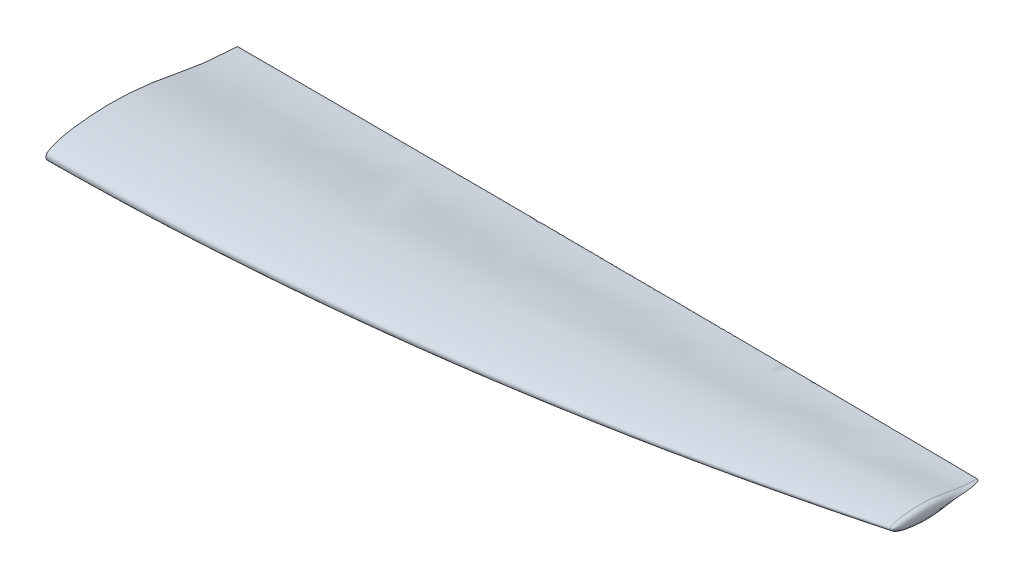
ISO-10303-21;
HEADER;
FILE_DESCRIPTION(('STEP AP214'),'2;1');
FILE_NAME('part.step','',(''),(''),'','','');
FILE_SCHEMA(('AUTOMOTIVE_DESIGN { 1 0 10303 214 1 1 1 1 }'));
ENDSEC;
DATA;
#1=APPLICATION_CONTEXT('core data for automotive mechanical design processes');
#2=APPLICATION_PROTOCOL_DEFINITION('international standard','automotive_design',2000,#1);
#3=PRODUCT_CONTEXT('',#1,'mechanical');
#4=PRODUCT('Part','Part','',(#3));
#5=PRODUCT_RELATED_PRODUCT_CATEGORY('part','',(#4));
#6=PRODUCT_DEFINITION_FORMATION('','',#4);
#7=PRODUCT_DEFINITION_CONTEXT('part definition',#1,'design');
#8=PRODUCT_DEFINITION('design','',#6,#7);
#9=PRODUCT_DEFINITION_SHAPE('','',#8);
#10=(LENGTH_UNIT() NAMED_UNIT(*) SI_UNIT(.MILLI.,.METRE.));
#11=(NAMED_UNIT(*) PLANE_ANGLE_UNIT() SI_UNIT($,.RADIAN.));
#12=(NAMED_UNIT(*) SI_UNIT($,.STERADIAN.) SOLID_ANGLE_UNIT());
#13=UNCERTAINTY_MEASURE_WITH_UNIT(LENGTH_MEASURE(1.E-05),#10,'distance_accuracy_value','');
#14=(GEOMETRIC_REPRESENTATION_CONTEXT(3) GLOBAL_UNCERTAINTY_ASSIGNED_CONTEXT((#13)) GLOBAL_UNIT_ASSIGNED_CONTEXT((#10,
#11,#12)) REPRESENTATION_CONTEXT('',''));
#15=CARTESIAN_POINT('',(0.,0.,0.));
#16=DIRECTION('',(0.,0.,1.));
#17=DIRECTION('',(1.,0.,0.));
#18=AXIS2_PLACEMENT_3D('',#15,#16,#17);
#19=CARTESIAN_POINT('',(-1425.,-9.80039770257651E-07,8.50000000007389));
#20=CARTESIAN_POINT('',(-950.,0.,133.633333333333));
#21=CARTESIAN_POINT('',(0.,0.,258.766666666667));
#22=CARTESIAN_POINT('',(950.,0.,133.633333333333));
#23=CARTESIAN_POINT('',(1425.,-9.80039770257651E-07,8.50000000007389));
#24=CARTESIAN_POINT('',(-1425.,-0.111029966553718,8.5000083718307));
#25=CARTESIAN_POINT('',(-950.,-0.177646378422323,133.633346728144));
#26=CARTESIAN_POINT('',(0.,-0.310881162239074,258.766690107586));
#27=CARTESIAN_POINT('',(950.,-0.177646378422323,133.633346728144));
#28=CARTESIAN_POINT('',(1425.,-0.111029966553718,8.5000083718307));
#29=CARTESIAN_POINT('',(-1425.,-0.333135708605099,8.49414561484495));
#30=CARTESIAN_POINT('',(-950.,-0.5330604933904,133.623533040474));
#31=CARTESIAN_POINT('',(0.,-0.932647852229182,258.750970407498));
#32=CARTESIAN_POINT('',(950.,-0.5330604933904,133.623533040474));
#33=CARTESIAN_POINT('',(1425.,-0.333135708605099,8.49414561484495));
#34=CARTESIAN_POINT('',(-1425.,-0.665100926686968,8.46541134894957));
#35=CARTESIAN_POINT('',(-950.,-1.06451883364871,133.575214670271));
#36=CARTESIAN_POINT('',(0.,-1.86190985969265,258.672418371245));
#37=CARTESIAN_POINT('',(950.,-1.06451883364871,133.575214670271));
#38=CARTESIAN_POINT('',(1425.,-0.665100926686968,8.46541134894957));
#39=CARTESIAN_POINT('',(-1425.,-0.994541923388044,8.41443532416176));
#40=CARTESIAN_POINT('',(-950.,-1.59211271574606,133.490027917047));
#41=CARTESIAN_POINT('',(0.,-2.7838468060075,258.533638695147));
#42=CARTESIAN_POINT('',(950.,-1.59211271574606,133.490027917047));
#43=CARTESIAN_POINT('',(1425.,-0.994541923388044,8.41443532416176));
#44=CARTESIAN_POINT('',(-1425.,-1.31937134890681,8.34002502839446));
#45=CARTESIAN_POINT('',(-950.,-2.11249800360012,133.365731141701));
#46=CARTESIAN_POINT('',(0.,-3.69260717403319,258.330244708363));
#47=CARTESIAN_POINT('',(950.,-2.11249800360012,133.365731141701));
#48=CARTESIAN_POINT('',(1425.,-1.31937134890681,8.34002502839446));
#49=CARTESIAN_POINT('',(-1425.,-1.63731168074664,8.23922883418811));
#50=CARTESIAN_POINT('',(-950.000000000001,-2.62215874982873,133.197920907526));
#51=CARTESIAN_POINT('',(0.,-4.58220435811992,258.054882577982));
#52=CARTESIAN_POINT('',(950.000000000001,-2.62215874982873,133.197920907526));
#53=CARTESIAN_POINT('',(1425.,-1.63731168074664,8.23922883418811));
#54=CARTESIAN_POINT('',(-1425.,-1.94430403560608,8.10949071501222));
#55=CARTESIAN_POINT('',(-950.,-3.11431913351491,132.98219435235));
#56=CARTESIAN_POINT('',(0.,-5.44043485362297,257.699408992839));
#57=CARTESIAN_POINT('',(950.,-3.11431913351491,132.98219435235));
#58=CARTESIAN_POINT('',(1425.,-1.94430403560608,8.10949071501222));
#59=CARTESIAN_POINT('',(-1425.,-2.23584812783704,7.94609487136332));
#60=CARTESIAN_POINT('',(-949.999999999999,-3.58201138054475,132.711249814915));
#61=CARTESIAN_POINT('',(0.,-6.25540210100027,257.251303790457));
#62=CARTESIAN_POINT('',(949.999999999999,-3.58201138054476,132.711249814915));
#63=CARTESIAN_POINT('',(1425.,-2.23584812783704,7.94609487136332));
#64=CARTESIAN_POINT('',(-1425.,-2.49392081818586,7.73348986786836));
#65=CARTESIAN_POINT('',(-950.,-3.99644845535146,132.360268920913));
#66=CARTESIAN_POINT('',(0.,-6.97679746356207,256.667167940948));
#67=CARTESIAN_POINT('',(950.,-3.99644845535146,132.360268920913));
#68=CARTESIAN_POINT('',(1425.,-2.49392081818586,7.73348986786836));
#69=CARTESIAN_POINT('',(-1425.,-2.7173142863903,7.48586045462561));
#70=CARTESIAN_POINT('',(-950.000000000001,-4.35547716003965,131.951722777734));
#71=CARTESIAN_POINT('',(0.,-7.60058317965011,255.985998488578));
#72=CARTESIAN_POINT('',(950.000000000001,-4.35547716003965,131.951722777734));
#73=CARTESIAN_POINT('',(1425.,-2.7173142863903,7.48586045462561));
#74=CARTESIAN_POINT('',(-1425.,-2.93453738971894,7.23353747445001));
#75=CARTESIAN_POINT('',(-949.999999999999,-4.70488006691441,131.534359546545));
#76=CARTESIAN_POINT('',(0.,-8.20709544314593,255.293331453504));
#77=CARTESIAN_POINT('',(949.999999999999,-4.70488006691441,131.534359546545));
#78=CARTESIAN_POINT('',(1425.,-2.93453738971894,7.23353747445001));
#79=CARTESIAN_POINT('',(-1425.,-3.14464741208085,6.97491690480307));
#80=CARTESIAN_POINT('',(-950.000000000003,-5.0430292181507,131.105461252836));
#81=CARTESIAN_POINT('',(0.,-8.7933420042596,254.584174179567));
#82=CARTESIAN_POINT('',(950.000000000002,-5.04302921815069,131.105461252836));
#83=CARTESIAN_POINT('',(1425.,-3.14464741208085,6.97491690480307));
#84=CARTESIAN_POINT('',(-1425.,-3.34822860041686,6.7113137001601));
#85=CARTESIAN_POINT('',(-949.999999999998,-5.3709506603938,130.667274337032));
#86=CARTESIAN_POINT('',(0.,-9.36123870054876,253.862589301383));
#87=CARTESIAN_POINT('',(949.999999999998,-5.3709506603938,130.667274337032));
#88=CARTESIAN_POINT('',(1425.,-3.34822860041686,6.7113137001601));
#89=CARTESIAN_POINT('',(-1425.,-3.54494917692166,6.44245354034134));
#90=CARTESIAN_POINT('',(-950.000000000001,-5.68804749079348,130.219283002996));
#91=CARTESIAN_POINT('',(0.,-9.90966457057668,253.127531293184));
#92=CARTESIAN_POINT('',(950.000000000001,-5.68804749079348,130.219283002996));
#93=CARTESIAN_POINT('',(1425.,-3.54494917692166,6.44245354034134));
#94=CARTESIAN_POINT('',(-1425.,-3.73497713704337,6.1688721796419));
#95=CARTESIAN_POINT('',(-950.000000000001,-5.99463999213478,129.762426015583));
#96=CARTESIAN_POINT('',(0.,-10.4392506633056,252.380698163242));
#97=CARTESIAN_POINT('',(950.000000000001,-5.99463999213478,129.762426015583));
#98=CARTESIAN_POINT('',(1425.,-3.73497713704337,6.1688721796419));
#99=CARTESIAN_POINT('',(-1425.,-3.91826698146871,5.890716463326));
#100=CARTESIAN_POINT('',(-950.,-6.29059387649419,129.296877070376));
#101=CARTESIAN_POINT('',(0.,-10.949691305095,251.622270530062));
#102=CARTESIAN_POINT('',(950.,-6.29059387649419,129.296877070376));
#103=CARTESIAN_POINT('',(1425.,-3.91826698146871,5.890716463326));
#104=CARTESIAN_POINT('',(-1425.,-4.15371016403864,5.51409150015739));
#105=CARTESIAN_POINT('',(-950.,-6.67117359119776,128.665245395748));
#106=CARTESIAN_POINT('',(0.,-11.6051561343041,250.596883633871));
#107=CARTESIAN_POINT('',(950.,-6.67117359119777,128.665245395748));
#108=CARTESIAN_POINT('',(1425.,-4.15371016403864,5.51409150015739));
#109=CARTESIAN_POINT('',(-1425.,-4.43132214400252,5.03318115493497));
#110=CARTESIAN_POINT('',(-950.000000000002,-7.12056834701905,127.856156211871));
#111=CARTESIAN_POINT('',(0.,-12.3771478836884,249.289857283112));
#112=CARTESIAN_POINT('',(950.000000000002,-7.12056834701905,127.856156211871));
#113=CARTESIAN_POINT('',(1425.,-4.43132214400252,5.03318115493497));
#114=CARTESIAN_POINT('',(-1425.,-4.74003257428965,4.44270479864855));
#115=CARTESIAN_POINT('',(-949.999999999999,-7.62151207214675,126.858745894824));
#116=CARTESIAN_POINT('',(0.,-13.2346716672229,247.689265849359));
#117=CARTESIAN_POINT('',(949.999999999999,-7.62151207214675,126.858745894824));
#118=CARTESIAN_POINT('',(1425.,-4.74003257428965,4.44270479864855));
#119=CARTESIAN_POINT('',(-1425.,-5.02732545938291,3.84155203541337));
#120=CARTESIAN_POINT('',(-950.000000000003,-8.08877335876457,125.839153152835));
#121=CARTESIAN_POINT('',(0.,-14.0313084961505,246.063687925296));
#122=CARTESIAN_POINT('',(950.000000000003,-8.08877335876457,125.839153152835));
#123=CARTESIAN_POINT('',(1425.,-5.02732545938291,3.84155203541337));
#124=CARTESIAN_POINT('',(-1425.,-5.29597187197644,3.23187703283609));
#125=CARTESIAN_POINT('',(-949.999999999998,-8.52698684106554,124.801025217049));
#126=CARTESIAN_POINT('',(0.,-14.7754696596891,244.419382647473));
#127=CARTESIAN_POINT('',(949.999999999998,-8.52698684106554,124.801025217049));
#128=CARTESIAN_POINT('',(1425.,-5.29597187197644,3.23187703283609));
#129=CARTESIAN_POINT('',(-1425.,-5.54953044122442,2.61578906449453));
#130=CARTESIAN_POINT('',(-950.000000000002,-8.94147428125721,123.747680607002));
#131=CARTESIAN_POINT('',(0.,-15.4760527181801,242.76171280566));
#132=CARTESIAN_POINT('',(950.000000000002,-8.94147428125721,123.747680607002));
#133=CARTESIAN_POINT('',(1425.,-5.54953044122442,2.61578906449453));
#134=CARTESIAN_POINT('',(-1425.,-5.7904568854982,1.99467966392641));
#135=CARTESIAN_POINT('',(-949.999999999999,-9.33676912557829,122.681678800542));
#136=CARTESIAN_POINT('',(0.,-16.1417961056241,241.095199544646));
#137=CARTESIAN_POINT('',(949.999999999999,-9.3367691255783,122.681678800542));
#138=CARTESIAN_POINT('',(1425.,-5.7904568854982,1.99467966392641));
#139=CARTESIAN_POINT('',(-1425.,-6.02322044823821,1.37047655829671));
#140=CARTESIAN_POINT('',(-950.,-9.71904856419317,121.60583143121));
#141=CARTESIAN_POINT('',(0.,-16.7823424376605,239.424048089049));
#142=CARTESIAN_POINT('',(950.,-9.71904856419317,121.60583143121));
#143=CARTESIAN_POINT('',(1425.,-6.02322044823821,1.37047655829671));
#144=CARTESIAN_POINT('',(-1425.,-6.24845380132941,0.743511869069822));
#145=CARTESIAN_POINT('',(-950.000000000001,-10.090507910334,120.521217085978));
#146=CARTESIAN_POINT('',(0.,-17.403061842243,237.75045573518));
#147=CARTESIAN_POINT('',(950.000000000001,-10.090507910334,120.521217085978));
#148=CARTESIAN_POINT('',(1425.,-6.24845380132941,0.743511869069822));
#149=CARTESIAN_POINT('',(-1425.,-6.46678961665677,0.114117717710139));
#150=CARTESIAN_POINT('',(-950.000000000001,-10.4511715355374,119.42809074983));
#151=CARTESIAN_POINT('',(0.,-18.0028116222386,236.074148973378));
#152=CARTESIAN_POINT('',(950.000000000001,-10.4511715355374,119.42809074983));
#153=CARTESIAN_POINT('',(1425.,-6.46678961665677,0.114117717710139));
#154=CARTESIAN_POINT('',(-1425.,-6.74870259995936,-0.728208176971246));
#155=CARTESIAN_POINT('',(-950.,-10.9181048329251,117.959711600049));
#156=CARTESIAN_POINT('',(0.,-18.7759222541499,233.836159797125));
#157=CARTESIAN_POINT('',(949.999999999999,-10.9181048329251,117.959711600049));
#158=CARTESIAN_POINT('',(1425.,-6.74870259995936,-0.728208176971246));
#159=CARTESIAN_POINT('',(-1425.,-7.08383228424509,-1.78679323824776));
#160=CARTESIAN_POINT('',(-950.,-11.4757958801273,116.104473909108));
#161=CARTESIAN_POINT('',(0.,-19.693210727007,231.033772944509));
#162=CARTESIAN_POINT('',(950.,-11.4757958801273,116.104473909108));
#163=CARTESIAN_POINT('',(1425.,-7.08383228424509,-1.78679323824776));
#164=CARTESIAN_POINT('',(-1425.,-7.46020354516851,-3.06495063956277));
#165=CARTESIAN_POINT('',(-950.000000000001,-12.1057629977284,113.849085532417));
#166=CARTESIAN_POINT('',(0.,-20.7190215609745,227.665172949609));
#167=CARTESIAN_POINT('',(950.000000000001,-12.1057629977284,113.849085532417));
#168=CARTESIAN_POINT('',(1425.,-7.46020354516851,-3.06495063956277));
#169=CARTESIAN_POINT('',(-1425.,-7.8118186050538,-4.35014008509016));
#170=CARTESIAN_POINT('',(-950.,-12.6982968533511,111.56676448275));
#171=CARTESIAN_POINT('',(0.,-21.6737236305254,224.292708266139));
#172=CARTESIAN_POINT('',(949.999999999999,-12.6982968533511,111.56676448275));
#173=CARTESIAN_POINT('',(1425.,-7.8118186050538,-4.35014008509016));
#174=CARTESIAN_POINT('',(-1425.,-8.14019857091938,-5.64144783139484));
#175=CARTESIAN_POINT('',(-950.000000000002,-13.2555888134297,109.259666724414));
#176=CARTESIAN_POINT('',(0.,-22.5612450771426,220.918025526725));
#177=CARTESIAN_POINT('',(950.000000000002,-13.2555888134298,109.259666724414));
#178=CARTESIAN_POINT('',(1425.,-8.14019857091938,-5.64144783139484));
#179=CARTESIAN_POINT('',(-1425.,-8.44668053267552,-6.93812434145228));
#180=CARTESIAN_POINT('',(-949.999999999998,-13.7797489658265,106.929767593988));
#181=CARTESIAN_POINT('',(0.,-23.3856382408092,217.542557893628));
#182=CARTESIAN_POINT('',(949.999999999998,-13.7797489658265,106.929767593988));
#183=CARTESIAN_POINT('',(1425.,-8.44668053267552,-6.93812434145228));
#184=CARTESIAN_POINT('',(-1425.00000000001,-8.73273899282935,-8.23944986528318));
#185=CARTESIAN_POINT('',(-950.000000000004,-14.2730033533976,104.57895327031));
#186=CARTESIAN_POINT('',(0.,-24.151028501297,214.167530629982));
#187=CARTESIAN_POINT('',(950.000000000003,-14.2730033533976,104.57895327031));
#188=CARTESIAN_POINT('',(1425.00000000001,-8.73273899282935,-8.23944986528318));
#189=CARTESIAN_POINT('',(-1425.,-8.99981251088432,-9.54480065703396));
#190=CARTESIAN_POINT('',(-949.999999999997,-14.7375704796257,102.208977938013));
#191=CARTESIAN_POINT('',(0.,-24.8615905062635,210.793965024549));
#192=CARTESIAN_POINT('',(949.999999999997,-14.7375704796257,102.208977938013));
#193=CARTESIAN_POINT('',(1425.,-8.99981251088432,-9.54480065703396));
#194=CARTESIAN_POINT('',(-1425.,-9.24937683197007,-10.8536032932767));
#195=CARTESIAN_POINT('',(-950.000000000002,-15.1757079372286,99.8215025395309));
#196=CARTESIAN_POINT('',(0.,-25.5215417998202,207.422703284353));
#197=CARTESIAN_POINT('',(950.000000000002,-15.1757079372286,99.8215025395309));
#198=CARTESIAN_POINT('',(1425.,-9.24937683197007,-10.8536032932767));
#199=CARTESIAN_POINT('',(-1425.,-9.48290649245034,-12.1653618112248));
#200=CARTESIAN_POINT('',(-949.999999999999,-15.5896715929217,97.4180730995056));
#201=CARTESIAN_POINT('',(0.,-26.135097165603,204.054397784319));
#202=CARTESIAN_POINT('',(949.999999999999,-15.5896715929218,97.4180730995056));
#203=CARTESIAN_POINT('',(1425.,-9.48290649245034,-12.1653618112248));
#204=CARTESIAN_POINT('',(-1425.,-9.70187419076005,-13.4796183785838));
#205=CARTESIAN_POINT('',(-950.,-15.981730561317,95.0001669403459));
#206=CARTESIAN_POINT('',(0.,-26.7065148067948,200.689571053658));
#207=CARTESIAN_POINT('',(950.,-15.9817305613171,95.0001669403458));
#208=CARTESIAN_POINT('',(1425.,-9.70187419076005,-13.4796183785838));
#209=CARTESIAN_POINT('',(-1425.,-9.97638860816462,-15.2347889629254));
#210=CARTESIAN_POINT('',(-950.000000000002,-16.4782748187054,91.7587999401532));
#211=CARTESIAN_POINT('',(0.,-27.417818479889,196.208208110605));
#212=CARTESIAN_POINT('',(950.000000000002,-16.4782748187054,91.7587999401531));
#213=CARTESIAN_POINT('',(1425.,-9.97638860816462,-15.2347889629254));
#214=CARTESIAN_POINT('',(-1425.,-10.2905271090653,-17.4331139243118));
#215=CARTESIAN_POINT('',(-949.999999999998,-17.0555274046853,87.6776491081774));
#216=CARTESIAN_POINT('',(0.,-28.2227862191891,190.616714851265));
#217=CARTESIAN_POINT('',(949.999999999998,-17.0555274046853,87.6776491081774));
#218=CARTESIAN_POINT('',(1425.,-10.2905271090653,-17.4331139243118));
#219=CARTESIAN_POINT('',(-1425.,-10.6327936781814,-20.0758119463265));
#220=CARTESIAN_POINT('',(-950.000000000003,-17.6966692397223,82.7428034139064));
#221=CARTESIAN_POINT('',(0.,-29.0876127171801,183.923695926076));
#222=CARTESIAN_POINT('',(950.000000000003,-17.6966692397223,82.7428034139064));
#223=CARTESIAN_POINT('',(1425.,-10.6327936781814,-20.0758119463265));
#224=CARTESIAN_POINT('',(-1425.,-10.9408498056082,-22.722719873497));
#225=CARTESIAN_POINT('',(-949.999999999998,-18.2862469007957,77.7772689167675));
#226=CARTESIAN_POINT('',(0.,-29.8534873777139,177.242831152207));
#227=CARTESIAN_POINT('',(949.999999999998,-18.2862469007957,77.7772689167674));
#228=CARTESIAN_POINT('',(1425.,-10.9408498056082,-22.722719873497));
#229=CARTESIAN_POINT('',(-1425.,-11.2153084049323,-25.3733170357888));
#230=CARTESIAN_POINT('',(-950.000000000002,-18.824444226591,72.7878705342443));
#231=CARTESIAN_POINT('',(0.,-30.5229059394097,170.569603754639));
#232=CARTESIAN_POINT('',(950.000000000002,-18.8244442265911,72.7878705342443));
#233=CARTESIAN_POINT('',(1425.,-11.2153084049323,-25.3733170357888));
#234=CARTESIAN_POINT('',(-1425.,-11.4567752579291,-28.0271225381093));
#235=CARTESIAN_POINT('',(-949.999999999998,-19.3114415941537,67.7813627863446));
#236=CARTESIAN_POINT('',(0.,-31.0983680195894,163.899365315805));
#237=CARTESIAN_POINT('',(949.999999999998,-19.3114415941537,67.7813627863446));
#238=CARTESIAN_POINT('',(1425.,-11.4567752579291,-28.0271225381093));
#239=CARTESIAN_POINT('',(-1425.,-11.6658960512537,-30.6836696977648));
#240=CARTESIAN_POINT('',(-950.000000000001,-19.74747516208,62.7644815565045));
#241=CARTESIAN_POINT('',(0.,-31.5824607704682,157.227439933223));
#242=CARTESIAN_POINT('',(950.000000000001,-19.7474751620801,62.7644815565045));
#243=CARTESIAN_POINT('',(1425.,-11.6658960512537,-30.6836696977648));
#244=CARTESIAN_POINT('',(-1425.,-11.8433413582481,-33.3425185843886));
#245=CARTESIAN_POINT('',(-950.,-20.1328324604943,57.7439168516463));
#246=CARTESIAN_POINT('',(0.,-31.9778756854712,150.549067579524));
#247=CARTESIAN_POINT('',(950.,-20.1328324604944,57.7439168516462));
#248=CARTESIAN_POINT('',(1425.,-11.8433413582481,-33.3425185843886));
#249=CARTESIAN_POINT('',(-1425.,-11.9897870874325,-36.0032523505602));
#250=CARTESIAN_POINT('',(-949.999999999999,-20.4677889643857,52.7263240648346));
#251=CARTESIAN_POINT('',(0.,-32.2872574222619,143.859430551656));
#252=CARTESIAN_POINT('',(949.999999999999,-20.4677889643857,52.7263240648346));
#253=CARTESIAN_POINT('',(1425.,-11.9897870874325,-36.0032523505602));
#254=CARTESIAN_POINT('',(-1425.,-12.105966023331,-38.6654762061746));
#255=CARTESIAN_POINT('',(-950.000000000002,-20.7527504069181,47.7183208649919));
#256=CARTESIAN_POINT('',(0.,-32.5135276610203,137.153642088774));
#257=CARTESIAN_POINT('',(950.000000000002,-20.7527504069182,47.7183208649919));
#258=CARTESIAN_POINT('',(1425.,-12.105966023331,-38.6654762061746));
#259=CARTESIAN_POINT('',(-1425.,-12.192511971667,-41.3288299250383));
#260=CARTESIAN_POINT('',(-949.999999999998,-20.9878941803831,42.7264765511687));
#261=CARTESIAN_POINT('',(0.,-32.6591210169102,130.426739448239));
#262=CARTESIAN_POINT('',(949.999999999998,-20.9878941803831,42.7264765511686));
#263=CARTESIAN_POINT('',(1425.,-12.192511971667,-41.3288299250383));
#264=CARTESIAN_POINT('',(-1425.,-12.2490571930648,-43.99298952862));
#265=CARTESIAN_POINT('',(-950.,-21.1719019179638,37.7572873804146));
#266=CARTESIAN_POINT('',(0.,-32.723987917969,123.673613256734));
#267=CARTESIAN_POINT('',(950.,-21.1719019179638,37.7572873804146));
#268=CARTESIAN_POINT('',(1425.,-12.2490571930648,-43.99298952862));
#269=CARTESIAN_POINT('',(-1425.,-12.284109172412,-47.5458277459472));
#270=CARTESIAN_POINT('',(-950.000000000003,-21.347374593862,31.1706250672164));
#271=CARTESIAN_POINT('',(0.,-32.7026811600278,114.627797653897));
#272=CARTESIAN_POINT('',(950.000000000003,-21.347374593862,31.1706250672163));
#273=CARTESIAN_POINT('',(1425.,-12.284109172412,-47.5458277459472));
#274=CARTESIAN_POINT('',(-1425.,-12.2516447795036,-51.9872061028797));
#275=CARTESIAN_POINT('',(-949.999999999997,-21.4328121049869,23.0265755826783));
#276=CARTESIAN_POINT('',(0.,-32.4744471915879,103.229771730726));
#277=CARTESIAN_POINT('',(949.999999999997,-21.4328121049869,23.0265755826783));
#278=CARTESIAN_POINT('',(1425.,-12.2516447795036,-51.9872061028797));
#279=CARTESIAN_POINT('',(-1425.,-12.088068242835,-57.314492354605));
#280=CARTESIAN_POINT('',(-950.000000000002,-21.3105648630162,13.4491105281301));
#281=CARTESIAN_POINT('',(0.,-31.8769297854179,89.36718205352));
#282=CARTESIAN_POINT('',(950.000000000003,-21.3105648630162,13.4491105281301));
#283=CARTESIAN_POINT('',(1425.,-12.088068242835,-57.314492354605));
#284=CARTESIAN_POINT('',(-1425.,-11.7979058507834,-62.6364201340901));
#285=CARTESIAN_POINT('',(-949.999999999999,-20.9540916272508,4.11971706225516));
#286=CARTESIAN_POINT('',(0.,-30.9567080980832,75.2800827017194));
#287=CARTESIAN_POINT('',(949.999999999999,-20.9540916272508,4.11971706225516));
#288=CARTESIAN_POINT('',(1425.,-11.7979058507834,-62.6364201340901));
#289=CARTESIAN_POINT('',(-1425.,-11.3777600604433,-67.949649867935));
#290=CARTESIAN_POINT('',(-950.000000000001,-20.3515939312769,-4.90835261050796));
#291=CARTESIAN_POINT('',(0.,-29.710542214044,60.9299496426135));
#292=CARTESIAN_POINT('',(950.000000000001,-20.3515939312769,-4.90835261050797));
#293=CARTESIAN_POINT('',(1425.,-11.3777600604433,-67.949649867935));
#294=CARTESIAN_POINT('',(-1425.,-11.0180866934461,-71.4845506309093));
#295=CARTESIAN_POINT('',(-950.,-19.7930268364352,-10.6919303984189));
#296=CARTESIAN_POINT('',(0.,-28.6865599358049,51.1599551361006));
#297=CARTESIAN_POINT('',(950.,-19.7930268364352,-10.6919303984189));
#298=CARTESIAN_POINT('',(1425.,-11.0180866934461,-71.4845506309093));
#299=CARTESIAN_POINT('',(-1425.,-10.6290811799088,-74.9591249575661));
#300=CARTESIAN_POINT('',(-950.,-19.1706180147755,-16.2512493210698));
#301=CARTESIAN_POINT('',(0.,-27.5973444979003,41.4311470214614));
#302=CARTESIAN_POINT('',(950.,-19.1706180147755,-16.2512493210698));
#303=CARTESIAN_POINT('',(1425.,-10.6290811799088,-74.9591249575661));
#304=CARTESIAN_POINT('',(-1425.,-10.2128694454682,-78.373603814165));
#305=CARTESIAN_POINT('',(-950.000000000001,-18.4877560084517,-21.842148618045));
#306=CARTESIAN_POINT('',(0.,-26.4488096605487,31.9983445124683));
#307=CARTESIAN_POINT('',(950.000000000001,-18.4877560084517,-21.842148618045));
#308=CARTESIAN_POINT('',(1425.,-10.2128694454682,-78.373603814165));
#309=CARTESIAN_POINT('',(-1425.,-9.49901669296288,-83.4835682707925));
#310=CARTESIAN_POINT('',(-949.999999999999,-17.2758857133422,-30.5450022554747));
#311=CARTESIAN_POINT('',(0.,-24.5198685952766,18.2173303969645));
#312=CARTESIAN_POINT('',(949.999999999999,-17.2758857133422,-30.5450022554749));
#313=CARTESIAN_POINT('',(1425.,-9.49901669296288,-83.4835682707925));
#314=CARTESIAN_POINT('',(-1425.,-8.70545438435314,-88.5817202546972));
#315=CARTESIAN_POINT('',(-950.000000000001,-15.8983609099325,-39.5163458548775));
#316=CARTESIAN_POINT('',(0.,-22.4055454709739,4.75683120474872));
#317=CARTESIAN_POINT('',(950.000000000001,-15.8983609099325,-39.5163458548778));
#318=CARTESIAN_POINT('',(1425.,-8.70545438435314,-88.5817202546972));
#319=CARTESIAN_POINT('',(-1425.,-7.98878391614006,-92.8211463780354));
#320=CARTESIAN_POINT('',(-949.999999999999,-14.6354809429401,-47.1776057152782));
#321=CARTESIAN_POINT('',(0.,-20.5151870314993,-6.23539965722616));
#322=CARTESIAN_POINT('',(949.999999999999,-14.6354809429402,-47.1776057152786));
#323=CARTESIAN_POINT('',(1425.,-7.98878391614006,-92.8211463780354));
#324=CARTESIAN_POINT('',(-1425.,-7.39237737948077,-96.2086514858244));
#325=CARTESIAN_POINT('',(-950.,-13.5755547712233,-53.3959534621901));
#326=CARTESIAN_POINT('',(0.,-18.9508947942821,-14.9220722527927));
#327=CARTESIAN_POINT('',(950.,-13.5755547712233,-53.3959534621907));
#328=CARTESIAN_POINT('',(1425.,-7.39237737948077,-96.2086514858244));
#329=CARTESIAN_POINT('',(-1425.,-6.93559673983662,-98.747599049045));
#330=CARTESIAN_POINT('',(-950.000000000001,-12.759908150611,-58.0989381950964));
#331=CARTESIAN_POINT('',(0.,-17.7567114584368,-21.3904595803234));
#332=CARTESIAN_POINT('',(950.000000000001,-12.759908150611,-58.0989381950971));
#333=CARTESIAN_POINT('',(1425.,-6.93559673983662,-98.747599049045));
#334=CARTESIAN_POINT('',(-1425.,-6.47184964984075,-101.285277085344));
#335=CARTESIAN_POINT('',(-949.999999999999,-11.9283651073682,-62.8358179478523));
#336=CARTESIAN_POINT('',(0.,-16.5477920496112,-27.8193698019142));
#337=CARTESIAN_POINT('',(949.999999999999,-11.9283651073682,-62.8358179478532));
#338=CARTESIAN_POINT('',(1425.,-6.47184964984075,-101.285277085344));
#339=CARTESIAN_POINT('',(-1425.,-6.00343974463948,-103.822100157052));
#340=CARTESIAN_POINT('',(-950.000000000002,-11.0853835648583,-67.6012648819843));
#341=CARTESIAN_POINT('',(0.,-15.3297330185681,-34.2159404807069));
#342=CARTESIAN_POINT('',(950.000000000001,-11.0853835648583,-67.6012648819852));
#343=CARTESIAN_POINT('',(1425.,-6.00343974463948,-103.822100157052));
#344=CARTESIAN_POINT('',(-1425.,-5.53257447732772,-106.358466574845));
#345=CARTESIAN_POINT('',(-950.,-10.2353271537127,-72.3899356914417));
#346=CARTESIAN_POINT('',(0.,-14.1080403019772,-40.5872952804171));
#347=CARTESIAN_POINT('',(950.,-10.2353271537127,-72.3899356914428));
#348=CARTESIAN_POINT('',(1425.,-5.53257447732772,-106.358466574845));
#349=CARTESIAN_POINT('',(-1425.,-5.06189780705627,-108.894868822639));
#350=CARTESIAN_POINT('',(-949.999999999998,-9.38315458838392,-77.196618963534));
#351=CARTESIAN_POINT('',(0.,-12.8891320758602,-46.9407651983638));
#352=CARTESIAN_POINT('',(949.999999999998,-9.38315458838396,-77.1966189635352));
#353=CARTESIAN_POINT('',(1425.,-5.06189780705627,-108.894868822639));
#354=CARTESIAN_POINT('',(-1425.,-4.59297639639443,-111.431595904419));
#355=CARTESIAN_POINT('',(-950.000000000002,-8.53227825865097,-82.0158108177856));
#356=CARTESIAN_POINT('',(0.,-11.6769421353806,-53.2832107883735));
#357=CARTESIAN_POINT('',(950.000000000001,-8.53227825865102,-82.0158108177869));
#358=CARTESIAN_POINT('',(1425.,-4.59297639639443,-111.431595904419));
#359=CARTESIAN_POINT('',(-1425.,-4.13046772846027,-113.969505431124));
#360=CARTESIAN_POINT('',(-949.999999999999,-7.69077065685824,-86.8428632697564));
#361=CARTESIAN_POINT('',(0.,-10.4832029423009,-59.6229230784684));
#362=CARTESIAN_POINT('',(949.999999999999,-7.69077065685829,-86.8428632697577));
#363=CARTESIAN_POINT('',(1425.,-4.13046772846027,-113.969505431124));
#364=CARTESIAN_POINT('',(-1425.,-3.68453642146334,-116.51039783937));
#365=CARTESIAN_POINT('',(-950.000000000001,-6.8758689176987,-91.674705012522));
#366=CARTESIAN_POINT('',(0.,-9.33612661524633,-65.9710374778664));
#367=CARTESIAN_POINT('',(950.000000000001,-6.87586891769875,-91.6747050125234));
#368=CARTESIAN_POINT('',(1425.,-3.68453642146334,-116.51039783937));
#369=CARTESIAN_POINT('',(-1425.,-3.26423985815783,-119.055677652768));
#370=CARTESIAN_POINT('',(-949.999999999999,-6.10273903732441,-96.507570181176));
#371=CARTESIAN_POINT('',(0.,-8.25992632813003,-72.3373975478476));
#372=CARTESIAN_POINT('',(949.999999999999,-6.10273903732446,-96.5075701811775));
#373=CARTESIAN_POINT('',(1425.,-3.26423985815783,-119.055677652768));
#374=CARTESIAN_POINT('',(-1425.,-2.8798676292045,-121.606676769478));
#375=CARTESIAN_POINT('',(-950.,-5.38866738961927,-101.337612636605));
#376=CARTESIAN_POINT('',(0.,-7.28271197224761,-78.7317512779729));
#377=CARTESIAN_POINT('',(950.,-5.38866738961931,-101.337612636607));
#378=CARTESIAN_POINT('',(1425.,-2.8798676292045,-121.606676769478));
#379=CARTESIAN_POINT('',(-1425.,-2.59745471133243,-123.737886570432));
#380=CARTESIAN_POINT('',(-950.000000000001,-4.85626884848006,-105.35628675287));
#381=CARTESIAN_POINT('',(0.,-6.57263050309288,-84.0904166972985));
#382=CARTESIAN_POINT('',(950.000000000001,-4.85626884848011,-105.356286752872));
#383=CARTESIAN_POINT('',(1425.,-2.59745471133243,-123.737886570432));
#384=CARTESIAN_POINT('',(-1425.,-2.3921153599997,-125.445397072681));
#385=CARTESIAN_POINT('',(-950.,-4.46480222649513,-108.563308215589));
#386=CARTESIAN_POINT('',(0.,-6.06039989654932,-88.3964106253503));
#387=CARTESIAN_POINT('',(950.,-4.46480222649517,-108.56330821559));
#388=CARTESIAN_POINT('',(1425.,-2.3921153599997,-125.445397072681));
#389=CARTESIAN_POINT('',(-1425.,-2.24777345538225,-126.727156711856));
#390=CARTESIAN_POINT('',(-949.999999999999,-4.18762110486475,-110.963651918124));
#391=CARTESIAN_POINT('',(0.,-5.7025919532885,-91.6358293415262));
#392=CARTESIAN_POINT('',(949.999999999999,-4.1876211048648,-110.963651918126));
#393=CARTESIAN_POINT('',(1425.,-2.24777345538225,-126.727156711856));
#394=CARTESIAN_POINT('',(-1425.,-2.11246127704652,-128.009898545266));
#395=CARTESIAN_POINT('',(-949.999999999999,-3.92585681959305,-113.358077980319));
#396=CARTESIAN_POINT('',(0.,-5.36901250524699,-94.8854685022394));
#397=CARTESIAN_POINT('',(949.999999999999,-3.92585681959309,-113.358077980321));
#398=CARTESIAN_POINT('',(1425.,-2.11246127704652,-128.009898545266));
#399=CARTESIAN_POINT('',(-1425.,-1.98549216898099,-129.29349535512));
#400=CARTESIAN_POINT('',(-950.,-3.6785457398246,-115.745638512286));
#401=CARTESIAN_POINT('',(0.,-5.05774771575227,-98.1457326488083));
#402=CARTESIAN_POINT('',(950.,-3.67854573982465,-115.745638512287));
#403=CARTESIAN_POINT('',(1425.,-1.98549216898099,-129.29349535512));
#404=CARTESIAN_POINT('',(-1425.,-1.86617947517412,-130.577819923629));
#405=CARTESIAN_POINT('',(-950.000000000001,-3.44456747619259,-118.125377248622));
#406=CARTESIAN_POINT('',(0.,-4.7664134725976,-101.417001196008));
#407=CARTESIAN_POINT('',(950.000000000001,-3.44456747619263,-118.125377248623));
#408=CARTESIAN_POINT('',(1425.,-1.86617947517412,-130.577819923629));
#409=CARTESIAN_POINT('',(-1425.,-1.7536191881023,-131.862756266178));
#410=CARTESIAN_POINT('',(-950.000000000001,-3.22286843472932,-120.496378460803));
#411=CARTESIAN_POINT('',(0.,-4.49326075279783,-104.699752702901));
#412=CARTESIAN_POINT('',(950.000000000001,-3.22286843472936,-120.496378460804));
#413=CARTESIAN_POINT('',(1425.,-1.7536191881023,-131.862756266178));
#414=CARTESIAN_POINT('',(-1425.,-1.64690730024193,-133.14818839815));
#415=CARTESIAN_POINT('',(-950.,-3.01172542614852,-122.857679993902));
#416=CARTESIAN_POINT('',(0.,-4.23453174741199,-107.994326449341));
#417=CARTESIAN_POINT('',(950.,-3.01172542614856,-122.857679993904));
#418=CARTESIAN_POINT('',(1425.,-1.64690730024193,-133.14818839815));
#419=CARTESIAN_POINT('',(-1425.,-1.54429533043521,-134.433953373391));
#420=CARTESIAN_POINT('',(-950.,-2.8087660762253,-125.208298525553));
#421=CARTESIAN_POINT('',(0.,-3.98621003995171,-111.301092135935));
#422=CARTESIAN_POINT('',(950.,-2.80876607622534,-125.208298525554));
#423=CARTESIAN_POINT('',(1425.,-1.54429533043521,-134.433953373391));
#424=CARTESIAN_POINT('',(-1425.,-1.44473772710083,-135.719957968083));
#425=CARTESIAN_POINT('',(-950.000000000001,-2.61219690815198,-127.547318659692));
#426=CARTESIAN_POINT('',(0.,-3.74461004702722,-114.620483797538));
#427=CARTESIAN_POINT('',(950.000000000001,-2.61219690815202,-127.547318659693));
#428=CARTESIAN_POINT('',(1425.,-1.44473772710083,-135.719957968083));
#429=CARTESIAN_POINT('',(-1425.,-1.3468950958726,-137.006093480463));
#430=CARTESIAN_POINT('',(-949.999999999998,-2.42009959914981,-129.873828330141));
#431=CARTESIAN_POINT('',(0.,-3.50625933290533,-117.952976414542));
#432=CARTESIAN_POINT('',(949.999999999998,-2.42009959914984,-129.873828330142));
#433=CARTESIAN_POINT('',(1425.,-1.3468950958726,-137.006093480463));
#434=CARTESIAN_POINT('',(-1425.00000000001,-1.2494738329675,-138.292261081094));
#435=CARTESIAN_POINT('',(-950.000000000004,-2.23043783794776,-132.186915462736));
#436=CARTESIAN_POINT('',(0.,-3.26723991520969,-121.299025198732));
#437=CARTESIAN_POINT('',(950.000000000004,-2.2304378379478,-132.186915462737));
#438=CARTESIAN_POINT('',(1425.00000000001,-1.2494738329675,-138.292261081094));
#439=CARTESIAN_POINT('',(-1425.,-1.15112353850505,-139.578358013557));
#440=CARTESIAN_POINT('',(-949.999999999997,-2.04118045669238,-134.485669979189));
#441=CARTESIAN_POINT('',(0.,-3.02376283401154,-124.659099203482));
#442=CARTESIAN_POINT('',(949.999999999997,-2.04118045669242,-134.48566997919));
#443=CARTESIAN_POINT('',(1425.,-1.15112353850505,-139.578358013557));
#444=CARTESIAN_POINT('',(-1425.,-1.04983184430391,-140.864228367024));
#445=CARTESIAN_POINT('',(-950.000000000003,-1.84919893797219,-136.769092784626));
#446=CARTESIAN_POINT('',(0.,-2.77007101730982,-128.033506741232));
#447=CARTESIAN_POINT('',(950.000000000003,-1.84919893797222,-136.769092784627));
#448=CARTESIAN_POINT('',(1425.,-1.04983184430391,-140.864228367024));
#449=CARTESIAN_POINT('',(-1425.,-0.961783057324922,-141.935493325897));
#450=CARTESIAN_POINT('',(-949.999999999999,-1.68511696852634,-138.658377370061));
#451=CARTESIAN_POINT('',(0.,-2.54671265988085,-130.857788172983));
#452=CARTESIAN_POINT('',(949.999999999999,-1.68511696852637,-138.658377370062));
#453=CARTESIAN_POINT('',(1425.,-0.961783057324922,-141.935493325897));
#454=CARTESIAN_POINT('',(-1425.,-0.891614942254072,-142.79252707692));
#455=CARTESIAN_POINT('',(-950.,-1.55539441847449,-140.161607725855));
#456=CARTESIAN_POINT('',(0.,-2.36775440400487,-133.125509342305));
#457=CARTESIAN_POINT('',(950.,-1.55539441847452,-140.161607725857));
#458=CARTESIAN_POINT('',(1425.,-0.891614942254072,-142.79252707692));
#459=CARTESIAN_POINT('',(-1425.,-0.839616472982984,-143.435353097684));
#460=CARTESIAN_POINT('',(-950.000000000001,-1.45963112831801,-141.284900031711));
#461=CARTESIAN_POINT('',(0.,-2.23463740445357,-134.830647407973));
#462=CARTESIAN_POINT('',(950.000000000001,-1.45963112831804,-141.284900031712));
#463=CARTESIAN_POINT('',(1425.,-0.839616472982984,-143.435353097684));
#464=CARTESIAN_POINT('',(-1425.,-0.788737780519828,-144.078269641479));
#465=CARTESIAN_POINT('',(-950.,-1.3662694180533,-142.404035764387));
#466=CARTESIAN_POINT('',(0.,-2.10420711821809,-136.540348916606));
#467=CARTESIAN_POINT('',(950.,-1.36626941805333,-142.404035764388));
#468=CARTESIAN_POINT('',(1425.,-0.788737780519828,-144.078269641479));
#469=CARTESIAN_POINT('',(-1425.,-0.739373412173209,-144.721303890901));
#470=CARTESIAN_POINT('',(-950.,-1.27588225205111,-143.518961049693));
#471=CARTESIAN_POINT('',(0.,-1.97734381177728,-138.254772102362));
#472=CARTESIAN_POINT('',(950.,-1.27588225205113,-143.518961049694));
#473=CARTESIAN_POINT('',(1425.,-0.739373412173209,-144.721303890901));
#474=CARTESIAN_POINT('',(-1425.,-0.691759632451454,-145.364470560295));
#475=CARTESIAN_POINT('',(-950.,-1.18890887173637,-144.629608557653));
#476=CARTESIAN_POINT('',(0.,-1.85484314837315,-139.974059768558));
#477=CARTESIAN_POINT('',(950.,-1.18890887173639,-144.629608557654));
#478=CARTESIAN_POINT('',(1425.,-0.691759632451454,-145.364470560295));
#479=CARTESIAN_POINT('',(-1425.,-0.646046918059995,-146.007775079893));
#480=CARTESIAN_POINT('',(-950.000000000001,-1.10557364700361,-145.735891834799));
#481=CARTESIAN_POINT('',(0.,-1.73702775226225,-141.698315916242));
#482=CARTESIAN_POINT('',(950.000000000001,-1.10557364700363,-145.7358918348));
#483=CARTESIAN_POINT('',(1425.,-0.646046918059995,-146.007775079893));
#484=CARTESIAN_POINT('',(-1425.,-0.602281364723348,-146.651215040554));
#485=CARTESIAN_POINT('',(-950.,-1.025978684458,-146.837714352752));
#486=CARTESIAN_POINT('',(0.,-1.6240622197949,-143.42763000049));
#487=CARTESIAN_POINT('',(949.999999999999,-1.02597868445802,-146.837714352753));
#488=CARTESIAN_POINT('',(1425.,-0.602281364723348,-146.651215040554));
#489=CARTESIAN_POINT('',(-1425.,-0.56043655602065,-147.294782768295));
#490=CARTESIAN_POINT('',(-950.000000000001,-0.950085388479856,-147.934969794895));
#491=CARTESIAN_POINT('',(0.,-1.51583406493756,-145.16207264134));
#492=CARTESIAN_POINT('',(950.000000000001,-0.950085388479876,-147.934969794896));
#493=CARTESIAN_POINT('',(1425.,-0.56043655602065,-147.294782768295));
#494=CARTESIAN_POINT('',(-1425.,-0.520464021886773,-147.938469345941));
#495=CARTESIAN_POINT('',(-949.999999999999,-0.877833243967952,-149.027550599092));
#496=CARTESIAN_POINT('',(0.,-1.4122091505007,-146.901713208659));
#497=CARTESIAN_POINT('',(949.999999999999,-0.877833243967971,-149.027550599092));
#498=CARTESIAN_POINT('',(1425.,-0.520464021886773,-147.938469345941));
#499=CARTESIAN_POINT('',(-1425.,-0.482232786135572,-148.5822617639));
#500=CARTESIAN_POINT('',(-950.000000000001,-0.809022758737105,-150.115342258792));
#501=CARTESIAN_POINT('',(0.,-1.31280142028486,-148.646608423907));
#502=CARTESIAN_POINT('',(950.000000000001,-0.809022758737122,-150.115342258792));
#503=CARTESIAN_POINT('',(1425.,-0.482232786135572,-148.5822617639));
#504=CARTESIAN_POINT('',(-1425.,-0.445726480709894,-149.226154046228));
#505=CARTESIAN_POINT('',(-950.,-0.743640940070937,-151.198241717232));
#506=CARTESIAN_POINT('',(0.,-1.21755510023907,-150.396835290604));
#507=CARTESIAN_POINT('',(950.,-0.743640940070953,-151.198241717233));
#508=CARTESIAN_POINT('',(1425.,-0.445726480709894,-149.226154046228));
#509=CARTESIAN_POINT('',(-1425.,-0.410292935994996,-149.870105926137));
#510=CARTESIAN_POINT('',(-950.,-0.680657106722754,-152.276090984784));
#511=CARTESIAN_POINT('',(0.,-1.12463295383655,-152.152374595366));
#512=CARTESIAN_POINT('',(950.,-0.680657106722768,-152.276090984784));
#513=CARTESIAN_POINT('',(1425.,-0.410292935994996,-149.870105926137));
#514=CARTESIAN_POINT('',(-1425.,-0.381042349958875,-150.406747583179));
#515=CARTESIAN_POINT('',(-950.000000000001,-0.629191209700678,-153.169956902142));
#516=CARTESIAN_POINT('',(0.,-1.04739349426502,-153.619732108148));
#517=CARTESIAN_POINT('',(950.000000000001,-0.629191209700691,-153.169956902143));
#518=CARTESIAN_POINT('',(1425.,-0.381042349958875,-150.406747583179));
#519=CARTESIAN_POINT('',(-1425.,-0.357532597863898,-150.836054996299));
#520=CARTESIAN_POINT('',(-950.000000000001,-0.588198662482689,-153.882373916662));
#521=CARTESIAN_POINT('',(0.,-0.984949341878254,-154.79626811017));
#522=CARTESIAN_POINT('',(950.000000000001,-0.588198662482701,-153.882373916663));
#523=CARTESIAN_POINT('',(1425.,-0.357532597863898,-150.836054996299));
#524=CARTESIAN_POINT('',(-1425.,-0.339764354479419,-151.158028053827));
#525=CARTESIAN_POINT('',(-950.,-0.55741127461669,-154.415329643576));
#526=CARTESIAN_POINT('',(0.,-0.937547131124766,-155.679993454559));
#527=CARTESIAN_POINT('',(950.,-0.557411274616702,-154.415329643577));
#528=CARTESIAN_POINT('',(1425.,-0.339764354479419,-151.158028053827));
#529=CARTESIAN_POINT('',(-1425.,-0.321778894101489,-151.479989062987));
#530=CARTESIAN_POINT('',(-949.999999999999,-0.526460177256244,-154.946909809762));
#531=CARTESIAN_POINT('',(0.,-0.889370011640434,-156.565042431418));
#532=CARTESIAN_POINT('',(949.999999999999,-0.526460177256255,-154.946909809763));
#533=CARTESIAN_POINT('',(1425.,-0.321778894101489,-151.479989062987));
#534=CARTESIAN_POINT('',(-1425.,-0.3034888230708,-151.801933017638));
#535=CARTESIAN_POINT('',(-950.000000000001,-0.495199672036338,-155.477094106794));
#536=CARTESIAN_POINT('',(0.,-0.840149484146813,-157.451410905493));
#537=CARTESIAN_POINT('',(950.000000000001,-0.495199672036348,-155.477094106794));
#538=CARTESIAN_POINT('',(1425.,-0.3034888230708,-151.801933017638));
#539=CARTESIAN_POINT('',(-1425.,-0.284786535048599,-152.123853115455));
#540=CARTESIAN_POINT('',(-950.,-0.463463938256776,-156.005860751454));
#541=CARTESIAN_POINT('',(0.,-0.789597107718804,-158.339093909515));
#542=CARTESIAN_POINT('',(950.,-0.463463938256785,-156.005860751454));
#543=CARTESIAN_POINT('',(1425.,-0.284786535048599,-152.123853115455));
#544=CARTESIAN_POINT('',(-1425.,-0.265546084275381,-152.445741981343));
#545=CARTESIAN_POINT('',(-950.,-0.431050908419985,-156.533185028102));
#546=CARTESIAN_POINT('',(0.,-0.737352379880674,-159.228078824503));
#547=CARTESIAN_POINT('',(950.,-0.431050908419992,-156.533185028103));
#548=CARTESIAN_POINT('',(1425.,-0.265546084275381,-152.445741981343));
#549=CARTESIAN_POINT('',(-1425.,-0.245606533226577,-152.767587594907));
#550=CARTESIAN_POINT('',(-950.,-0.397704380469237,-157.059038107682));
#551=CARTESIAN_POINT('',(0.,-0.682962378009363,-160.118349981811));
#552=CARTESIAN_POINT('',(950.,-0.397704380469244,-157.059038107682));
#553=CARTESIAN_POINT('',(1425.,-0.245606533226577,-152.767587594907));
#554=CARTESIAN_POINT('',(-1425.,-0.224753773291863,-153.089376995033));
#555=CARTESIAN_POINT('',(-950.,-0.3630860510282,-157.583383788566));
#556=CARTESIAN_POINT('',(0.,-0.625834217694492,-161.009871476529));
#557=CARTESIAN_POINT('',(950.,-0.363086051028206,-157.583383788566));
#558=CARTESIAN_POINT('',(1425.,-0.224753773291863,-153.089376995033));
#559=CARTESIAN_POINT('',(-1425.,-0.202692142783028,-153.411083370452));
#560=CARTESIAN_POINT('',(-950.,-0.326718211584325,-158.106174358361));
#561=CARTESIAN_POINT('',(0.,-0.565119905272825,-161.902600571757));
#562=CARTESIAN_POINT('',(950.,-0.32671821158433,-158.106174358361));
#563=CARTESIAN_POINT('',(1425.,-0.202692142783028,-153.411083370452));
#564=CARTESIAN_POINT('',(-1425.,-0.182924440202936,-153.679078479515));
#565=CARTESIAN_POINT('',(-950.,-0.294363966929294,-158.540477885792));
#566=CARTESIAN_POINT('',(0.,-0.510512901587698,-162.647457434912));
#567=CARTESIAN_POINT('',(950.,-0.294363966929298,-158.540477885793));
#568=CARTESIAN_POINT('',(1425.,-0.182924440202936,-153.679078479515));
#569=CARTESIAN_POINT('',(-1425.,-0.165921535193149,-153.893377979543));
#570=CARTESIAN_POINT('',(-950.,-0.266666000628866,-158.88705046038));
#571=CARTESIAN_POINT('',(0.,-0.463377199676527,-163.243825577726));
#572=CARTESIAN_POINT('',(950.,-0.266666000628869,-158.88705046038));
#573=CARTESIAN_POINT('',(1425.,-0.165921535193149,-153.893377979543));
#574=CARTESIAN_POINT('',(-1425.,-0.15240285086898,-154.054042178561));
#575=CARTESIAN_POINT('',(-950.,-0.244723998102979,-159.146509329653));
#576=CARTESIAN_POINT('',(0.,-0.425860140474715,-163.691266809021));
#577=CARTESIAN_POINT('',(950.,-0.244723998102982,-159.146509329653));
#578=CARTESIAN_POINT('',(1425.,-0.15240285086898,-154.054042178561));
#579=CARTESIAN_POINT('',(-1425.,-0.137945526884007,-154.214633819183));
#580=CARTESIAN_POINT('',(-950.000000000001,-0.221318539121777,-159.40549687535));
#581=CARTESIAN_POINT('',(0.,-0.385636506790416,-164.138900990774));
#582=CARTESIAN_POINT('',(950.000000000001,-0.22131853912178,-159.40549687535));
#583=CARTESIAN_POINT('',(1425.,-0.137945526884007,-154.214633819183));
#584=CARTESIAN_POINT('',(-1425.,-0.122193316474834,-154.375072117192));
#585=CARTESIAN_POINT('',(-949.999999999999,-0.195895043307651,-159.663863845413));
#586=CARTESIAN_POINT('',(0.,-0.341754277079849,-164.586447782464));
#587=CARTESIAN_POINT('',(949.999999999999,-0.195895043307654,-159.663863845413));
#588=CARTESIAN_POINT('',(1425.,-0.122193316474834,-154.375072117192));
#589=CARTESIAN_POINT('',(-1425.,-0.104679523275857,-154.535400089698));
#590=CARTESIAN_POINT('',(-950.000000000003,-0.167702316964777,-159.921691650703));
#591=CARTESIAN_POINT('',(0.,-0.29289248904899,-165.034071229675));
#592=CARTESIAN_POINT('',(950.000000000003,-0.167702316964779,-159.921691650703));
#593=CARTESIAN_POINT('',(1425.,-0.104679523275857,-154.535400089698));
#594=CARTESIAN_POINT('',(-1425.,-0.0843505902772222,-154.695268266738));
#595=CARTESIAN_POINT('',(-949.999999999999,-0.135053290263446,-160.178422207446));
#596=CARTESIAN_POINT('',(0.,-0.236096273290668,-165.480801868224));
#597=CARTESIAN_POINT('',(949.999999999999,-0.135053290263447,-160.178422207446));
#598=CARTESIAN_POINT('',(1425.,-0.0843505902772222,-154.695268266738));
#599=CARTESIAN_POINT('',(-1425.,-0.063351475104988,-154.828141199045));
#600=CARTESIAN_POINT('',(-950.000000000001,-0.101387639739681,-160.391467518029));
#601=CARTESIAN_POINT('',(0.,-0.177344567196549,-165.852325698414));
#602=CARTESIAN_POINT('',(950.000000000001,-0.101387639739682,-160.391467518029));
#603=CARTESIAN_POINT('',(1425.,-0.063351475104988,-154.828141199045));
#604=CARTESIAN_POINT('',(-1425.,-0.0429899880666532,-154.91984048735));
#605=CARTESIAN_POINT('',(-950.000000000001,-0.0687932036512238,-160.53836035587));
#606=CARTESIAN_POINT('',(0.,-0.120370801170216,-166.108951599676));
#607=CARTESIAN_POINT('',(950.000000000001,-0.0687932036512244,-160.53836035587));
#608=CARTESIAN_POINT('',(1425.,-0.0429899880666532,-154.91984048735));
#609=CARTESIAN_POINT('',(-1425.,-0.0282470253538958,-154.964930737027));
#610=CARTESIAN_POINT('',(-949.999999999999,-0.0451960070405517,-160.610540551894));
#611=CARTESIAN_POINT('',(0.,-0.079086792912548,-166.235148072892));
#612=CARTESIAN_POINT('',(949.999999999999,-0.0451960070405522,-160.610540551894));
#613=CARTESIAN_POINT('',(1425.,-0.0282470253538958,-154.964930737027));
#614=CARTESIAN_POINT('',(-1425.,-0.016698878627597,-154.98847215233));
#615=CARTESIAN_POINT('',(-950.000000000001,-0.026718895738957,-160.648220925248));
#616=CARTESIAN_POINT('',(0.,-0.0467579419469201,-166.301059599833));
#617=CARTESIAN_POINT('',(950.000000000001,-0.0267188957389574,-160.648220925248));
#618=CARTESIAN_POINT('',(1425.,-0.016698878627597,-154.98847215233));
#619=CARTESIAN_POINT('',(-1425.,-0.00671665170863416,-154.999866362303));
#620=CARTESIAN_POINT('',(-950.,-0.010746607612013,-160.666452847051));
#621=CARTESIAN_POINT('',(0.,-0.0188065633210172,-166.332959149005));
#622=CARTESIAN_POINT('',(950.,-0.0107466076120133,-160.666452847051));
#623=CARTESIAN_POINT('',(1425.,-0.00671665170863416,-154.999866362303));
#624=CARTESIAN_POINT('',(-1425.,0.0134335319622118,-155.000267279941));
#625=CARTESIAN_POINT('',(-950.,0.0214936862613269,-160.667094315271));
#626=CARTESIAN_POINT('',(0.,0.0376139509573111,-166.334081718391));
#627=CARTESIAN_POINT('',(950.,0.0214936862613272,-160.667094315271));
#628=CARTESIAN_POINT('',(1425.,0.0134335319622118,-155.000267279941));
#629=CARTESIAN_POINT('',(-1425.,0.0266312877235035,-154.967627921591));
#630=CARTESIAN_POINT('',(-950.,0.0426307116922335,-160.613934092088));
#631=CARTESIAN_POINT('',(0.,0.0746253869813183,-166.239910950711));
#632=CARTESIAN_POINT('',(950.,0.042630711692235,-160.613934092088));
#633=CARTESIAN_POINT('',(1425.,0.0266312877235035,-154.967627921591));
#634=CARTESIAN_POINT('',(-1425.,0.0390464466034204,-154.935187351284));
#635=CARTESIAN_POINT('',(-949.999999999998,0.0624570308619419,-160.563659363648));
#636=CARTESIAN_POINT('',(0.,0.109255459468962,-166.154108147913));
#637=CARTESIAN_POINT('',(949.999999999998,0.0624570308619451,-160.563659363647));
#638=CARTESIAN_POINT('',(1425.,0.0390464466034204,-154.935187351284));
#639=CARTESIAN_POINT('',(-1425.,0.049122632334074,-154.893146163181));
#640=CARTESIAN_POINT('',(-950.,0.0786299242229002,-160.494952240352));
#641=CARTESIAN_POINT('',(0.,0.137590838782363,-166.032302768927));
#642=CARTESIAN_POINT('',(950.,0.0786299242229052,-160.494952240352));
#643=CARTESIAN_POINT('',(1425.,0.049122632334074,-154.893146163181));
#644=CARTESIAN_POINT('',(-1425.,0.0575159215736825,-154.854931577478));
#645=CARTESIAN_POINT('',(-949.999999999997,0.0920282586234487,-160.435076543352));
#646=CARTESIAN_POINT('',(0.,0.160955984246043,-165.92943174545));
#647=CARTESIAN_POINT('',(949.999999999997,0.0920282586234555,-160.435076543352));
#648=CARTESIAN_POINT('',(1425.,0.0575159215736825,-154.854931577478));
#649=CARTESIAN_POINT('',(-1425.,0.0650240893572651,-154.815304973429));
#650=CARTESIAN_POINT('',(-949.999999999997,0.104099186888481,-160.370081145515));
#651=CARTESIAN_POINT('',(0.,0.182096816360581,-165.814118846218));
#652=CARTESIAN_POINT('',(949.999999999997,0.10409918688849,-160.370081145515));
#653=CARTESIAN_POINT('',(1425.,0.0650240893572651,-154.815304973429));
#654=CARTESIAN_POINT('',(-1425.,0.0718300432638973,-154.775171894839));
#655=CARTESIAN_POINT('',(-949.999999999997,0.114968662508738,-160.30700766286));
#656=CARTESIAN_POINT('',(0.,0.20102539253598,-165.705677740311));
#657=CARTESIAN_POINT('',(949.999999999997,0.114968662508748,-160.307007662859));
#658=CARTESIAN_POINT('',(1425.,0.0718300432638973,-154.775171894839));
#659=CARTESIAN_POINT('',(-1425.,0.0781166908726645,-154.735437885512));
#660=CARTESIAN_POINT('',(-949.999999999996,0.125063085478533,-160.242771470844));
#661=CARTESIAN_POINT('',(0.,0.218655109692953,-165.593043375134));
#662=CARTESIAN_POINT('',(949.999999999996,0.125063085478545,-160.242771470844));
#663=CARTESIAN_POINT('',(1425.,0.0781166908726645,-154.735437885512));
#664=CARTESIAN_POINT('',(-1425.,0.0859378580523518,-154.682528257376));
#665=CARTESIAN_POINT('',(-949.999999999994,0.13760893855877,-160.157817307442));
#666=CARTESIAN_POINT('',(0.,0.240526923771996,-165.444932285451));
#667=CARTESIAN_POINT('',(949.999999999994,0.137608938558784,-160.157817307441));
#668=CARTESIAN_POINT('',(1425.,0.0859378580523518,-154.682528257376));
#669=CARTESIAN_POINT('',(-1425.,0.094908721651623,-154.615652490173));
#670=CARTESIAN_POINT('',(-949.999999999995,0.152003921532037,-160.050645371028));
#671=CARTESIAN_POINT('',(0.,0.265585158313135,-165.258565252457));
#672=CARTESIAN_POINT('',(949.999999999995,0.152003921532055,-160.050645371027));
#673=CARTESIAN_POINT('',(1425.,0.094908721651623,-154.615652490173));
#674=CARTESIAN_POINT('',(-1425.,0.104720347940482,-154.535829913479));
#675=CARTESIAN_POINT('',(-949.999999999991,0.167773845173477,-159.92228558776));
#676=CARTESIAN_POINT('',(0.,0.293000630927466,-165.03517831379));
#677=CARTESIAN_POINT('',(949.999999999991,0.167773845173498,-159.922285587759));
#678=CARTESIAN_POINT('',(1425.,0.104720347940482,-154.535829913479));
#679=CARTESIAN_POINT('',(-1425.,0.113830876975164,-154.455620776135));
#680=CARTESIAN_POINT('',(-949.999999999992,0.182428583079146,-159.793420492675));
#681=CARTESIAN_POINT('',(0.,0.318423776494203,-164.811418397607));
#682=CARTESIAN_POINT('',(949.999999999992,0.18242858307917,-159.793420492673));
#683=CARTESIAN_POINT('',(1425.,0.113830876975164,-154.455620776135));
#684=CARTESIAN_POINT('',(-1425.,0.122376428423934,-154.375515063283));
#685=CARTESIAN_POINT('',(-949.999999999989,0.196195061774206,-159.664515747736));
#686=CARTESIAN_POINT('',(0.,0.34226323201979,-164.587701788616));
#687=CARTESIAN_POINT('',(949.999999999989,0.196195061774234,-159.664515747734));
#688=CARTESIAN_POINT('',(1425.,0.122376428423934,-154.375515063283));
#689=CARTESIAN_POINT('',(-1425.,0.130469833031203,-154.295276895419));
#690=CARTESIAN_POINT('',(-949.999999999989,0.209247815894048,-159.535363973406));
#691=CARTESIAN_POINT('',(0.,0.364817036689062,-164.363877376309));
#692=CARTESIAN_POINT('',(949.999999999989,0.209247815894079,-159.535363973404));
#693=CARTESIAN_POINT('',(1425.,0.130469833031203,-154.295276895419));
#694=CARTESIAN_POINT('',(-1425.,0.138181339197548,-154.215039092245));
#695=CARTESIAN_POINT('',(-949.999999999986,0.221703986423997,-159.406098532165));
#696=CARTESIAN_POINT('',(0.,0.386296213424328,-164.140078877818));
#697=CARTESIAN_POINT('',(949.999999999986,0.221703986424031,-159.406098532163));
#698=CARTESIAN_POINT('',(1425.,0.138181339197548,-154.215039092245));
#699=CARTESIAN_POINT('',(-1425.,0.14557369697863,-154.134761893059));
#700=CARTESIAN_POINT('',(-949.999999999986,0.233659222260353,-159.276679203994));
#701=CARTESIAN_POINT('',(0.,0.406862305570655,-163.916264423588));
#702=CARTESIAN_POINT('',(949.999999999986,0.233659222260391,-159.276679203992));
#703=CARTESIAN_POINT('',(1425.,0.14557369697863,-154.134761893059));
#704=CARTESIAN_POINT('',(-1425.,0.15268670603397,-154.054456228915));
#705=CARTESIAN_POINT('',(-949.999999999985,0.245181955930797,-159.147131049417));
#706=CARTESIAN_POINT('',(0.,0.426641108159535,-163.69248660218));
#707=CARTESIAN_POINT('',(949.999999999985,0.245181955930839,-159.147131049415));
#708=CARTESIAN_POINT('',(1425.,0.15268670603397,-154.054456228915));
#709=CARTESIAN_POINT('',(-1425.,0.159560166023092,-153.97413303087));
#710=CARTESIAN_POINT('',(-949.999999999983,0.25633182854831,-159.017457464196));
#711=CARTESIAN_POINT('',(0.,0.445732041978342,-163.468733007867));
#712=CARTESIAN_POINT('',(949.999999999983,0.256331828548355,-159.017457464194));
#713=CARTESIAN_POINT('',(1425.,0.159560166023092,-153.97413303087));
#714=CARTESIAN_POINT('',(-1425.,0.168439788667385,-153.867012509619));
#715=CARTESIAN_POINT('',(-949.999999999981,0.270759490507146,-158.844401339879));
#716=CARTESIAN_POINT('',(0.,0.470375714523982,-163.170452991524));
#717=CARTESIAN_POINT('',(949.999999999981,0.270759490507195,-158.844401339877));
#718=CARTESIAN_POINT('',(1425.,0.168439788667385,-153.867012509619));
#719=CARTESIAN_POINT('',(-1425.,0.179069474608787,-153.733069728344));
#720=CARTESIAN_POINT('',(-949.99999999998,0.288072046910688,-158.627789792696));
#721=CARTESIAN_POINT('',(0.,0.499833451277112,-162.797723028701));
#722=CARTESIAN_POINT('',(949.99999999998,0.288072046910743,-158.627789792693));
#723=CARTESIAN_POINT('',(1425.,0.179069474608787,-153.733069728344));
#724=CARTESIAN_POINT('',(-1425.,0.191219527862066,-153.572294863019));
#725=CARTESIAN_POINT('',(-949.999999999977,0.307926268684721,-158.367420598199));
#726=CARTESIAN_POINT('',(0.,0.533439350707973,-162.35067822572));
#727=CARTESIAN_POINT('',(949.999999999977,0.307926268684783,-158.367420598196));
#728=CARTESIAN_POINT('',(1425.,0.191219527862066,-153.572294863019));
#729=CARTESIAN_POINT('',(-1425.,0.202869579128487,-153.411481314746));
#730=CARTESIAN_POINT('',(-949.999999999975,0.327028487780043,-158.106630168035));
#731=CARTESIAN_POINT('',(0.,0.565598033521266,-161.903891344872));
#732=CARTESIAN_POINT('',(949.999999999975,0.327028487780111,-158.106630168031));
#733=CARTESIAN_POINT('',(1425.,0.202869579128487,-153.411481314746));
#734=CARTESIAN_POINT('',(-1425.,0.214101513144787,-153.250638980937));
#735=CARTESIAN_POINT('',(-949.999999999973,0.34550881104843,-157.845433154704));
#736=CARTESIAN_POINT('',(0.,0.596536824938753,-161.457380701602));
#737=CARTESIAN_POINT('',(949.999999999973,0.345508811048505,-157.8454331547));
#738=CARTESIAN_POINT('',(1425.,0.214101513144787,-153.250638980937));
#739=CARTESIAN_POINT('',(-1425.,0.22497658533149,-153.089771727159));
#740=CARTESIAN_POINT('',(-949.999999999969,0.363466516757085,-157.583838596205));
#741=CARTESIAN_POINT('',(0.,0.626431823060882,-161.011159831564));
#742=CARTESIAN_POINT('',(949.999999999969,0.363466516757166,-157.583838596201));
#743=CARTESIAN_POINT('',(1425.,0.22497658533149,-153.089771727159));
#744=CARTESIAN_POINT('',(-1425.,0.235548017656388,-152.928884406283));
#745=CARTESIAN_POINT('',(-949.999999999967,0.380984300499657,-157.321855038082));
#746=CARTESIAN_POINT('',(0.,0.655425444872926,-160.565238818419));
#747=CARTESIAN_POINT('',(949.999999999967,0.380984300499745,-157.321855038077));
#748=CARTESIAN_POINT('',(1425.,0.235548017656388,-152.928884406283));
#749=CARTESIAN_POINT('',(-1425.,0.24928874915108,-152.714344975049));
#750=CARTESIAN_POINT('',(-949.999999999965,0.40383857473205,-156.972033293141));
#751=CARTESIAN_POINT('',(0.,0.693033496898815,-159.971086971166));
#752=CARTESIAN_POINT('',(949.999999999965,0.403838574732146,-156.972033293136));
#753=CARTESIAN_POINT('',(1425.,0.24928874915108,-152.714344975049));
#754=CARTESIAN_POINT('',(-1425.,0.26589434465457,-152.446134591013));
#755=CARTESIAN_POINT('',(-949.99999999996,0.431609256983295,-156.533813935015));
#756=CARTESIAN_POINT('',(0.,0.738324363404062,-159.229180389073));
#757=CARTESIAN_POINT('',(949.99999999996,0.431609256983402,-156.533813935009));
#758=CARTESIAN_POINT('',(1425.,0.26589434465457,-152.446134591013));
#759=CARTESIAN_POINT('',(-1425.,0.285119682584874,-152.12423964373));
#760=CARTESIAN_POINT('',(-949.999999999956,0.46399934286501,-156.006479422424));
#761=CARTESIAN_POINT('',(0.,0.790528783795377,-158.340176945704));
#762=CARTESIAN_POINT('',(949.999999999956,0.463999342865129,-156.006479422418));
#763=CARTESIAN_POINT('',(1425.,0.285119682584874,-152.12423964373));
#764=CARTESIAN_POINT('',(-1425.,0.30380617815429,-151.802312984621));
#765=CARTESIAN_POINT('',(-949.999999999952,0.495709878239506,-155.477702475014));
#766=CARTESIAN_POINT('',(0.,0.841035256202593,-157.452476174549));
#767=CARTESIAN_POINT('',(949.999999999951,0.495709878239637,-155.477702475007));
#768=CARTESIAN_POINT('',(1425.,0.30380617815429,-151.802312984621));
#769=CARTESIAN_POINT('',(-1425.,0.322078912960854,-151.48036264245));
#770=CARTESIAN_POINT('',(-949.999999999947,0.526943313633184,-154.947507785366));
#771=CARTESIAN_POINT('',(0.,0.890207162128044,-156.566089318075));
#772=CARTESIAN_POINT('',(949.999999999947,0.526943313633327,-154.947507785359));
#773=CARTESIAN_POINT('',(1425.,0.322078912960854,-151.48036264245));
#774=CARTESIAN_POINT('',(-1425.,0.340045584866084,-151.158395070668));
#775=CARTESIAN_POINT('',(-949.999999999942,0.557864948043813,-154.415917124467));
#776=CARTESIAN_POINT('',(0.,0.938331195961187,-155.681022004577));
#777=CARTESIAN_POINT('',(949.999999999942,0.557864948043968,-154.41591712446));
#778=CARTESIAN_POINT('',(1425.,0.340045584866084,-151.158395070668));
#779=CARTESIAN_POINT('',(-1425.,0.357793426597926,-150.836415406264));
#780=CARTESIAN_POINT('',(-949.999999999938,0.588620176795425,-153.8829507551));
#781=CARTESIAN_POINT('',(0.,0.985675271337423,-154.797277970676));
#782=CARTESIAN_POINT('',(949.999999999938,0.588620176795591,-153.882950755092));
#783=CARTESIAN_POINT('',(1425.,0.357793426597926,-150.836415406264));
#784=CARTESIAN_POINT('',(-1425.,0.381273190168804,-150.407099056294));
#785=CARTESIAN_POINT('',(-949.999999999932,0.629565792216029,-153.170519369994));
#786=CARTESIAN_POINT('',(0.,1.04803507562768,-153.620716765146));
#787=CARTESIAN_POINT('',(949.999999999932,0.629565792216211,-153.170519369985));
#788=CARTESIAN_POINT('',(1425.,0.381273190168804,-150.407099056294));
#789=CARTESIAN_POINT('',(-1425.,0.410479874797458,-149.870445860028));
#790=CARTESIAN_POINT('',(-949.999999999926,0.680962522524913,-152.276634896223));
#791=CARTESIAN_POINT('',(0.,1.12514996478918,-152.153326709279));
#792=CARTESIAN_POINT('',(949.999999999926,0.680962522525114,-152.276634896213));
#793=CARTESIAN_POINT('',(1425.,0.410479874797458,-149.870445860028));
#794=CARTESIAN_POINT('',(-1425.,0.445846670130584,-149.226479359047));
#795=CARTESIAN_POINT('',(-949.999999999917,0.743841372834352,-151.198762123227));
#796=CARTESIAN_POINT('',(0.,1.21788408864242,-150.397746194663));
#797=CARTESIAN_POINT('',(949.999999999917,0.743841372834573,-151.198762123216));
#798=CARTESIAN_POINT('',(1425.,0.445846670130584,-149.226479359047));
#799=CARTESIAN_POINT('',(-1425.,0.482258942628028,-148.582570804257));
#800=CARTESIAN_POINT('',(-949.99999999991,0.809074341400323,-150.115836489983));
#801=CARTESIAN_POINT('',(0.,1.31286464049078,-148.647473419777));
#802=CARTESIAN_POINT('',(949.99999999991,0.809074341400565,-150.115836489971));
#803=CARTESIAN_POINT('',(1425.,0.482258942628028,-148.582570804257));
#804=CARTESIAN_POINT('',(-1425.,0.52036234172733,-147.938759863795));
#805=CARTESIAN_POINT('',(-949.999999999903,0.877682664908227,-149.028015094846));
#806=CARTESIAN_POINT('',(0.,1.41191357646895,-146.902526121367));
#807=CARTESIAN_POINT('',(949.999999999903,0.877682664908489,-149.028015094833));
#808=CARTESIAN_POINT('',(1425.,0.52036234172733,-147.938759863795));
#809=CARTESIAN_POINT('',(-1425.,0.560173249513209,-147.295052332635));
#810=CARTESIAN_POINT('',(-949.999999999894,0.949677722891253,-147.935400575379));
#811=CARTESIAN_POINT('',(0.,1.51508181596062,-145.162826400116));
#812=CARTESIAN_POINT('',(949.999999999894,0.949677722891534,-147.935400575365));
#813=CARTESIAN_POINT('',(1425.,0.560173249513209,-147.295052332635));
#814=CARTESIAN_POINT('',(-1425.,0.601817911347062,-146.651460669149));
#815=CARTESIAN_POINT('',(-949.999999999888,1.02525432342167,-146.838106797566));
#816=CARTESIAN_POINT('',(0.,1.62275083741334,-143.428316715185));
#817=CARTESIAN_POINT('',(949.999999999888,1.02525432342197,-146.838106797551));
#818=CARTESIAN_POINT('',(1425.,0.601817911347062,-146.651460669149));
#819=CARTESIAN_POINT('',(-1425.,0.645349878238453,-146.007993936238));
#820=CARTESIAN_POINT('',(-949.999999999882,1.10447588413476,-145.736241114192));
#821=CARTESIAN_POINT('',(0.,1.73505333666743,-141.698926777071));
#822=CARTESIAN_POINT('',(949.999999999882,1.10447588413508,-145.736241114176));
#823=CARTESIAN_POINT('',(1425.,0.645349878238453,-146.007993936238));
#824=CARTESIAN_POINT('',(-1425.,0.690796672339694,-145.364659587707));
#825=CARTESIAN_POINT('',(-949.999999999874,1.18739227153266,-144.629910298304));
#826=CARTESIAN_POINT('',(0.,1.85213341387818,-139.974587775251));
#827=CARTESIAN_POINT('',(949.999999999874,1.18739227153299,-144.629910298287));
#828=CARTESIAN_POINT('',(1425.,0.690796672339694,-145.364659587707));
#829=CARTESIAN_POINT('',(-1425.,0.738136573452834,-144.721461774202));
#830=CARTESIAN_POINT('',(-949.99999999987,1.27392308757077,-143.519212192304));
#831=CARTESIAN_POINT('',(0.,1.97384286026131,-138.255210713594));
#832=CARTESIAN_POINT('',(949.99999999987,1.27392308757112,-143.519212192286));
#833=CARTESIAN_POINT('',(1425.,0.738136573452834,-144.721461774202));
#834=CARTESIAN_POINT('',(-1425.,0.787225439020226,-144.078395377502));
#835=CARTESIAN_POINT('',(-949.999999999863,1.36388518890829,-142.404236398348));
#836=CARTESIAN_POINT('',(0.,2.09997007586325,-136.540700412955));
#837=CARTESIAN_POINT('',(949.999999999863,1.36388518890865,-142.40423639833));
#838=CARTESIAN_POINT('',(1425.,0.787225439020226,-144.078395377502));
#839=CARTESIAN_POINT('',(-1425.,0.837888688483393,-143.435450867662));
#840=CARTESIAN_POINT('',(-949.999999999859,1.45688515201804,-141.285054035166));
#841=CARTESIAN_POINT('',(0.,2.22973349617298,-134.83091506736));
#842=CARTESIAN_POINT('',(949.999999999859,1.45688515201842,-141.285054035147));
#843=CARTESIAN_POINT('',(1425.,0.837888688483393,-143.435450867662));
#844=CARTESIAN_POINT('',(-1425.,0.88973610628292,-142.792601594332));
#845=CARTESIAN_POINT('',(-949.999999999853,1.55243494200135,-140.161726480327));
#846=CARTESIAN_POINT('',(0.,2.36249899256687,-133.125717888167));
#847=CARTESIAN_POINT('',(949.999999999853,1.55243494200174,-140.161726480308));
#848=CARTESIAN_POINT('',(1425.,0.88973610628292,-142.792601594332));
#849=CARTESIAN_POINT('',(-1425.,0.959865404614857,-141.935549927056));
#850=CARTESIAN_POINT('',(-949.999999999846,1.68208027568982,-138.658465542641));
#851=CARTESIAN_POINT('',(0.,2.5412849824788,-130.857940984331));
#852=CARTESIAN_POINT('',(949.999999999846,1.68208027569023,-138.658465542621));
#853=CARTESIAN_POINT('',(1425.,0.959865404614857,-141.935549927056));
#854=CARTESIAN_POINT('',(-1425.,1.04831438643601,-140.864299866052));
#855=CARTESIAN_POINT('',(-949.999999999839,1.84682103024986,-136.76920556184));
#856=CARTESIAN_POINT('',(0.,2.76579506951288,-128.033703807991));
#857=CARTESIAN_POINT('',(949.999999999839,1.84682103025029,-136.769205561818));
#858=CARTESIAN_POINT('',(1425.,1.04831438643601,-140.864299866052));
#859=CARTESIAN_POINT('',(-1425.,1.15054873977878,-139.578482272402));
#860=CARTESIAN_POINT('',(-949.999999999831,2.04030889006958,-134.48586594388));
#861=CARTESIAN_POINT('',(0.,3.02208933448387,-124.659440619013));
#862=CARTESIAN_POINT('',(949.999999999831,2.04030889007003,-134.485865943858));
#863=CARTESIAN_POINT('',(1425.,1.15054873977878,-139.578482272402));
#864=CARTESIAN_POINT('',(-1425.,1.24913085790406,-138.292380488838));
#865=CARTESIAN_POINT('',(-949.999999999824,2.22995436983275,-132.187104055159));
#866=CARTESIAN_POINT('',(0.,3.26623373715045,-121.299354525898));
#867=CARTESIAN_POINT('',(949.999999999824,2.22995436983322,-132.187104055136));
#868=CARTESIAN_POINT('',(1425.,1.24913085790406,-138.292380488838));
#869=CARTESIAN_POINT('',(-1425.,1.34665043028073,-137.006198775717));
#870=CARTESIAN_POINT('',(-949.999999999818,2.41977081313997,-129.873992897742));
#871=CARTESIAN_POINT('',(0.,3.5054852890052,-117.953262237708));
#872=CARTESIAN_POINT('',(949.999999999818,2.41977081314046,-129.873992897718));
#873=CARTESIAN_POINT('',(1425.,1.34665043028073,-137.006198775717));
#874=CARTESIAN_POINT('',(-1425.,1.44438558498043,-135.720032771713));
#875=CARTESIAN_POINT('',(-949.999999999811,2.61172426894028,-127.54743572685));
#876=CARTESIAN_POINT('',(0.,3.74358224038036,-114.620688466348));
#877=CARTESIAN_POINT('',(949.999999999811,2.61172426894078,-127.547435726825));
#878=CARTESIAN_POINT('',(1425.,1.44438558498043,-135.720032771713));
#879=CARTESIAN_POINT('',(-1425.,1.54390427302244,-134.434003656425));
#880=CARTESIAN_POINT('',(-949.999999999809,2.80820733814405,-125.208372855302));
#881=CARTESIAN_POINT('',(0.,3.98496285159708,-111.301218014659));
#882=CARTESIAN_POINT('',(949.999999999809,2.80820733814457,-125.208372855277));
#883=CARTESIAN_POINT('',(1425.,1.54390427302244,-134.434003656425));
#884=CARTESIAN_POINT('',(-1425.,1.64642482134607,-133.148208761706));
#885=CARTESIAN_POINT('',(-949.999999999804,3.01109089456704,-122.857711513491));
#886=CARTESIAN_POINT('',(0.,4.23319944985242,-107.994384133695));
#887=CARTESIAN_POINT('',(949.999999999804,3.01109089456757,-122.857711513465));
#888=CARTESIAN_POINT('',(1425.,1.64642482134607,-133.148208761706));
#889=CARTESIAN_POINT('',(-1425.,1.75334862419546,-131.86277272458));
#890=CARTESIAN_POINT('',(-949.999999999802,3.2224861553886,-120.49639434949));
#891=CARTESIAN_POINT('',(0.,4.49221925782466,-104.699771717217));
#892=CARTESIAN_POINT('',(949.999999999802,3.22248615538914,-120.496394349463));
#893=CARTESIAN_POINT('',(1425.,1.75334862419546,-131.86277272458));
#894=CARTESIAN_POINT('',(-1425.,1.86600549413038,-130.577822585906));
#895=CARTESIAN_POINT('',(-949.9999999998,3.44447465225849,-118.125382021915));
#896=CARTESIAN_POINT('',(0.,4.76600360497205,-101.417014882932));
#897=CARTESIAN_POINT('',(949.9999999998,3.44447465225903,-118.125382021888));
#898=CARTESIAN_POINT('',(1425.,1.86600549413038,-130.577822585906));
#899=CARTESIAN_POINT('',(-1425.,1.98609693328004,-129.293547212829));
#900=CARTESIAN_POINT('',(-949.999999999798,3.6795896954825,-115.745709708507));
#901=CARTESIAN_POINT('',(0.,5.05914577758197,-98.1458476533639));
#902=CARTESIAN_POINT('',(949.999999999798,3.67958969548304,-115.74570970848));
#903=CARTESIAN_POINT('',(1425.,1.98609693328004,-129.293547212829));
#904=CARTESIAN_POINT('',(-1425.,2.1141585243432,-128.010036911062));
#905=CARTESIAN_POINT('',(-949.999999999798,3.9287342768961,-113.358296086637));
#906=CARTESIAN_POINT('',(0.,5.37367994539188,-94.8858516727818));
#907=CARTESIAN_POINT('',(949.999999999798,3.92873427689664,-113.358296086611));
#908=CARTESIAN_POINT('',(1425.,2.1141585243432,-128.010036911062));
#909=CARTESIAN_POINT('',(-1425.,2.29622584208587,-126.299859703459));
#910=CARTESIAN_POINT('',(-949.999999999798,4.28037261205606,-110.165951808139));
#911=CARTESIAN_POINT('',(0.,5.8229451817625,-90.5533810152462));
#912=CARTESIAN_POINT('',(949.999999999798,4.2803726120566,-110.165951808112));
#913=CARTESIAN_POINT('',(1425.,2.29622584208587,-126.299859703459));
#914=CARTESIAN_POINT('',(-1425.,2.54632909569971,-124.164612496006));
#915=CARTESIAN_POINT('',(-949.999999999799,4.7585303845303,-106.160786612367));
#916=CARTESIAN_POINT('',(0.,6.44540908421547,-85.1634839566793));
#917=CARTESIAN_POINT('',(949.999999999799,4.75853038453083,-106.16078661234));
#918=CARTESIAN_POINT('',(1425.,2.54632909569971,-124.164612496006));
#919=CARTESIAN_POINT('',(-1425.,2.88508457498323,-121.607115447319));
#920=CARTESIAN_POINT('',(-949.999999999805,5.39720682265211,-101.33829997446));
#921=CARTESIAN_POINT('',(0.,7.29708044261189,-78.7329439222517));
#922=CARTESIAN_POINT('',(949.999999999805,5.39720682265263,-101.338299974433));
#923=CARTESIAN_POINT('',(1425.,2.88508457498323,-121.607115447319));
#924=CARTESIAN_POINT('',(-1425.,3.26567775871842,-119.055514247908));
#925=CARTESIAN_POINT('',(-949.99999999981,6.10525557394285,-96.5072978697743));
#926=CARTESIAN_POINT('',(0.,8.26368070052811,-72.3369164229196));
#927=CARTESIAN_POINT('',(949.99999999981,6.10525557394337,-96.5072978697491));
#928=CARTESIAN_POINT('',(1425.,3.26567775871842,-119.055514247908));
#929=CARTESIAN_POINT('',(-1425.,3.68169601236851,-116.509484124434));
#930=CARTESIAN_POINT('',(-949.99999999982,6.87158742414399,-91.6732323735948));
#931=CARTESIAN_POINT('',(0.,9.32793836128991,-65.9684570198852));
#932=CARTESIAN_POINT('',(949.99999999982,6.87158742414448,-91.6732323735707));
#933=CARTESIAN_POINT('',(1425.,3.68169601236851,-116.509484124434));
#934=CARTESIAN_POINT('',(-1425.,4.12381306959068,-113.967880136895));
#935=CARTESIAN_POINT('',(-949.999999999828,7.68042029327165,-86.8402539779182));
#936=CARTESIAN_POINT('',(0.,10.4643305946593,-59.618356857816));
#937=CARTESIAN_POINT('',(949.999999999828,7.68042029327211,-86.8402539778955));
#938=CARTESIAN_POINT('',(1425.,4.12381306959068,-113.967880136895));
#939=CARTESIAN_POINT('',(-1425.,4.58418222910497,-111.429532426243));
#940=CARTESIAN_POINT('',(-949.99999999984,8.51849384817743,-82.0124917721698));
#941=CARTESIAN_POINT('',(0.,11.6519406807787,-53.2773927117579));
#942=CARTESIAN_POINT('',(949.99999999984,8.51849384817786,-82.0124917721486));
#943=CARTESIAN_POINT('',(1425.,4.58418222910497,-111.429532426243));
#944=CARTESIAN_POINT('',(-1425.,5.05447299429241,-108.893013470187));
#945=CARTESIAN_POINT('',(-949.999999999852,9.37162519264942,-77.1936391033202));
#946=CARTESIAN_POINT('',(0.,12.8680518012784,-46.9355494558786));
#947=CARTESIAN_POINT('',(949.999999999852,9.37162519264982,-77.1936391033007));
#948=CARTESIAN_POINT('',(1425.,5.05447299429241,-108.893013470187));
#949=CARTESIAN_POINT('',(-1425.,5.52732436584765,-106.356971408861));
#950=CARTESIAN_POINT('',(-949.999999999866,10.2272823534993,-72.3875270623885));
#951=CARTESIAN_POINT('',(0.,14.092960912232,-40.5830738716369));
#952=CARTESIAN_POINT('',(949.999999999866,10.2272823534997,-72.3875270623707));
#953=CARTESIAN_POINT('',(1425.,5.52732436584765,-106.356971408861));
#954=CARTESIAN_POINT('',(-1425.,6.00065835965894,-103.821019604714));
#955=CARTESIAN_POINT('',(-949.999999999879,11.0813259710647,-67.5995208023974));
#956=CARTESIAN_POINT('',(0.,15.3215767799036,-34.2128844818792));
#957=CARTESIAN_POINT('',(949.999999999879,11.081325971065,-67.5995208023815));
#958=CARTESIAN_POINT('',(1425.,6.00065835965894,-103.821019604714));
#959=CARTESIAN_POINT('',(-1425.,6.47187801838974,-101.284673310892));
#960=CARTESIAN_POINT('',(-949.999999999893,11.9288201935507,-62.8348343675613));
#961=CARTESIAN_POINT('',(0.,16.5474566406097,-27.8176427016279));
#962=CARTESIAN_POINT('',(949.999999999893,11.928820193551,-62.8348343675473));
#963=CARTESIAN_POINT('',(1425.,6.47187801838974,-101.284673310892));
#964=CARTESIAN_POINT('',(-1425.,6.93859608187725,-98.7474940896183));
#965=CARTESIAN_POINT('',(-949.999999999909,12.7651450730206,-58.0987525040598));
#966=CARTESIAN_POINT('',(0.,17.7646860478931,-21.3901294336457));
#967=CARTESIAN_POINT('',(949.999999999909,12.7651450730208,-58.0987525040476));
#968=CARTESIAN_POINT('',(1425.,6.93859608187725,-98.7474940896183));
#969=CARTESIAN_POINT('',(-1425.,7.39830071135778,-96.2090321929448));
#970=CARTESIAN_POINT('',(-949.99999999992,13.585494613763,-53.3965442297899));
#971=CARTESIAN_POINT('',(0.,18.9670415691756,-14.9231010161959));
#972=CARTESIAN_POINT('',(949.99999999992,13.5854946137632,-53.3965442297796));
#973=CARTESIAN_POINT('',(1425.,7.39830071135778,-96.2090321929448));
#974=CARTESIAN_POINT('',(-1425.,7.99861815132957,-92.8221538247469));
#975=CARTESIAN_POINT('',(-949.999999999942,14.6516982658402,-47.1791967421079));
#976=CARTESIAN_POINT('',(0.,20.5422340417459,-6.23817679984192));
#977=CARTESIAN_POINT('',(949.999999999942,14.6516982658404,-47.1791967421));
#978=CARTESIAN_POINT('',(1425.,7.99861815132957,-92.8221538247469));
#979=CARTESIAN_POINT('',(-1425.,8.7190934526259,-88.5833046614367));
#980=CARTESIAN_POINT('',(-949.999999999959,15.9207245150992,-39.5188629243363));
#981=CARTESIAN_POINT('',(0.,22.4433002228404,4.75242866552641));
#982=CARTESIAN_POINT('',(949.999999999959,15.9207245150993,-39.5188629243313));
#983=CARTESIAN_POINT('',(1425.,8.7190934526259,-88.5833046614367));
#984=CARTESIAN_POINT('',(-1425.,9.51593201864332,-83.4855494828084));
#985=CARTESIAN_POINT('',(-949.999999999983,17.303475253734,-30.5481479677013));
#986=CARTESIAN_POINT('',(0.,24.5666360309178,18.2118344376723));
#987=CARTESIAN_POINT('',(949.999999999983,17.303475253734,-30.548147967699));
#988=CARTESIAN_POINT('',(1425.,9.51593201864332,-83.4855494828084));
#989=CARTESIAN_POINT('',(-1425.,10.2250490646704,-78.3748001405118));
#990=CARTESIAN_POINT('',(-949.999999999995,18.5078225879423,-21.8440469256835));
#991=CARTESIAN_POINT('',(0.,26.4824067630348,31.9950202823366));
#992=CARTESIAN_POINT('',(949.999999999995,18.5078225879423,-21.844046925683));
#993=CARTESIAN_POINT('',(1425.,10.2250490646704,-78.3748001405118));
#994=CARTESIAN_POINT('',(-1425.,10.635025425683,-74.9595009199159));
#995=CARTESIAN_POINT('',(-950.,19.1806953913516,-16.2518331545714));
#996=CARTESIAN_POINT('',(0.,27.6134270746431,41.4301253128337));
#997=CARTESIAN_POINT('',(950.,19.1806953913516,-16.2518331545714));
#998=CARTESIAN_POINT('',(1425.,10.635025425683,-74.9595009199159));
#999=CARTESIAN_POINT('',(-1425.,11.0176915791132,-71.4841139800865));
#1000=CARTESIAN_POINT('',(-950.,19.7929612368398,-10.6912140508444));
#1001=CARTESIAN_POINT('',(0.,28.6848923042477,51.1612087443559));
#1002=CARTESIAN_POINT('',(950.,19.7929612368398,-10.6912140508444));
#1003=CARTESIAN_POINT('',(1425.,11.0176915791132,-71.4841139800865));
#1004=CARTESIAN_POINT('',(-1425.,11.3707200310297,-67.9483953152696));
#1005=CARTESIAN_POINT('',(-950.000000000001,20.3408994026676,-4.90632919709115));
#1006=CARTESIAN_POINT('',(0.,29.6902952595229,60.9334888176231));
#1007=CARTESIAN_POINT('',(950.000000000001,20.3408994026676,-4.90632919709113));
#1008=CARTESIAN_POINT('',(1425.,11.3707200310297,-67.9483953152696));
#1009=CARTESIAN_POINT('',(-1425.,11.7860678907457,-62.6345941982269));
#1010=CARTESIAN_POINT('',(-949.999999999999,20.9356850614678,4.12265599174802));
#1011=CARTESIAN_POINT('',(0.,30.9229936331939,75.2852263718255));
#1012=CARTESIAN_POINT('',(949.999999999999,20.9356850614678,4.12265599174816));
#1013=CARTESIAN_POINT('',(1425.,11.7860678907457,-62.6345941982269));
#1014=CARTESIAN_POINT('',(-1425.,12.0788262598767,-57.312604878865));
#1015=CARTESIAN_POINT('',(-950.000000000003,21.2963310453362,13.4521409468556));
#1016=CARTESIAN_POINT('',(0.,31.8506540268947,89.3724782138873));
#1017=CARTESIAN_POINT('',(950.000000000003,21.2963310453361,13.4521409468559));
#1018=CARTESIAN_POINT('',(1425.,12.0788262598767,-57.312604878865));
#1019=CARTESIAN_POINT('',(-1425.,12.2465005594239,-51.9852051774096));
#1020=CARTESIAN_POINT('',(-950.,21.4250010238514,23.0297915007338));
#1021=CARTESIAN_POINT('',(0.,32.4593895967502,103.235398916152));
#1022=CARTESIAN_POINT('',(950.,21.4250010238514,23.0297915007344));
#1023=CARTESIAN_POINT('',(1425.,12.2465005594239,-51.9852051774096));
#1024=CARTESIAN_POINT('',(-1425.,12.282826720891,-47.5436633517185));
#1025=CARTESIAN_POINT('',(-950.000000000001,21.3458282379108,31.1740937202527));
#1026=CARTESIAN_POINT('',(0.,32.6988374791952,114.633857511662));
#1027=CARTESIAN_POINT('',(950.000000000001,21.3458282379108,31.1740937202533));
#1028=CARTESIAN_POINT('',(1425.,12.282826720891,-47.5436633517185));
#1029=CARTESIAN_POINT('',(-1425.,12.249903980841,-43.990643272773));
#1030=CARTESIAN_POINT('',(-950.000000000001,21.1736382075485,37.7610527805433));
#1031=CARTESIAN_POINT('',(0.,32.7258582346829,123.680200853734));
#1032=CARTESIAN_POINT('',(950.000000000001,21.1736382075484,37.7610527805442));
#1033=CARTESIAN_POINT('',(1425.,12.249903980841,-43.990643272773));
#1034=CARTESIAN_POINT('',(-1425.,12.1942345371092,-41.3263445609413));
#1035=CARTESIAN_POINT('',(-950.000000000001,20.9910511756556,42.7304581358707));
#1036=CARTESIAN_POINT('',(0.,32.6635994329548,130.433698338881));
#1037=CARTESIAN_POINT('',(950.000000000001,20.9910511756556,42.7304581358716));
#1038=CARTESIAN_POINT('',(1425.,12.1942345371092,-41.3263445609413));
#1039=CARTESIAN_POINT('',(-1425.,12.1076021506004,-38.6628718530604));
#1040=CARTESIAN_POINT('',(-950.000000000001,20.7557002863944,47.7224930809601));
#1041=CARTESIAN_POINT('',(0.,32.5176584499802,137.160935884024));
#1042=CARTESIAN_POINT('',(950.000000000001,20.7557002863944,47.7224930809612));
#1043=CARTESIAN_POINT('',(1425.,12.1076021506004,-38.6628718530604));
#1044=CARTESIAN_POINT('',(-1425.,11.9899476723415,-36.0005901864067));
#1045=CARTESIAN_POINT('',(-950.,20.468429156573,52.7305886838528));
#1046=CARTESIAN_POINT('',(0.,32.2875135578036,143.866886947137));
#1047=CARTESIAN_POINT('',(950.,20.468429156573,52.7305886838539));
#1048=CARTESIAN_POINT('',(1425.,11.9899476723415,-36.0005901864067));
#1049=CARTESIAN_POINT('',(-1425.,11.8412119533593,-33.3398645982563));
#1050=CARTESIAN_POINT('',(-950.000000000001,20.1297045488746,57.7481644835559));
#1051=CARTESIAN_POINT('',(0.,31.971512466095,150.556490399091));
#1052=CARTESIAN_POINT('',(950.000000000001,20.1297045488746,57.7481644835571));
#1053=CARTESIAN_POINT('',(1425.,11.8412119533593,-33.3398645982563));
#1054=CARTESIAN_POINT('',(-1425.,11.6610553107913,-30.68107714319));
#1055=CARTESIAN_POINT('',(-950.000000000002,19.7400334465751,62.7686307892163));
#1056=CARTESIAN_POINT('',(0.,31.5686846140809,157.234691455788));
#1057=CARTESIAN_POINT('',(950.000000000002,19.7400334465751,62.7686307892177));
#1058=CARTESIAN_POINT('',(1425.,11.6610553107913,-30.68107714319));
#1059=CARTESIAN_POINT('',(-1425.,11.4494292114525,-28.024614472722));
#1060=CARTESIAN_POINT('',(-950.,19.299938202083,67.7853754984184));
#1061=CARTESIAN_POINT('',(0.,31.0775232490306,163.906377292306));
#1062=CARTESIAN_POINT('',(950.,19.299938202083,67.7853754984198));
#1063=CARTESIAN_POINT('',(1425.,11.4494292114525,-28.024614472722));
#1064=CARTESIAN_POINT('',(-1425.,11.206273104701,-25.3708444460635));
#1065=CARTESIAN_POINT('',(-950.000000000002,18.8102238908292,72.791824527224));
#1066=CARTESIAN_POINT('',(0.,30.4973938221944,170.576511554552));
#1067=CARTESIAN_POINT('',(950.000000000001,18.8102238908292,72.7918245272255));
#1068=CARTESIAN_POINT('',(1425.,11.206273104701,-25.3708444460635));
#1069=CARTESIAN_POINT('',(-1425.,10.9312978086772,-22.7201919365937));
#1070=CARTESIAN_POINT('',(-950.,18.2711727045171,77.7813122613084));
#1071=CARTESIAN_POINT('',(0.,29.8265503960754,177.249897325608));
#1072=CARTESIAN_POINT('',(950.,18.2711727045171,77.7813122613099));
#1073=CARTESIAN_POINT('',(1425.,10.9312978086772,-22.7201919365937));
#1074=CARTESIAN_POINT('',(-1425.,10.6249470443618,-20.0729689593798));
#1075=CARTESIAN_POINT('',(-950.000000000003,17.6842903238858,82.7473457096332));
#1076=CARTESIAN_POINT('',(0.,29.0654516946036,183.931629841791));
#1077=CARTESIAN_POINT('',(950.000000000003,17.6842903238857,82.7473457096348));
#1078=CARTESIAN_POINT('',(1425.,10.6249470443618,-20.0729689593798));
#1079=CARTESIAN_POINT('',(-1425.,10.2862365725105,-17.4297079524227));
#1080=CARTESIAN_POINT('',(-949.999999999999,17.0488351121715,87.6830985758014));
#1081=CARTESIAN_POINT('',(0.,28.2106704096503,190.62624526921));
#1082=CARTESIAN_POINT('',(949.999999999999,17.0488351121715,87.6830985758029));
#1083=CARTESIAN_POINT('',(1425.,10.2862365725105,-17.4297079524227));
#1084=CARTESIAN_POINT('',(-1425.,9.9173377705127,-14.7904731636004));
#1085=CARTESIAN_POINT('',(-950.000000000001,16.3689771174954,92.5824559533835));
#1086=CARTESIAN_POINT('',(0.,27.2672030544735,197.339477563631));
#1087=CARTESIAN_POINT('',(950.000000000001,16.3689771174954,92.5824559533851));
#1088=CARTESIAN_POINT('',(1425.,9.9173377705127,-14.7904731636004));
#1089=CARTESIAN_POINT('',(-1425.,9.57571927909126,-12.5961199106));
#1090=CARTESIAN_POINT('',(-950.000000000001,15.7517708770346,96.6273260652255));
#1091=CARTESIAN_POINT('',(0.,26.3815577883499,202.94982373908));
#1092=CARTESIAN_POINT('',(950.000000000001,15.7517708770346,96.6273260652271));
#1093=CARTESIAN_POINT('',(1425.,9.57571927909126,-12.5961199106));
#1094=CARTESIAN_POINT('',(-1425.,9.27350498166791,-10.8454081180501));
#1095=CARTESIAN_POINT('',(-950.,15.214344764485,99.8345939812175));
#1096=CARTESIAN_POINT('',(0.,25.5887991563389,207.445583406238));
#1097=CARTESIAN_POINT('',(950.,15.214344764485,99.8345939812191));
#1098=CARTESIAN_POINT('',(1425.,9.27350498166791,-10.8454081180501));
#1099=CARTESIAN_POINT('',(-1425.,9.03055570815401,-9.53530391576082));
#1100=CARTESIAN_POINT('',(-949.999999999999,14.7869182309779,102.224174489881));
#1101=CARTESIAN_POINT('',(0.,24.9477910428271,210.820557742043));
#1102=CARTESIAN_POINT('',(949.999999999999,14.7869182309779,102.224174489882));
#1103=CARTESIAN_POINT('',(1425.,9.03055570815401,-9.53530391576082));
#1104=CARTESIAN_POINT('',(-1425.,8.76948908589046,-8.22867359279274));
#1105=CARTESIAN_POINT('',(-950.000000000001,14.3318536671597,104.596179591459));
#1106=CARTESIAN_POINT('',(0.,24.253761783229,214.197653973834));
#1107=CARTESIAN_POINT('',(950.000000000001,14.3318536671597,104.59617959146));
#1108=CARTESIAN_POINT('',(1425.,8.76948908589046,-8.22867359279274));
#1109=CARTESIAN_POINT('',(-1425.,8.48817360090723,-6.92624836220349));
#1110=CARTESIAN_POINT('',(-950.,13.8462325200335,106.948761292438));
#1111=CARTESIAN_POINT('',(0.,23.5018223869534,217.575784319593));
#1112=CARTESIAN_POINT('',(950.,13.8462325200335,106.94876129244));
#1113=CARTESIAN_POINT('',(1425.,8.48817360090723,-6.92624836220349));
#1114=CARTESIAN_POINT('',(-1425.,8.1847999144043,-5.62877334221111));
#1115=CARTESIAN_POINT('',(-950.000000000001,13.3270089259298,109.279934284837));
#1116=CARTESIAN_POINT('',(0.,22.6860575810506,220.953476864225));
#1117=CARTESIAN_POINT('',(950.000000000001,13.3270089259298,109.279934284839));
#1118=CARTESIAN_POINT('',(1425.,8.1847999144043,-5.62877334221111));
#1119=CARTESIAN_POINT('',(-1425.,7.85734530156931,-4.33715464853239));
#1120=CARTESIAN_POINT('',(-950.,12.7711964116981,111.587526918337));
#1121=CARTESIAN_POINT('',(0.,21.8011570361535,224.329022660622));
#1122=CARTESIAN_POINT('',(950.,12.7711964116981,111.587526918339));
#1123=CARTESIAN_POINT('',(1425.,7.85734530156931,-4.33715464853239));
#1124=CARTESIAN_POINT('',(-1425.,7.50395205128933,-3.05237978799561));
#1125=CARTESIAN_POINT('',(-950.,12.1758279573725,113.869193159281));
#1126=CARTESIAN_POINT('',(0.,20.8415387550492,227.700352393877));
#1127=CARTESIAN_POINT('',(950.,12.1758279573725,113.869193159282));
#1128=CARTESIAN_POINT('',(1425.,7.50395205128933,-3.05237978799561));
#1129=CARTESIAN_POINT('',(-1425.,7.12270790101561,-1.77557986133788));
#1130=CARTESIAN_POINT('',(-950.,11.5380040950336,116.122388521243));
#1131=CARTESIAN_POINT('',(0.,19.8019324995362,231.065088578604));
#1132=CARTESIAN_POINT('',(950.,11.5380040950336,116.122388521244));
#1133=CARTESIAN_POINT('',(1425.,7.12270790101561,-1.77557986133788));
#1134=CARTESIAN_POINT('',(-1425.,6.7118261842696,-0.507994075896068));
#1135=CARTESIAN_POINT('',(-950.000000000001,10.8549158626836,118.344367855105));
#1136=CARTESIAN_POINT('',(0.,18.6770883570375,234.420467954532));
#1137=CARTESIAN_POINT('',(950.000000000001,10.8549158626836,118.344367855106));
#1138=CARTESIAN_POINT('',(1425.,6.7118261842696,-0.507994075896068));
#1139=CARTESIAN_POINT('',(-1425.,6.34325014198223,0.539493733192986));
#1140=CARTESIAN_POINT('',(-950.,10.2457244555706,120.167549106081));
#1141=CARTESIAN_POINT('',(0.,17.6646169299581,237.206260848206));
#1142=CARTESIAN_POINT('',(950.,10.2457244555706,120.167549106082));
#1143=CARTESIAN_POINT('',(1425.,6.34325014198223,0.539493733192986));
#1144=CARTESIAN_POINT('',(-1425.,6.0319032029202,1.37144398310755));
#1145=CARTESIAN_POINT('',(-950.,9.73314661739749,121.607433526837));
#1146=CARTESIAN_POINT('',(0.,16.8071815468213,239.426918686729));
#1147=CARTESIAN_POINT('',(950.,9.73314661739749,121.607433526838));
#1148=CARTESIAN_POINT('',(1425.,6.0319032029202,1.37144398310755));
#1149=CARTESIAN_POINT('',(-1425.,5.78994109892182,1.99217657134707));
#1150=CARTESIAN_POINT('',(-950.000000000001,9.33583401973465,122.677608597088));
#1151=CARTESIAN_POINT('',(0.,16.1399434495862,241.087994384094));
#1152=CARTESIAN_POINT('',(950.000000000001,9.33583401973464,122.677608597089));
#1153=CARTESIAN_POINT('',(1425.,5.78994109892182,1.99217657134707));
#1154=CARTESIAN_POINT('',(-1425.,5.53931824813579,2.60946895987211));
#1155=CARTESIAN_POINT('',(-950.,8.92524318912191,123.737585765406));
#1156=CARTESIAN_POINT('',(0.,15.4477148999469,242.744067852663));
#1157=CARTESIAN_POINT('',(949.999999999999,8.92524318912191,123.737585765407));
#1158=CARTESIAN_POINT('',(1425.,5.53931824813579,2.60946895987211));
#1159=CARTESIAN_POINT('',(-1425.,5.27775534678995,3.22221609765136));
#1160=CARTESIAN_POINT('',(-950.000000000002,8.49782589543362,124.785541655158));
#1161=CARTESIAN_POINT('',(0.,14.7243602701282,244.392253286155));
#1162=CARTESIAN_POINT('',(950.000000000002,8.49782589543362,124.785541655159));
#1163=CARTESIAN_POINT('',(1425.,5.27775534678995,3.22221609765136));
#1164=CARTESIAN_POINT('',(-1425.,5.00330393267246,3.82931843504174));
#1165=CARTESIAN_POINT('',(-949.999999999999,8.05036188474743,125.819564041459));
#1166=CARTESIAN_POINT('',(0.,13.9640661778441,246.029387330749));
#1167=CARTESIAN_POINT('',(949.999999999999,8.05036188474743,125.819564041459));
#1168=CARTESIAN_POINT('',(1425.,5.00330393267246,3.82931843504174));
#1169=CARTESIAN_POINT('',(-1425.,4.71375396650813,4.42937497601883));
#1170=CARTESIAN_POINT('',(-950.000000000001,7.57951681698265,126.837423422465));
#1171=CARTESIAN_POINT('',(0.,13.1612001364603,247.651957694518));
#1172=CARTESIAN_POINT('',(950.000000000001,7.57951681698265,126.837423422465));
#1173=CARTESIAN_POINT('',(1425.,4.71375396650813,4.42937497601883));
#1174=CARTESIAN_POINT('',(-1425.,4.40745871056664,5.02108920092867));
#1175=CARTESIAN_POINT('',(-950.,7.08232389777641,127.836753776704));
#1176=CARTESIAN_POINT('',(0.,12.3101056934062,249.255833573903));
#1177=CARTESIAN_POINT('',(950.,7.08232389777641,127.836753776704));
#1178=CARTESIAN_POINT('',(1425.,4.40745871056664,5.02108920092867));
#1179=CARTESIAN_POINT('',(-1425.,4.13626407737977,5.5056073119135));
#1180=CARTESIAN_POINT('',(-950.,6.64341316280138,128.651731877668));
#1181=CARTESIAN_POINT('',(0.,11.5567367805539,250.573311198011));
#1182=CARTESIAN_POINT('',(950.,6.64341316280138,128.651731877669));
#1183=CARTESIAN_POINT('',(1425.,4.13626407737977,5.5056073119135));
#1184=CARTESIAN_POINT('',(-1425.,3.90951713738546,5.88752652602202));
#1185=CARTESIAN_POINT('',(-950.,6.27645764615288,129.291680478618));
#1186=CARTESIAN_POINT('',(0.,10.9247560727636,251.613060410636));
#1187=CARTESIAN_POINT('',(950.,6.27645764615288,129.291680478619));
#1188=CARTESIAN_POINT('',(1425.,3.90951713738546,5.88752652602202));
#1189=CARTESIAN_POINT('',(-1425.,3.73381728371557,6.17053650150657));
#1190=CARTESIAN_POINT('',(-950.,5.99288134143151,129.765140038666));
#1191=CARTESIAN_POINT('',(0.,10.43627101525,252.385511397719));
#1192=CARTESIAN_POINT('',(950.,5.99288134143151,129.765140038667));
#1193=CARTESIAN_POINT('',(1425.,3.73381728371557,6.17053650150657));
#1194=CARTESIAN_POINT('',(-1425.,3.55173374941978,6.44953524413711));
#1195=CARTESIAN_POINT('',(-950.,5.69894324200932,130.230604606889));
#1196=CARTESIAN_POINT('',(0.,9.92876191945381,253.147332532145));
#1197=CARTESIAN_POINT('',(950.,5.69894324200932,130.23060460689));
#1198=CARTESIAN_POINT('',(1425.,3.55173374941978,6.44953524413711));
#1199=CARTESIAN_POINT('',(-1425.,3.36143035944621,6.72294145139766));
#1200=CARTESIAN_POINT('',(-950.,5.39201460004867,130.685835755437));
#1201=CARTESIAN_POINT('',(0.,9.39800869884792,253.895017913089));
#1202=CARTESIAN_POINT('',(950.,5.39201460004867,130.685835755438));
#1203=CARTESIAN_POINT('',(1425.,3.36143035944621,6.72294145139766));
#1204=CARTESIAN_POINT('',(-1425.,3.16107093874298,6.98917382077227));
#1205=CARTESIAN_POINT('',(-950.,5.06939440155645,131.128312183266));
#1206=CARTESIAN_POINT('',(0.,8.83957446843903,254.624213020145));
#1207=CARTESIAN_POINT('',(950.,5.06939440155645,131.128312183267));
#1208=CARTESIAN_POINT('',(1425.,3.16107093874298,6.98917382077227));
#1209=CARTESIAN_POINT('',(-1425.,2.95000338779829,7.24694435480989));
#1210=CARTESIAN_POINT('',(-950.,4.72957456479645,131.555740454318));
#1211=CARTESIAN_POINT('',(0.,8.25023298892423,255.330660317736));
#1212=CARTESIAN_POINT('',(950.,4.72957456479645,131.555740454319));
#1213=CARTESIAN_POINT('',(1425.,2.95000338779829,7.24694435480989));
#1214=CARTESIAN_POINT('',(-1425.,2.72592461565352,7.49363572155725));
#1215=CARTESIAN_POINT('',(-950.,4.36932888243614,131.964243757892));
#1216=CARTESIAN_POINT('',(0.,7.62490562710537,256.008010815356));
#1217=CARTESIAN_POINT('',(950.,4.36932888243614,131.964243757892));
#1218=CARTESIAN_POINT('',(1425.,2.72592461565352,7.49363572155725));
#1219=CARTESIAN_POINT('',(-1425.,2.48989633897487,7.7287252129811));
#1220=CARTESIAN_POINT('',(-950.,3.99001309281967,132.352587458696));
#1221=CARTESIAN_POINT('',(0.,6.96552997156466,256.653652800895));
#1222=CARTESIAN_POINT('',(950.,3.99001309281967,132.352587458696));
#1223=CARTESIAN_POINT('',(1425.,2.48989633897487,7.7287252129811));
#1224=CARTESIAN_POINT('',(-1425.,2.23445245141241,7.94370580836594));
#1225=CARTESIAN_POINT('',(-950.000000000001,3.57982433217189,132.707524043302));
#1226=CARTESIAN_POINT('',(0.,6.25162345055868,257.244904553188));
#1227=CARTESIAN_POINT('',(950.000000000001,3.57982433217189,132.707524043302));
#1228=CARTESIAN_POINT('',(1425.,2.23445245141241,7.94370580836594));
#1229=CARTESIAN_POINT('',(-1425.,1.9457828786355,8.11254909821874));
#1230=CARTESIAN_POINT('',(-949.999999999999,3.11673725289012,132.987096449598));
#1231=CARTESIAN_POINT('',(0.,5.44472397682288,257.707998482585));
#1232=CARTESIAN_POINT('',(949.999999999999,3.11673725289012,132.987096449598));
#1233=CARTESIAN_POINT('',(1425.,1.9457828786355,8.11254909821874));
#1234=CARTESIAN_POINT('',(-1425.,1.63750229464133,8.23976583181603));
#1235=CARTESIAN_POINT('',(-950.000000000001,2.62240506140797,133.1987568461));
#1236=CARTESIAN_POINT('',(0.,4.58255562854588,258.05631637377));
#1237=CARTESIAN_POINT('',(950.000000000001,2.62240506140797,133.1987568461));
#1238=CARTESIAN_POINT('',(1425.,1.63750229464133,8.23976583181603));
#1239=CARTESIAN_POINT('',(-1425.,1.31923218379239,8.33902484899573));
#1240=CARTESIAN_POINT('',(-950.,2.11229555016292,133.364139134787));
#1241=CARTESIAN_POINT('',(0.,3.69227262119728,258.327469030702));
#1242=CARTESIAN_POINT('',(950.,2.11229555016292,133.364139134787));
#1243=CARTESIAN_POINT('',(1425.,1.31923218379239,8.33902484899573));
#1244=CARTESIAN_POINT('',(-1425.,0.994604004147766,8.4145803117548));
#1245=CARTESIAN_POINT('',(-950.,1.59220273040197,133.490238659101));
#1246=CARTESIAN_POINT('',(0.,2.78398787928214,258.533980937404));
#1247=CARTESIAN_POINT('',(950.,1.59220273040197,133.490238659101));
#1248=CARTESIAN_POINT('',(1425.,0.994604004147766,8.4145803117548));
#1249=CARTESIAN_POINT('',(-1425.,0.665155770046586,8.46549904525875));
#1250=CARTESIAN_POINT('',(-950.,1.06460383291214,133.575398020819));
#1251=CARTESIAN_POINT('',(0.,1.86205087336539,258.672793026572));
#1252=CARTESIAN_POINT('',(950.,1.06460383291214,133.575398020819));
#1253=CARTESIAN_POINT('',(1425.,0.665155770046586,8.46549904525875));
#1254=CARTESIAN_POINT('',(-1425.,0.333159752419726,8.49414615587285));
#1255=CARTESIAN_POINT('',(-950.,0.53308166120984,133.623454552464));
#1256=CARTESIAN_POINT('',(0.,0.932659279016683,258.750733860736));
#1257=CARTESIAN_POINT('',(950.,0.533081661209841,133.623454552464));
#1258=CARTESIAN_POINT('',(1425.,0.333159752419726,8.49414615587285));
#1259=CARTESIAN_POINT('',(-1425.,0.111034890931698,8.49999162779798));
#1260=CARTESIAN_POINT('',(-950.,0.177657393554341,133.633319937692));
#1261=CARTESIAN_POINT('',(0.,0.310900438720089,258.766643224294));
#1262=CARTESIAN_POINT('',(950.,0.177657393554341,133.633319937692));
#1263=CARTESIAN_POINT('',(1425.,0.111034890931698,8.49999162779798));
#1264=CARTESIAN_POINT('',(-1425.,-9.80039770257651E-07,8.50000000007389));
#1265=CARTESIAN_POINT('',(-950.,0.,133.633333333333));
#1266=CARTESIAN_POINT('',(0.,0.,258.766666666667));
#1267=CARTESIAN_POINT('',(950.,0.,133.633333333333));
#1268=CARTESIAN_POINT('',(1425.,-9.80039770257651E-07,8.50000000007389));
#1269=B_SPLINE_SURFACE_WITH_KNOTS('',3,3,((#19,#20,#21,#22,#23),(#24,#25,#26,#27,#28),(#29,#30,
#31,#32,#33),(#34,#35,#36,#37,#38),(#39,#40,#41,#42,#43),(#44,#45,#46,#47,#48),(#49,#50,#51,#52,
#53),(#54,#55,#56,#57,#58),(#59,#60,#61,#62,#63),(#64,#65,#66,#67,#68),(#69,#70,#71,#72,#73),
(#74,#75,#76,#77,#78),(#79,#80,#81,#82,#83),(#84,#85,#86,#87,#88),(#89,#90,#91,#92,#93),(#94,
#95,#96,#97,#98),(#99,#100,#101,#102,#103),(#104,#105,#106,#107,#108),(#109,#110,#111,#112,
#113),(#114,#115,#116,#117,#118),(#119,#120,#121,#122,#123),(#124,#125,#126,#127,#128),(#129,
#130,#131,#132,#133),(#134,#135,#136,#137,#138),(#139,#140,#141,#142,#143),(#144,#145,#146,#147,
#148),(#149,#150,#151,#152,#153),(#154,#155,#156,#157,#158),(#159,#160,#161,#162,#163),(#164,
#165,#166,#167,#168),(#169,#170,#171,#172,#173),(#174,#175,#176,#177,#178),(#179,#180,#181,#182,
#183),(#184,#185,#186,#187,#188),(#189,#190,#191,#192,#193),(#194,#195,#196,#197,#198),(#199,
#200,#201,#202,#203),(#204,#205,#206,#207,#208),(#209,#210,#211,#212,#213),(#214,#215,#216,#217,
#218),(#219,#220,#221,#222,#223),(#224,#225,#226,#227,#228),(#229,#230,#231,#232,#233),(#234,
#235,#236,#237,#238),(#239,#240,#241,#242,#243),(#244,#245,#246,#247,#248),(#249,#250,#251,#252,
#253),(#254,#255,#256,#257,#258),(#259,#260,#261,#262,#263),(#264,#265,#266,#267,#268),(#269,
#270,#271,#272,#273),(#274,#275,#276,#277,#278),(#279,#280,#281,#282,#283),(#284,#285,#286,#287,
#288),(#289,#290,#291,#292,#293),(#294,#295,#296,#297,#298),(#299,#300,#301,#302,#303),(#304,
#305,#306,#307,#308),(#309,#310,#311,#312,#313),(#314,#315,#316,#317,#318),(#319,#320,#321,#322,
#323),(#324,#325,#326,#327,#328),(#329,#330,#331,#332,#333),(#334,#335,#336,#337,#338),(#339,
#340,#341,#342,#343),(#344,#345,#346,#347,#348),(#349,#350,#351,#352,#353),(#354,#355,#356,#357,
#358),(#359,#360,#361,#362,#363),(#364,#365,#366,#367,#368),(#369,#370,#371,#372,#373),(#374,
#375,#376,#377,#378),(#379,#380,#381,#382,#383),(#384,#385,#386,#387,#388),(#389,#390,#391,#392,
#393),(#394,#395,#396,#397,#398),(#399,#400,#401,#402,#403),(#404,#405,#406,#407,#408),(#409,
#410,#411,#412,#413),(#414,#415,#416,#417,#418),(#419,#420,#421,#422,#423),(#424,#425,#426,#427,
#428),(#429,#430,#431,#432,#433),(#434,#435,#436,#437,#438),(#439,#440,#441,#442,#443),(#444,
#445,#446,#447,#448),(#449,#450,#451,#452,#453),(#454,#455,#456,#457,#458),(#459,#460,#461,#462,
#463),(#464,#465,#466,#467,#468),(#469,#470,#471,#472,#473),(#474,#475,#476,#477,#478),(#479,
#480,#481,#482,#483),(#484,#485,#486,#487,#488),(#489,#490,#491,#492,#493),(#494,#495,#496,#497,
#498),(#499,#500,#501,#502,#503),(#504,#505,#506,#507,#508),(#509,#510,#511,#512,#513),(#514,
#515,#516,#517,#518),(#519,#520,#521,#522,#523),(#524,#525,#526,#527,#528),(#529,#530,#531,#532,
#533),(#534,#535,#536,#537,#538),(#539,#540,#541,#542,#543),(#544,#545,#546,#547,#548),(#549,
#550,#551,#552,#553),(#554,#555,#556,#557,#558),(#559,#560,#561,#562,#563),(#564,#565,#566,#567,
#568),(#569,#570,#571,#572,#573),(#574,#575,#576,#577,#578),(#579,#580,#581,#582,#583),(#584,
#585,#586,#587,#588),(#589,#590,#591,#592,#593),(#594,#595,#596,#597,#598),(#599,#600,#601,#602,
#603),(#604,#605,#606,#607,#608),(#609,#610,#611,#612,#613),(#614,#615,#616,#617,#618),(#619,
#620,#621,#622,#623),(#624,#625,#626,#627,#628),(#629,#630,#631,#632,#633),(#634,#635,#636,#637,
#638),(#639,#640,#641,#642,#643),(#644,#645,#646,#647,#648),(#649,#650,#651,#652,#653),(#654,
#655,#656,#657,#658),(#659,#660,#661,#662,#663),(#664,#665,#666,#667,#668),(#669,#670,#671,#672,
#673),(#674,#675,#676,#677,#678),(#679,#680,#681,#682,#683),(#684,#685,#686,#687,#688),(#689,
#690,#691,#692,#693),(#694,#695,#696,#697,#698),(#699,#700,#701,#702,#703),(#704,#705,#706,#707,
#708),(#709,#710,#711,#712,#713),(#714,#715,#716,#717,#718),(#719,#720,#721,#722,#723),(#724,
#725,#726,#727,#728),(#729,#730,#731,#732,#733),(#734,#735,#736,#737,#738),(#739,#740,#741,#742,
#743),(#744,#745,#746,#747,#748),(#749,#750,#751,#752,#753),(#754,#755,#756,#757,#758),(#759,
#760,#761,#762,#763),(#764,#765,#766,#767,#768),(#769,#770,#771,#772,#773),(#774,#775,#776,#777,
#778),(#779,#780,#781,#782,#783),(#784,#785,#786,#787,#788),(#789,#790,#791,#792,#793),(#794,
#795,#796,#797,#798),(#799,#800,#801,#802,#803),(#804,#805,#806,#807,#808),(#809,#810,#811,#812,
#813),(#814,#815,#816,#817,#818),(#819,#820,#821,#822,#823),(#824,#825,#826,#827,#828),(#829,
#830,#831,#832,#833),(#834,#835,#836,#837,#838),(#839,#840,#841,#842,#843),(#844,#845,#846,#847,
#848),(#849,#850,#851,#852,#853),(#854,#855,#856,#857,#858),(#859,#860,#861,#862,#863),(#864,
#865,#866,#867,#868),(#869,#870,#871,#872,#873),(#874,#875,#876,#877,#878),(#879,#880,#881,#882,
#883),(#884,#885,#886,#887,#888),(#889,#890,#891,#892,#893),(#894,#895,#896,#897,#898),(#899,
#900,#901,#902,#903),(#904,#905,#906,#907,#908),(#909,#910,#911,#912,#913),(#914,#915,#916,#917,
#918),(#919,#920,#921,#922,#923),(#924,#925,#926,#927,#928),(#929,#930,#931,#932,#933),(#934,
#935,#936,#937,#938),(#939,#940,#941,#942,#943),(#944,#945,#946,#947,#948),(#949,#950,#951,#952,
#953),(#954,#955,#956,#957,#958),(#959,#960,#961,#962,#963),(#964,#965,#966,#967,#968),(#969,
#970,#971,#972,#973),(#974,#975,#976,#977,#978),(#979,#980,#981,#982,#983),(#984,#985,#986,#987,
#988),(#989,#990,#991,#992,#993),(#994,#995,#996,#997,#998),(#999,#1000,#1001,#1002,#1003),
(#1004,#1005,#1006,#1007,#1008),(#1009,#1010,#1011,#1012,#1013),(#1014,#1015,#1016,#1017,#1018),
(#1019,#1020,#1021,#1022,#1023),(#1024,#1025,#1026,#1027,#1028),(#1029,#1030,#1031,#1032,#1033),
(#1034,#1035,#1036,#1037,#1038),(#1039,#1040,#1041,#1042,#1043),(#1044,#1045,#1046,#1047,#1048),
(#1049,#1050,#1051,#1052,#1053),(#1054,#1055,#1056,#1057,#1058),(#1059,#1060,#1061,#1062,#1063),
(#1064,#1065,#1066,#1067,#1068),(#1069,#1070,#1071,#1072,#1073),(#1074,#1075,#1076,#1077,#1078),
(#1079,#1080,#1081,#1082,#1083),(#1084,#1085,#1086,#1087,#1088),(#1089,#1090,#1091,#1092,#1093),
(#1094,#1095,#1096,#1097,#1098),(#1099,#1100,#1101,#1102,#1103),(#1104,#1105,#1106,#1107,#1108),
(#1109,#1110,#1111,#1112,#1113),(#1114,#1115,#1116,#1117,#1118),(#1119,#1120,#1121,#1122,#1123),
(#1124,#1125,#1126,#1127,#1128),(#1129,#1130,#1131,#1132,#1133),(#1134,#1135,#1136,#1137,#1138),
(#1139,#1140,#1141,#1142,#1143),(#1144,#1145,#1146,#1147,#1148),(#1149,#1150,#1151,#1152,#1153),
(#1154,#1155,#1156,#1157,#1158),(#1159,#1160,#1161,#1162,#1163),(#1164,#1165,#1166,#1167,#1168),
(#1169,#1170,#1171,#1172,#1173),(#1174,#1175,#1176,#1177,#1178),(#1179,#1180,#1181,#1182,#1183),
(#1184,#1185,#1186,#1187,#1188),(#1189,#1190,#1191,#1192,#1193),(#1194,#1195,#1196,#1197,#1198),
(#1199,#1200,#1201,#1202,#1203),(#1204,#1205,#1206,#1207,#1208),(#1209,#1210,#1211,#1212,#1213),
(#1214,#1215,#1216,#1217,#1218),(#1219,#1220,#1221,#1222,#1223),(#1224,#1225,#1226,#1227,#1228),
(#1229,#1230,#1231,#1232,#1233),(#1234,#1235,#1236,#1237,#1238),(#1239,#1240,#1241,#1242,#1243),
(#1244,#1245,#1246,#1247,#1248),(#1249,#1250,#1251,#1252,#1253),(#1254,#1255,#1256,#1257,#1258),
(#1259,#1260,#1261,#1262,#1263),(#1264,#1265,#1266,#1267,#1268)),.UNSPECIFIED.,.T.,.F.,.F.,(4,1,
1,1,1,1,1,1,1,1,1,1,1,1,1,1,1,1,1,1,1,1,1,1,1,1,1,1,1,1,1,1,1,1,1,1,1,1,1,1,1,1,1,1,1,1,1,1,1,1,
1,1,1,1,2,1,1,1,1,1,1,1,1,1,1,1,1,1,1,1,1,1,1,1,1,1,1,1,1,1,1,1,1,1,1,1,1,1,1,1,1,1,1,1,1,1,1,1,
1,1,1,1,1,1,1,1,1,1,1,1,1,1,1,1,1,1,1,1,2,1,1,1,1,1,1,1,1,1,1,1,1,1,1,1,1,1,1,1,1,1,1,1,1,1,1,1,
1,1,1,1,1,1,1,1,1,1,1,1,1,1,1,1,1,1,1,1,1,1,1,1,1,1,1,1,1,1,1,1,1,1,1,1,1,1,1,1,1,1,1,1,1,1,2,1,
1,1,1,1,1,1,1,1,1,1,1,1,1,1,1,1,1,1,1,1,1,1,1,1,1,1,1,1,1,1,1,1,1,1,1,1,1,1,1,1,1,1,1,1,1,1,1,1,
1,1,4),(4,1,4),(0.,0.000992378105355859,0.00198475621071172,0.00297713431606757,
0.00396951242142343,0.00496189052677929,0.00595426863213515,0.00694664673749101,
0.00793902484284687,0.00893140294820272,0.00992378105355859,0.0109161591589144,
0.0119085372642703,0.0129009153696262,0.013893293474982,0.0148856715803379,0.0158780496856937,
0.0178628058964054,0.0198475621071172,0.0218323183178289,0.0238170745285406,0.0258018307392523,
0.027786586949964,0.0297713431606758,0.0317560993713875,0.0337408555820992,0.0357256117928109,
0.0396951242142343,0.0436646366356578,0.0476341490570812,0.0516036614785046,0.0555731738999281,
0.0595426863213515,0.063512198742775,0.0674817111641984,0.0714512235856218,0.0754207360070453,
0.0793902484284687,0.0873292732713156,0.0952682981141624,0.103207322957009,0.111146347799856,
0.119085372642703,0.12702439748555,0.134963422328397,0.142902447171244,0.150841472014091,
0.158780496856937,0.166719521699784,0.174658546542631,0.190536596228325,0.206414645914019,
0.222292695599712,0.238170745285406,0.2540487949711,0.269420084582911,0.284791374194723,
0.300162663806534,0.315533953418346,0.323219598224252,0.330905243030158,0.338590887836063,
0.346276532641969,0.353962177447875,0.361647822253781,0.369333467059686,0.377019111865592,
0.384704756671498,0.392390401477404,0.400076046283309,0.407761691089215,0.411604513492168,
0.415447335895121,0.419290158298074,0.423132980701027,0.42697580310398,0.430818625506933,
0.434661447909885,0.438504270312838,0.442347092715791,0.446189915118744,0.450032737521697,
0.45387555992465,0.457718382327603,0.461561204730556,0.463482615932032,0.465404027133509,
0.467325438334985,0.469246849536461,0.471168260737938,0.473089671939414,0.475011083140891,
0.476932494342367,0.478853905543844,0.48077531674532,0.482696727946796,0.484618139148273,
0.486539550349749,0.487500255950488,0.488460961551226,0.489421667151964,0.490382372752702,
0.49134307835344,0.492303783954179,0.493264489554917,0.494225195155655,0.495185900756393,
0.496146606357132,0.496626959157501,0.49710731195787,0.497587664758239,0.498068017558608,
0.498548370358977,0.499028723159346,0.499509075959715,0.4997492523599,0.499869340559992,
0.499929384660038,0.499989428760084,0.500109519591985,0.500229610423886,0.500349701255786,
0.500469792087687,0.500589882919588,0.500709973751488,0.500830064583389,0.50095015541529,
0.501190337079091,0.501430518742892,0.501670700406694,0.501910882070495,0.502151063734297,
0.502391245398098,0.502631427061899,0.502871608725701,0.503111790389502,0.503351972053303,
0.503832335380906,0.504312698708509,0.504793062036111,0.505273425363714,0.505753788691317,
0.50623415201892,0.506714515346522,0.507675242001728,0.508635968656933,0.509596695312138,
0.510557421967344,0.511518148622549,0.512478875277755,0.51343960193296,0.515361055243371,
0.517282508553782,0.519203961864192,0.521125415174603,0.523046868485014,0.524968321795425,
0.526889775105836,0.528811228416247,0.530732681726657,0.532654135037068,0.534575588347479,
0.53649704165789,0.538418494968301,0.542261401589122,0.546104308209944,0.549947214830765,
0.553790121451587,0.557633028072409,0.56147593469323,0.565318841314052,0.569161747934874,
0.573004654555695,0.576847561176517,0.580690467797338,0.58453337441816,0.592219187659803,
0.599905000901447,0.60759081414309,0.615276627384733,0.622962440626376,0.630648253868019,
0.638334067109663,0.646019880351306,0.653705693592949,0.661391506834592,0.669077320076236,
0.676763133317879,0.684448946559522,0.699820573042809,0.715192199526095,0.730563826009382,
0.745935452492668,0.761814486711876,0.777693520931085,0.793572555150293,0.809451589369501,
0.825330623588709,0.833270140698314,0.841209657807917,0.849149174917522,0.857088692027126,
0.86502820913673,0.872967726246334,0.880907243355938,0.888846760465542,0.896786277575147,
0.904725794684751,0.912665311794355,0.920604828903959,0.928544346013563,0.932514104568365,
0.936483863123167,0.940453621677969,0.944423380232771,0.948393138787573,0.952362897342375,
0.956332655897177,0.960302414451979,0.964272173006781,0.968241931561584,0.970226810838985,
0.972211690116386,0.974196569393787,0.976181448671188,0.978166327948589,0.98015120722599,
0.982136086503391,0.984120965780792,0.985113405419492,0.986105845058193,0.987098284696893,
0.988090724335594,0.989083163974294,0.990075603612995,0.991068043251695,0.992060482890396,
0.993052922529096,0.994045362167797,0.995037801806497,0.996030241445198,0.997022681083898,
0.998015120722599,0.999007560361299,1.),(0.,0.5,1.),.UNSPECIFIED.);
#1270=CARTESIAN_POINT('',(27.5,-7.04364060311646E-12,196.130096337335));
#1271=CARTESIAN_POINT('',(27.5000000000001,0.212292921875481,196.130075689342));
#1272=CARTESIAN_POINT('',(27.5,0.424593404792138,196.125208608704));
#1273=CARTESIAN_POINT('',(27.5,0.848727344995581,196.104639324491));
#1274=CARTESIAN_POINT('',(27.5,1.06056074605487,196.088935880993));
#1275=CARTESIAN_POINT('',(27.5,1.37737766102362,196.056392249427));
#1276=CARTESIAN_POINT('',(27.5,1.48283477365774,196.044045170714));
#1277=CARTESIAN_POINT('',(27.5,1.69333650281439,196.016209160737));
#1278=CARTESIAN_POINT('',(27.5,1.79838112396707,196.000720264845));
#1279=CARTESIAN_POINT('',(27.5,2.0071686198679,195.966572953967));
#1280=CARTESIAN_POINT('',(27.5,2.11091540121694,195.947938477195));
#1281=CARTESIAN_POINT('',(27.5,2.31774645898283,195.907296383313));
#1282=CARTESIAN_POINT('',(27.5,2.42083073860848,195.885288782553));
#1283=CARTESIAN_POINT('',(27.5,2.62625823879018,195.837962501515));
#1284=CARTESIAN_POINT('',(27.5,2.72860129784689,195.812643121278));
#1285=CARTESIAN_POINT('',(27.5,2.93244434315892,195.758787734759));
#1286=CARTESIAN_POINT('',(27.5,3.03394427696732,195.730251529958));
#1287=CARTESIAN_POINT('',(27.5,3.23597941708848,195.669743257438));
#1288=CARTESIAN_POINT('',(27.5,3.33651409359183,195.637769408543));
#1289=CARTESIAN_POINT('',(27.5,3.48636625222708,195.587035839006));
#1290=CARTESIAN_POINT('',(27.5,3.5361562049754,195.569663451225));
#1291=CARTESIAN_POINT('',(27.5,3.63539346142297,195.533967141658));
#1292=CARTESIAN_POINT('',(27.5000000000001,3.68484076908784,195.515643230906));
#1293=CARTESIAN_POINT('',(27.5000000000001,3.81312039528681,195.466542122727));
#1294=CARTESIAN_POINT('',(27.5,3.89163836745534,195.434935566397));
#1295=CARTESIAN_POINT('',(27.5,4.04728526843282,195.368627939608));
#1296=CARTESIAN_POINT('',(27.5,4.12441530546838,195.333929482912));
#1297=CARTESIAN_POINT('',(27.5,4.27688112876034,195.261070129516));
#1298=CARTESIAN_POINT('',(27.5,4.35221955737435,195.222914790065));
#1299=CARTESIAN_POINT('',(27.5,4.50076361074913,195.142929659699));
#1300=CARTESIAN_POINT('',(27.5,4.5739725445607,195.10110602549));
#1301=CARTESIAN_POINT('',(27.5,4.71809535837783,195.013542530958));
#1302=CARTESIAN_POINT('',(27.5,4.78900758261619,194.967799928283));
#1303=CARTESIAN_POINT('',(27.5,4.89330179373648,194.896112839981));
#1304=CARTESIAN_POINT('',(27.5,4.92773782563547,194.871691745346));
#1305=CARTESIAN_POINT('',(27.5,4.99590504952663,194.821884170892));
#1306=CARTESIAN_POINT('',(27.5,5.02963622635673,194.79649767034));
#1307=CARTESIAN_POINT('',(27.5,5.12995163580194,194.718990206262));
#1308=CARTESIAN_POINT('',(27.5,5.19555276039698,194.6655942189));
#1309=CARTESIAN_POINT('',(27.5,5.32460067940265,194.556151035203));
#1310=CARTESIAN_POINT('',(27.5000000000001,5.38804510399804,194.500101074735));
#1311=CARTESIAN_POINT('',(27.5000000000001,5.53266977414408,194.36847274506));
#1312=CARTESIAN_POINT('',(27.5,5.61324508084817,194.292231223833));
#1313=CARTESIAN_POINT('',(27.5,5.77194214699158,194.137224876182));
#1314=CARTESIAN_POINT('',(27.5,5.85006350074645,194.058459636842));
#1315=CARTESIAN_POINT('',(27.5,6.00438161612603,193.899027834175));
#1316=CARTESIAN_POINT('',(27.5,6.08057781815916,193.818360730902));
#1317=CARTESIAN_POINT('',(27.5,6.23112026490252,193.655330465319));
#1318=CARTESIAN_POINT('',(27.5,6.30546666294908,193.57296744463));
#1319=CARTESIAN_POINT('',(27.5,6.4522761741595,193.406486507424));
#1320=CARTESIAN_POINT('',(27.5,6.52473805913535,193.32236750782));
#1321=CARTESIAN_POINT('',(27.5,6.66778171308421,193.152544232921));
#1322=CARTESIAN_POINT('',(27.5,6.73836343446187,193.066839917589));
#1323=CARTESIAN_POINT('',(27.5,6.87778459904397,192.894030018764));
#1324=CARTESIAN_POINT('',(27.5,6.94662407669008,192.806924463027));
#1325=CARTESIAN_POINT('',(27.5,7.0826739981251,192.631453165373));
#1326=CARTESIAN_POINT('',(27.5,7.14988445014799,192.543087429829));
#1327=CARTESIAN_POINT('',(27.5,7.35133330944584,192.273332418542));
#1328=CARTESIAN_POINT('',(27.5,7.48312113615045,192.090107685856));
#1329=CARTESIAN_POINT('',(27.5,7.74092785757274,191.719898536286));
#1330=CARTESIAN_POINT('',(27.5,7.86695155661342,191.532917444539));
#1331=CARTESIAN_POINT('',(27.5,8.1142634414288,191.155941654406));
#1332=CARTESIAN_POINT('',(27.5,8.23555310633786,190.965947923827));
#1333=CARTESIAN_POINT('',(27.5,8.41460069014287,190.679188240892));
#1334=CARTESIAN_POINT('',(27.5,8.47379715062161,190.583315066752));
#1335=CARTESIAN_POINT('',(27.5,8.59135109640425,190.391053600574));
#1336=CARTESIAN_POINT('',(27.5000000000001,8.64970856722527,190.294665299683));
#1337=CARTESIAN_POINT('',(27.5000000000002,8.86325294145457,189.938609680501));
#1338=CARTESIAN_POINT('',(27.5,9.01593823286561,189.677435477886));
#1339=CARTESIAN_POINT('',(27.5,9.31565302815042,189.15185721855));
#1340=CARTESIAN_POINT('',(27.5,9.46268227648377,188.887453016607));
#1341=CARTESIAN_POINT('',(27.5,9.89582640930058,188.089837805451));
#1342=CARTESIAN_POINT('',(27.5,10.1739654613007,187.552278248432));
#1343=CARTESIAN_POINT('',(27.5,10.7118727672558,186.46696113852));
#1344=CARTESIAN_POINT('',(27.5,10.9716085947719,185.919187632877));
#1345=CARTESIAN_POINT('',(27.5,11.4749844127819,184.816339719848));
#1346=CARTESIAN_POINT('',(27.5,11.7186249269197,184.261265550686));
#1347=CARTESIAN_POINT('',(27.5,12.0742937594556,183.424172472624));
#1348=CARTESIAN_POINT('',(27.5,12.1912790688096,183.144240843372));
#1349=CARTESIAN_POINT('',(27.5,12.4223011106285,182.583161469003));
#1350=CARTESIAN_POINT('',(27.5,12.536337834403,182.302013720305));
#1351=CARTESIAN_POINT('',(27.5,12.7618830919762,181.738706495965));
#1352=CARTESIAN_POINT('',(27.5,12.8733916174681,181.456547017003));
#1353=CARTESIAN_POINT('',(27.5,13.0939994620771,180.891289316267));
#1354=CARTESIAN_POINT('',(27.5,13.2030987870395,180.608191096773));
#1355=CARTESIAN_POINT('',(27.5,13.5253256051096,179.76148256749));
#1356=CARTESIAN_POINT('',(27.5,13.7349506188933,179.196535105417));
#1357=CARTESIAN_POINT('',(27.5,14.1450525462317,178.063344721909));
#1358=CARTESIAN_POINT('',(27.5,14.3455295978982,177.495101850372));
#1359=CARTESIAN_POINT('',(27.5,14.7373575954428,176.356360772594));
#1360=CARTESIAN_POINT('',(27.5,14.9287208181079,175.785866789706));
#1361=CARTESIAN_POINT('',(27.5,15.302907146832,174.642086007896));
#1362=CARTESIAN_POINT('',(27.5,15.4857302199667,174.068799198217));
#1363=CARTESIAN_POINT('',(27.5,16.0215697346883,172.345946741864));
#1364=CARTESIAN_POINT('',(27.5000000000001,16.3622480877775,171.19253827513));
#1365=CARTESIAN_POINT('',(27.5000000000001,17.3369255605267,167.725631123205));
#1366=CARTESIAN_POINT('',(27.5,17.9256465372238,165.399309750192));
#1367=CARTESIAN_POINT('',(27.5,18.7335392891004,161.892056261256));
#1368=CARTESIAN_POINT('',(27.5,18.9903985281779,160.719508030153));
#1369=CARTESIAN_POINT('',(27.5,19.4816923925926,158.369712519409));
#1370=CARTESIAN_POINT('',(27.5,19.7161274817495,157.192465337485));
#1371=CARTESIAN_POINT('',(27.5,20.0529927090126,155.422863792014));
#1372=CARTESIAN_POINT('',(27.5,20.1628965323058,154.831912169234));
#1373=CARTESIAN_POINT('',(27.5,20.3781065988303,153.649176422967));
#1374=CARTESIAN_POINT('',(27.5,20.483412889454,153.057392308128));
#1375=CARTESIAN_POINT('',(27.5,20.6897330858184,151.873075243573));
#1376=CARTESIAN_POINT('',(27.5,20.7907469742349,151.280542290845));
#1377=CARTESIAN_POINT('',(27.5,20.9887423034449,150.094802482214));
#1378=CARTESIAN_POINT('',(27.5,21.0857237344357,149.501595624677));
#1379=CARTESIAN_POINT('',(27.5,21.3714236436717,147.719457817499));
#1380=CARTESIAN_POINT('',(27.5,21.5546156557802,146.529639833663));
#1381=CARTESIAN_POINT('',(27.5,21.909305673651,144.148270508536));
#1382=CARTESIAN_POINT('',(27.5,22.0808036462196,142.956719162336));
#1383=CARTESIAN_POINT('',(27.5,22.330772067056,141.16800552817));
#1384=CARTESIAN_POINT('',(27.5,22.412905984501,140.571352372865));
#1385=CARTESIAN_POINT('',(27.5,22.5749745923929,139.37774744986));
#1386=CARTESIAN_POINT('',(27.5,22.6549092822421,138.780795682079));
#1387=CARTESIAN_POINT('',(27.5,22.8915463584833,136.989526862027));
#1388=CARTESIAN_POINT('',(27.5,23.0450826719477,135.794789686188));
#1389=CARTESIAN_POINT('',(27.5,23.343179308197,133.404505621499));
#1390=CARTESIAN_POINT('',(27.5,23.4877419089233,132.208959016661));
#1391=CARTESIAN_POINT('',(27.5,23.767937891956,129.816819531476));
#1392=CARTESIAN_POINT('',(27.5,23.9035712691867,128.620226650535));
#1393=CARTESIAN_POINT('',(27.5,24.1669077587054,126.218798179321));
#1394=CARTESIAN_POINT('',(27.5,24.2945575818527,125.013956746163));
#1395=CARTESIAN_POINT('',(27.5,24.5409211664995,122.603360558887));
#1396=CARTESIAN_POINT('',(27.5,24.65963492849,121.397605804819));
#1397=CARTESIAN_POINT('',(27.5,24.8879621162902,118.986705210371));
#1398=CARTESIAN_POINT('',(27.5,24.9975863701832,117.781560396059));
#1399=CARTESIAN_POINT('',(27.5,25.2079762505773,115.370496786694));
#1400=CARTESIAN_POINT('',(27.5,25.308741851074,114.164577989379));
#1401=CARTESIAN_POINT('',(27.5,25.597562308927,110.547860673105));
#1402=CARTESIAN_POINT('',(27.5,25.7723408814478,108.135988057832));
#1403=CARTESIAN_POINT('',(27.5,26.0865692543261,103.311247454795));
#1404=CARTESIAN_POINT('',(27.5,26.2260378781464,100.898380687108));
#1405=CARTESIAN_POINT('',(27.5,26.4699681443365,96.0713715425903));
#1406=CARTESIAN_POINT('',(27.5,26.5744369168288,93.6572295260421));
#1407=CARTESIAN_POINT('',(27.5,26.7486859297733,88.8273939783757));
#1408=CARTESIAN_POINT('',(27.5000000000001,26.8184619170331,86.4117002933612));
#1409=CARTESIAN_POINT('',(27.5000000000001,26.9096322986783,82.2084404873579));
#1410=CARTESIAN_POINT('',(27.5,26.9388924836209,80.4210408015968));
#1411=CARTESIAN_POINT('',(27.5,26.978431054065,76.845542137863));
#1412=CARTESIAN_POINT('',(27.5,26.9887042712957,75.0574431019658));
#1413=CARTESIAN_POINT('',(27.5,26.9901668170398,71.480981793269));
#1414=CARTESIAN_POINT('',(27.5,26.981353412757,69.692619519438));
#1415=CARTESIAN_POINT('',(27.5,26.9446846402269,66.1160640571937));
#1416=CARTESIAN_POINT('',(27.5,26.9168289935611,64.327870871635));
#1417=CARTESIAN_POINT('',(27.5,26.8422131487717,60.7579305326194));
#1418=CARTESIAN_POINT('',(27.5,26.7955172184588,58.9761820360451));
#1419=CARTESIAN_POINT('',(27.5,26.6831340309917,55.4134265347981));
#1420=CARTESIAN_POINT('',(27.5,26.6174482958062,53.6324194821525));
#1421=CARTESIAN_POINT('',(27.5,26.4669775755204,50.0712729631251));
#1422=CARTESIAN_POINT('',(27.5,26.382193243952,48.2911334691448));
#1423=CARTESIAN_POINT('',(27.5,26.1937041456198,44.7318392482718));
#1424=CARTESIAN_POINT('',(27.5,26.0899991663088,42.952684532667));
#1425=CARTESIAN_POINT('',(27.5,25.8257663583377,38.7974183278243));
#1426=CARTESIAN_POINT('',(27.5,25.657857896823,36.4217730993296));
#1427=CARTESIAN_POINT('',(27.5,25.289710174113,31.6727805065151));
#1428=CARTESIAN_POINT('',(27.5,25.0894679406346,29.2994333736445));
#1429=CARTESIAN_POINT('',(27.5,24.6580373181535,24.5553740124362));
#1430=CARTESIAN_POINT('',(27.5,24.4268465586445,22.184661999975));
#1431=CARTESIAN_POINT('',(27.5,23.9345844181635,17.4462488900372));
#1432=CARTESIAN_POINT('',(27.5,23.6735118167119,15.0785479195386));
#1433=CARTESIAN_POINT('',(27.5,23.1227352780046,10.3465157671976));
#1434=CARTESIAN_POINT('',(27.5,22.8330317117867,7.98218454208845));
#1435=CARTESIAN_POINT('',(27.5,22.2261774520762,3.25724908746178));
#1436=CARTESIAN_POINT('',(27.5,21.9090290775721,0.896644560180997));
#1437=CARTESIAN_POINT('',(27.5,21.4132015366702,-2.64441263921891));
#1438=CARTESIAN_POINT('',(27.5,21.2443536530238,-3.82625111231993));
#1439=CARTESIAN_POINT('',(27.5,20.9001767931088,-6.18898499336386));
#1440=CARTESIAN_POINT('',(27.5,20.7248478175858,-7.36988040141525));
#1441=CARTESIAN_POINT('',(27.5,20.3680874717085,-9.73065572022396));
#1442=CARTESIAN_POINT('',(27.5,20.186656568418,-10.9105357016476));
#1443=CARTESIAN_POINT('',(27.5,19.8181633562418,-13.269415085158));
#1444=CARTESIAN_POINT('',(27.5,19.6311010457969,-14.4484144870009));
#1445=CARTESIAN_POINT('',(27.5,19.0621392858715,-17.9842204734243));
#1446=CARTESIAN_POINT('',(27.5,18.6724734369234,-20.3397793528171));
#1447=CARTESIAN_POINT('',(27.5,17.876069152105,-25.048210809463));
#1448=CARTESIAN_POINT('',(27.5,17.4693292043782,-27.4010831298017));
#1449=CARTESIAN_POINT('',(27.5,16.6424293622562,-32.1047470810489));
#1450=CARTESIAN_POINT('',(27.5,16.2222678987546,-34.4555384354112));
#1451=CARTESIAN_POINT('',(27.5,15.3721781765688,-39.155639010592));
#1452=CARTESIAN_POINT('',(27.5,14.9422487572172,-41.5049480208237));
#1453=CARTESIAN_POINT('',(27.5,14.0773294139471,-46.1971215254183));
#1454=CARTESIAN_POINT('',(27.5,13.6423531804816,-48.5399885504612));
#1455=CARTESIAN_POINT('',(27.5,12.9880377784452,-52.0539474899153));
#1456=CARTESIAN_POINT('',(27.5,12.7696237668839,-53.2252121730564));
#1457=CARTESIAN_POINT('',(27.5,12.332651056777,-55.5677144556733));
#1458=CARTESIAN_POINT('',(27.5,12.1140923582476,-56.738952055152));
#1459=CARTESIAN_POINT('',(27.5,11.677321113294,-59.0813281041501));
#1460=CARTESIAN_POINT('',(27.5,11.4591085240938,-60.2524665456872));
#1461=CARTESIAN_POINT('',(27.5,11.0232964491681,-62.5948580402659));
#1462=CARTESIAN_POINT('',(27.5,10.8056969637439,-63.7661110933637));
#1463=CARTESIAN_POINT('',(27.5,10.3723611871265,-66.1086306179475));
#1464=CARTESIAN_POINT('',(27.5,10.1566244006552,-67.2798969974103));
#1465=CARTESIAN_POINT('',(27.5,9.72836266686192,-69.6230145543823));
#1466=CARTESIAN_POINT('',(27.5,9.51583771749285,-70.7948657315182));
#1467=CARTESIAN_POINT('',(27.5,8.88558343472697,-74.3108266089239));
#1468=CARTESIAN_POINT('',(27.5,8.47500683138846,-76.6562379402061));
#1469=CARTESIAN_POINT('',(27.5,7.8821551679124,-80.177805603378));
#1470=CARTESIAN_POINT('',(27.5,7.68840597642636,-81.3520269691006));
#1471=CARTESIAN_POINT('',(27.5,7.40479765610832,-83.1144873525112));
#1472=CARTESIAN_POINT('',(27.5,7.31143081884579,-83.7021620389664));
#1473=CARTESIAN_POINT('',(27.5,7.1272543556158,-84.8779116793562));
#1474=CARTESIAN_POINT('',(27.5,7.03644473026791,-85.4659866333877));
#1475=CARTESIAN_POINT('',(27.5,6.76806045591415,-87.230887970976));
#1476=CARTESIAN_POINT('',(27.5,6.59453926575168,-88.4083359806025));
#1477=CARTESIAN_POINT('',(27.5,6.34329543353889,-90.1757884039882));
#1478=CARTESIAN_POINT('',(27.5,6.26105368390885,-90.7651536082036));
#1479=CARTESIAN_POINT('',(27.5,6.09956501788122,-91.9442943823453));
#1480=CARTESIAN_POINT('',(27.5,6.02031810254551,-92.534069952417));
#1481=CARTESIAN_POINT('',(27.5,5.78691777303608,-94.3040769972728));
#1482=CARTESIAN_POINT('',(27.5,5.63711949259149,-95.4848850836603));
#1483=CARTESIAN_POINT('',(27.5,5.34856782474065,-97.8478493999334));
#1484=CARTESIAN_POINT('',(27.5,5.2098144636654,-99.0300056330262));
#1485=CARTESIAN_POINT('',(27.5,4.94295771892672,-101.395816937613));
#1486=CARTESIAN_POINT('',(27.5,4.81485700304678,-102.579472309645));
#1487=CARTESIAN_POINT('',(27.5,4.56853884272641,-104.94780646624));
#1488=CARTESIAN_POINT('',(27.5,4.45032137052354,-106.132485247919));
#1489=CARTESIAN_POINT('',(27.5,4.27991642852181,-107.910343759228));
#1490=CARTESIAN_POINT('',(27.5,4.22426040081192,-108.503193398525));
#1491=CARTESIAN_POINT('',(27.5,4.11515491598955,-109.689095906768));
#1492=CARTESIAN_POINT('',(27.5,4.06170545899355,-110.282148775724));
#1493=CARTESIAN_POINT('',(27.5,3.95678119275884,-111.468429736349));
#1494=CARTESIAN_POINT('',(27.5,3.90530638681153,-112.061657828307));
#1495=CARTESIAN_POINT('',(27.5,3.80402144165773,-113.248255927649));
#1496=CARTESIAN_POINT('',(27.5,3.7542113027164,-113.841625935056));
#1497=CARTESIAN_POINT('',(27.5,3.60688980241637,-115.622102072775));
#1498=CARTESIAN_POINT('',(27.5,3.5115040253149,-116.809383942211));
#1499=CARTESIAN_POINT('',(27.5,3.3243858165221,-119.184232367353));
#1500=CARTESIAN_POINT('',(27.5,3.23265338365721,-120.371798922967));
#1501=CARTESIAN_POINT('',(27.5,3.09641148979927,-122.153153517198));
#1502=CARTESIAN_POINT('',(27.5,3.05122732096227,-122.746890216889));
#1503=CARTESIAN_POINT('',(27.5,2.96101016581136,-123.934375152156));
#1504=CARTESIAN_POINT('',(27.5,2.91597717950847,-124.528123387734));
#1505=CARTESIAN_POINT('',(27.5,2.82581590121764,-125.715612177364));
#1506=CARTESIAN_POINT('',(27.5,2.78068760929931,-126.309352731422));
#1507=CARTESIAN_POINT('',(27.5,2.69009246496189,-127.496807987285));
#1508=CARTESIAN_POINT('',(27.4999999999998,2.64462561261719,-128.090522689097));
#1509=CARTESIAN_POINT('',(27.4999999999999,2.56432454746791,-129.129449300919));
#1510=CARTESIAN_POINT('',(27.5,2.52967420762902,-129.574675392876));
#1511=CARTESIAN_POINT('',(27.5,2.45976117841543,-130.465079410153));
#1512=CARTESIAN_POINT('',(27.5,2.42449848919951,-130.910257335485));
#1513=CARTESIAN_POINT('',(27.5,2.35334065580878,-131.800514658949));
#1514=CARTESIAN_POINT('',(27.5,2.31744557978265,-132.245594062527));
#1515=CARTESIAN_POINT('',(27.5,2.24506673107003,-133.13570507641));
#1516=CARTESIAN_POINT('',(27.5,2.20858295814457,-133.580736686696));
#1517=CARTESIAN_POINT('',(27.5,2.13547964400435,-134.47077358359));
#1518=CARTESIAN_POINT('',(27.5,2.09886010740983,-134.915778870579));
#1519=CARTESIAN_POINT('',(27.5,2.02586694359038,-135.80580959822));
#1520=CARTESIAN_POINT('',(27.5,1.98949331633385,-136.250835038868));
#1521=CARTESIAN_POINT('',(27.5,1.91720008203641,-137.140939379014));
#1522=CARTESIAN_POINT('',(27.5,1.88128049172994,-137.586018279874));
#1523=CARTESIAN_POINT('',(27.5,1.81026170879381,-138.47624164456));
#1524=CARTESIAN_POINT('',(27.5,1.77516251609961,-138.92138610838));
#1525=CARTESIAN_POINT('',(27.5,1.70605741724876,-139.810268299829));
#1526=CARTESIAN_POINT('',(27.5,1.67204825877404,-140.254005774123));
#1527=CARTESIAN_POINT('',(27.5,1.6051683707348,-141.141566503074));
#1528=CARTESIAN_POINT('',(27.5,1.57229764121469,-141.585389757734));
#1529=CARTESIAN_POINT('',(27.5,1.4755103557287,-142.916999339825));
#1530=CARTESIAN_POINT('',(27.5,1.41341919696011,-143.804919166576));
#1531=CARTESIAN_POINT('',(27.5,1.2942337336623,-145.581017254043));
#1532=CARTESIAN_POINT('',(27.5,1.23713900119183,-146.469195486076));
#1533=CARTESIAN_POINT('',(27.5,1.15493266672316,-147.801592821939));
#1534=CARTESIAN_POINT('',(27.5,1.1281054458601,-148.245706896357));
#1535=CARTESIAN_POINT('',(27.5,1.07557350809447,-149.134001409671));
#1536=CARTESIAN_POINT('',(27.5000000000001,1.04986879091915,-149.57818184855));
#1537=CARTESIAN_POINT('',(27.5000000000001,1.0045257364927,-150.37647525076));
#1538=CARTESIAN_POINT('',(27.5,0.98471466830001,-150.730578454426));
#1539=CARTESIAN_POINT('',(27.5,0.945459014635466,-151.438815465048));
#1540=CARTESIAN_POINT('',(27.5,0.926014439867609,-151.792949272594));
#1541=CARTESIAN_POINT('',(27.5,0.887266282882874,-152.501285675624));
#1542=CARTESIAN_POINT('',(27.5,0.867962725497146,-152.855488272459));
#1543=CARTESIAN_POINT('',(27.5,0.829325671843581,-153.564003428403));
#1544=CARTESIAN_POINT('',(27.5,0.809992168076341,-153.918315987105));
#1545=CARTESIAN_POINT('',(27.5,0.771100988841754,-154.627090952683));
#1546=CARTESIAN_POINT('',(27.5,0.751543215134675,-154.981553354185));
#1547=CARTESIAN_POINT('',(27.5,0.711800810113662,-155.694260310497));
#1548=CARTESIAN_POINT('',(27.5,0.691611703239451,-156.052504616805));
#1549=CARTESIAN_POINT('',(27.5,0.650554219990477,-156.768963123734));
#1550=CARTESIAN_POINT('',(27.5,0.629685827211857,-157.127177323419));
#1551=CARTESIAN_POINT('',(27.5,0.58694554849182,-157.843355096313));
#1552=CARTESIAN_POINT('',(27.5,0.565074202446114,-158.201318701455));
#1553=CARTESIAN_POINT('',(27.5,0.519841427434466,-158.916764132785));
#1554=CARTESIAN_POINT('',(27.4999999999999,0.496481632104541,-159.274246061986));
#1555=CARTESIAN_POINT('',(27.5000000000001,0.44749717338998,-159.988484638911));
#1556=CARTESIAN_POINT('',(27.5000000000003,0.421876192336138,-160.345241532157));
#1557=CARTESIAN_POINT('',(27.5000000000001,0.385608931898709,-160.813825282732));
#1558=CARTESIAN_POINT('',(27.5,0.376746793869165,-160.925789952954));
#1559=CARTESIAN_POINT('',(27.5,0.358522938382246,-161.149779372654));
#1560=CARTESIAN_POINT('',(27.5,0.34916078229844,-161.261804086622));
#1561=CARTESIAN_POINT('',(27.5,0.329796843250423,-161.486068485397));
#1562=CARTESIAN_POINT('',(27.5,0.319793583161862,-161.598308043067));
#1563=CARTESIAN_POINT('',(27.5,0.298941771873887,-161.823152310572));
#1564=CARTESIAN_POINT('',(27.5,0.288090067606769,-161.935756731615));
#1565=CARTESIAN_POINT('',(27.5,0.27106604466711,-162.103620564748));
#1566=CARTESIAN_POINT('',(27.5,0.265320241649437,-162.158923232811));
#1567=CARTESIAN_POINT('',(27.5,0.253501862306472,-162.269500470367));
#1568=CARTESIAN_POINT('',(27.5,0.24742924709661,-162.324775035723));
#1569=CARTESIAN_POINT('',(27.5,0.234881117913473,-162.435236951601));
#1570=CARTESIAN_POINT('',(27.5,0.228405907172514,-162.490424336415));
#1571=CARTESIAN_POINT('',(27.5,0.214955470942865,-162.600715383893));
#1572=CARTESIAN_POINT('',(27.5,0.207980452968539,-162.655819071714));
#1573=CARTESIAN_POINT('',(27.5,0.193378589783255,-162.765607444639));
#1574=CARTESIAN_POINT('',(27.5,0.185755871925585,-162.82029267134));
#1575=CARTESIAN_POINT('',(27.5,0.173637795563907,-162.902262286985));
#1576=CARTESIAN_POINT('',(27.5,0.169480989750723,-162.929596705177));
#1577=CARTESIAN_POINT('',(27.5,0.163029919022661,-162.970561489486));
#1578=CARTESIAN_POINT('',(27.5,0.160843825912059,-162.984208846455));
#1579=CARTESIAN_POINT('',(27.5,0.156366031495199,-163.011486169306));
#1580=CARTESIAN_POINT('',(27.5,0.154074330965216,-163.025116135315));
#1581=CARTESIAN_POINT('',(27.5,0.149412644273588,-163.05226544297));
#1582=CARTESIAN_POINT('',(27.5,0.147043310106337,-163.06578489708));
#1583=CARTESIAN_POINT('',(27.5,0.142241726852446,-163.092813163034));
#1584=CARTESIAN_POINT('',(27.5,0.139809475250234,-163.10632197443));
#1585=CARTESIAN_POINT('',(27.5,0.13483477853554,-163.133330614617));
#1586=CARTESIAN_POINT('',(27.5,0.13229224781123,-163.146830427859));
#1587=CARTESIAN_POINT('',(27.5,0.126990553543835,-163.17378603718));
#1588=CARTESIAN_POINT('',(27.5,0.124231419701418,-163.18724183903));
#1589=CARTESIAN_POINT('',(27.5,0.118485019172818,-163.214066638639));
#1590=CARTESIAN_POINT('',(27.5,0.115498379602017,-163.227435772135));
#1591=CARTESIAN_POINT('',(27.5,0.109450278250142,-163.254162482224));
#1592=CARTESIAN_POINT('',(27.5,0.106388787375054,-163.267520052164));
#1593=CARTESIAN_POINT('',(27.5,0.100134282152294,-163.294187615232));
#1594=CARTESIAN_POINT('',(27.5,0.0969414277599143,-163.307497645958));
#1595=CARTESIAN_POINT('',(27.5,0.0900631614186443,-163.333989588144));
#1596=CARTESIAN_POINT('',(27.5,0.0863780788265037,-163.347171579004));
#1597=CARTESIAN_POINT('',(27.5,0.0800761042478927,-163.366831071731));
#1598=CARTESIAN_POINT('',(27.5,0.0778224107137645,-163.373424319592));
#1599=CARTESIAN_POINT('',(27.5,0.0731252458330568,-163.386542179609));
#1600=CARTESIAN_POINT('',(27.5,0.0706817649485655,-163.393066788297));
#1601=CARTESIAN_POINT('',(27.5,0.0656753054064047,-163.406084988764));
#1602=CARTESIAN_POINT('',(27.5,0.0631120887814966,-163.412578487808));
#1603=CARTESIAN_POINT('',(27.5,0.0579914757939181,-163.425570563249));
#1604=CARTESIAN_POINT('',(27.5000000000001,0.0554340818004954,-163.432069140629));
#1605=CARTESIAN_POINT('',(27.5000000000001,0.0514988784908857,-163.441789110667));
#1606=CARTESIAN_POINT('',(27.5,0.050168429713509,-163.445029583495));
#1607=CARTESIAN_POINT('',(27.5,0.0473987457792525,-163.451462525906));
#1608=CARTESIAN_POINT('',(27.5,0.0459596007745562,-163.454655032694));
#1609=CARTESIAN_POINT('',(27.5,0.0414139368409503,-163.464111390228));
#1610=CARTESIAN_POINT('',(27.5000000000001,0.0380772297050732,-163.470259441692));
#1611=CARTESIAN_POINT('',(27.5000000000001,0.0299528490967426,-163.481848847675));
#1612=CARTESIAN_POINT('',(27.5,0.0251521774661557,-163.487283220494));
#1613=CARTESIAN_POINT('',(27.5000000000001,0.016122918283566,-163.493193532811));
#1614=CARTESIAN_POINT('',(27.5000000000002,0.0127127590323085,-163.494798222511));
#1615=CARTESIAN_POINT('',(27.5000000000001,0.00733947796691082,-163.496231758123));
#1616=CARTESIAN_POINT('',(27.5,0.00549818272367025,-163.496546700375));
#1617=CARTESIAN_POINT('',(27.5,0.00178942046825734,-163.49688095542));
#1618=CARTESIAN_POINT('',(27.5000000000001,-7.79952177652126E-05,-163.496900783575));
#1619=CARTESIAN_POINT('',(27.5000000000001,-0.00371075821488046,-163.496556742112));
#1620=CARTESIAN_POINT('',(27.5,-0.00547731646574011,-163.496207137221));
#1621=CARTESIAN_POINT('',(27.5,-0.00890498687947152,-163.495171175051));
#1622=CARTESIAN_POINT('',(27.5000000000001,-0.0105661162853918,-163.494484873));
#1623=CARTESIAN_POINT('',(27.5000000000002,-0.0161411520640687,-163.491629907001));
#1624=CARTESIAN_POINT('',(27.5000000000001,-0.0196966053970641,-163.488781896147));
#1625=CARTESIAN_POINT('',(27.5000000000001,-0.0252008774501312,-163.48331696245));
#1626=CARTESIAN_POINT('',(27.5,-0.0273238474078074,-163.480847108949));
#1627=CARTESIAN_POINT('',(27.5,-0.0313338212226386,-163.475718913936));
#1628=CARTESIAN_POINT('',(27.5,-0.03322083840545,-163.473060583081));
#1629=CARTESIAN_POINT('',(27.5,-0.0368592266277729,-163.46763134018));
#1630=CARTESIAN_POINT('',(27.5,-0.0386096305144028,-163.464859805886));
#1631=CARTESIAN_POINT('',(27.5,-0.0419626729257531,-163.459231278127));
#1632=CARTESIAN_POINT('',(27.5000000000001,-0.0435654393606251,-163.456374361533));
#1633=CARTESIAN_POINT('',(27.5000000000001,-0.0482184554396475,-163.447618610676));
#1634=CARTESIAN_POINT('',(27.5,-0.0510629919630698,-163.441611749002));
#1635=CARTESIAN_POINT('',(27.5,-0.0564544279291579,-163.429464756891));
#1636=CARTESIAN_POINT('',(27.5,-0.0590010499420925,-163.423324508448));
#1637=CARTESIAN_POINT('',(27.5,-0.0663177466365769,-163.404739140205));
#1638=CARTESIAN_POINT('',(27.5,-0.0707497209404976,-163.392160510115));
#1639=CARTESIAN_POINT('',(27.5,-0.0790104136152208,-163.366809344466));
#1640=CARTESIAN_POINT('',(27.5,-0.0828389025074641,-163.354036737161));
#1641=CARTESIAN_POINT('',(27.5,-0.0901437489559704,-163.328416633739));
#1642=CARTESIAN_POINT('',(27.5000000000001,-0.0936207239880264,-163.315569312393));
#1643=CARTESIAN_POINT('',(27.5000000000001,-0.103511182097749,-163.277170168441));
#1644=CARTESIAN_POINT('',(27.5,-0.109465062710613,-163.251500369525));
#1645=CARTESIAN_POINT('',(27.5,-0.12063221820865,-163.199998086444));
#1646=CARTESIAN_POINT('',(27.5,-0.125845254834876,-163.17416555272));
#1647=CARTESIAN_POINT('',(27.5,-0.135860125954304,-163.122385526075));
#1648=CARTESIAN_POINT('',(27.5,-0.140661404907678,-163.096437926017));
#1649=CARTESIAN_POINT('',(27.5,-0.14986972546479,-163.044477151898));
#1650=CARTESIAN_POINT('',(27.5,-0.154276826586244,-163.018463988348));
#1651=CARTESIAN_POINT('',(27.5,-0.167008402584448,-162.940430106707));
#1652=CARTESIAN_POINT('',(27.5,-0.174858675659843,-162.888332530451));
#1653=CARTESIAN_POINT('',(27.5,-0.189824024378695,-162.784069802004));
#1654=CARTESIAN_POINT('',(27.5000000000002,-0.196939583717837,-162.731904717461));
#1655=CARTESIAN_POINT('',(27.5000000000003,-0.217395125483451,-162.575553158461));
#1656=CARTESIAN_POINT('',(27.5000000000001,-0.229883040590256,-162.471255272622));
#1657=CARTESIAN_POINT('',(27.4999999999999,-0.253459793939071,-162.262499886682));
#1658=CARTESIAN_POINT('',(27.5,-0.264548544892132,-162.158042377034));
#1659=CARTESIAN_POINT('',(27.5,-0.285781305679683,-161.948989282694));
#1660=CARTESIAN_POINT('',(27.5,-0.295924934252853,-161.844393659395));
#1661=CARTESIAN_POINT('',(27.5,-0.315476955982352,-161.63513712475));
#1662=CARTESIAN_POINT('',(27.5,-0.324885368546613,-161.530476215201));
#1663=CARTESIAN_POINT('',(27.5,-0.352290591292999,-161.216364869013));
#1664=CARTESIAN_POINT('',(27.5,-0.369461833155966,-161.006842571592));
#1665=CARTESIAN_POINT('',(27.5,-0.402342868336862,-160.587723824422));
#1666=CARTESIAN_POINT('',(27.5000000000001,-0.418052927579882,-160.378127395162));
#1667=CARTESIAN_POINT('',(27.5000000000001,-0.453479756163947,-159.88921558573));
#1668=CARTESIAN_POINT('',(27.5,-0.47279373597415,-159.609871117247));
#1669=CARTESIAN_POINT('',(27.5,-0.510162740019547,-159.051097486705));
#1670=CARTESIAN_POINT('',(27.5,-0.528217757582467,-158.771668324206));
#1671=CARTESIAN_POINT('',(27.5,-0.581051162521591,-157.933242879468));
#1672=CARTESIAN_POINT('',(27.5,-0.614494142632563,-157.374162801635));
#1673=CARTESIAN_POINT('',(27.5,-0.679499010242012,-156.255871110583));
#1674=CARTESIAN_POINT('',(27.5,-0.71106081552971,-155.696659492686));
#1675=CARTESIAN_POINT('',(27.5,-0.773255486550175,-154.578307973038));
#1676=CARTESIAN_POINT('',(27.5,-0.803888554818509,-154.019168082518));
#1677=CARTESIAN_POINT('',(27.5,-0.864987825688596,-152.900907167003));
#1678=CARTESIAN_POINT('',(27.5,-0.895454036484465,-152.341786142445));
#1679=CARTESIAN_POINT('',(27.5,-0.956945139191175,-151.223606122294));
#1680=CARTESIAN_POINT('',(27.5000000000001,-0.987969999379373,-150.664547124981));
#1681=CARTESIAN_POINT('',(27.5000000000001,-1.03560115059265,-149.825970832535));
#1682=CARTESIAN_POINT('',(27.5,-1.05166198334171,-149.546422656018));
#1683=CARTESIAN_POINT('',(27.5,-1.08423286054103,-148.987352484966));
#1684=CARTESIAN_POINT('',(27.5,-1.1007429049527,-148.707830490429));
#1685=CARTESIAN_POINT('',(27.5,-1.15093367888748,-147.869304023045));
#1686=CARTESIAN_POINT('',(27.5,-1.18527504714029,-147.310339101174));
#1687=CARTESIAN_POINT('',(27.5,-1.29117448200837,-145.633648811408));
#1688=CARTESIAN_POINT('',(27.5,-1.36560929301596,-144.516102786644));
#1689=CARTESIAN_POINT('',(27.5,-1.48329701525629,-142.840189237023));
#1690=CARTESIAN_POINT('',(27.5,-1.52353302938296,-142.281607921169));
#1691=CARTESIAN_POINT('',(27.5,-1.60591512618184,-141.164586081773));
#1692=CARTESIAN_POINT('',(27.5,-1.64806120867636,-140.606145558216));
#1693=CARTESIAN_POINT('',(27.5,-1.73401809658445,-139.489341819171));
#1694=CARTESIAN_POINT('',(27.5,-1.77782905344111,-138.930978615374));
#1695=CARTESIAN_POINT('',(27.5,-1.86673254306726,-137.814354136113));
#1696=CARTESIAN_POINT('',(27.5,-1.91182507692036,-137.256092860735));
#1697=CARTESIAN_POINT('',(27.5,-2.00266142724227,-136.139565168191));
#1698=CARTESIAN_POINT('',(27.5,-2.04840531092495,-135.581298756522));
#1699=CARTESIAN_POINT('',(27.5,-2.13995302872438,-134.46477103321));
#1700=CARTESIAN_POINT('',(27.5,-2.18575686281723,-133.906509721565));
#1701=CARTESIAN_POINT('',(27.5,-2.25394049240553,-133.069050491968));
#1702=CARTESIAN_POINT('',(27.5,-2.27658232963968,-132.789873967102));
#1703=CARTESIAN_POINT('',(27.5,-2.32159027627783,-132.231498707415));
#1704=CARTESIAN_POINT('',(27.5,-2.34395638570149,-131.952299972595));
#1705=CARTESIAN_POINT('',(27.5,-2.4106669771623,-131.114672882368));
#1706=CARTESIAN_POINT('',(27.5,-2.45462372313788,-130.556213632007));
#1707=CARTESIAN_POINT('',(27.5,-2.5417233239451,-129.43919402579));
#1708=CARTESIAN_POINT('',(27.5,-2.58486612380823,-128.88063366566));
#1709=CARTESIAN_POINT('',(27.5,-2.67062333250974,-127.763472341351));
#1710=CARTESIAN_POINT('',(27.5,-2.71323774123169,-127.204871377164));
#1711=CARTESIAN_POINT('',(27.5,-2.84074717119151,-125.529035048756));
#1712=CARTESIAN_POINT('',(27.5,-2.92530777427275,-124.411774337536));
#1713=CARTESIAN_POINT('',(27.5,-3.09514591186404,-122.177407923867));
#1714=CARTESIAN_POINT('',(27.5,-3.18042338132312,-121.060302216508));
#1715=CARTESIAN_POINT('',(27.5,-3.35329830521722,-118.826476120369));
#1716=CARTESIAN_POINT('',(27.5,-3.44089533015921,-117.709755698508));
#1717=CARTESIAN_POINT('',(27.5,-3.61985854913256,-115.476917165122));
#1718=CARTESIAN_POINT('',(27.5,-3.71122372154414,-114.360798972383));
#1719=CARTESIAN_POINT('',(27.5,-3.85237202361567,-112.687160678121));
#1720=CARTESIAN_POINT('',(27.5,-3.90009631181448,-112.129467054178));
#1721=CARTESIAN_POINT('',(27.5,-3.99712342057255,-111.014211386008));
#1722=CARTESIAN_POINT('',(27.5000000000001,-4.04642625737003,-110.456649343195));
#1723=CARTESIAN_POINT('',(27.5000000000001,-4.19721856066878,-108.781588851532));
#1724=CARTESIAN_POINT('',(27.5,-4.3013733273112,-107.664328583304));
#1725=CARTESIAN_POINT('',(27.5,-4.51760986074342,-105.430571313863));
#1726=CARTESIAN_POINT('',(27.5,-4.62969164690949,-104.314074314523));
#1727=CARTESIAN_POINT('',(27.5,-4.86270652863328,-102.082011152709));
#1728=CARTESIAN_POINT('',(27.5,-4.98363954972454,-100.966444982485));
#1729=CARTESIAN_POINT('',(27.5,-5.23519639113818,-98.7364032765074));
#1730=CARTESIAN_POINT('',(27.5,-5.36582021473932,-97.6219277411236));
#1731=CARTESIAN_POINT('',(27.5,-5.63746941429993,-95.3945038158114));
#1732=CARTESIAN_POINT('',(27.5,-5.77849237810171,-94.281555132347));
#1733=CARTESIAN_POINT('',(27.5,-6.07165471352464,-92.0571220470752));
#1734=CARTESIAN_POINT('',(27.5,-6.22379408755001,-90.9456376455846));
#1735=CARTESIAN_POINT('',(27.5,-6.69775646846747,-87.6136859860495));
#1736=CARTESIAN_POINT('',(27.5,-7.03712591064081,-85.3957022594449));
#1737=CARTESIAN_POINT('',(27.5,-7.57232550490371,-82.0721608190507));
#1738=CARTESIAN_POINT('',(27.5,-7.75515816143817,-80.9644614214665));
#1739=CARTESIAN_POINT('',(27.5,-8.12790300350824,-78.7502520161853));
#1740=CARTESIAN_POINT('',(27.5,-8.31781517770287,-77.6437420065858));
#1741=CARTESIAN_POINT('',(27.5,-8.70329291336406,-75.431693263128));
#1742=CARTESIAN_POINT('',(27.5,-8.89885856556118,-74.3261545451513));
#1743=CARTESIAN_POINT('',(27.5,-9.29427998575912,-72.1158451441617));
#1744=CARTESIAN_POINT('',(27.5,-9.49413575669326,-71.0110744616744));
#1745=CARTESIAN_POINT('',(27.5,-9.79604232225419,-69.3537877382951));
#1746=CARTESIAN_POINT('',(27.5,-9.89707801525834,-68.8010860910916));
#1747=CARTESIAN_POINT('',(27.5,-10.0996192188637,-67.6957688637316));
#1748=CARTESIAN_POINT('',(27.5,-10.2011247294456,-67.1431532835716));
#1749=CARTESIAN_POINT('',(27.5,-10.4044809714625,-66.037985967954));
#1750=CARTESIAN_POINT('',(27.5,-10.5063317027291,-65.4854342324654));
#1751=CARTESIAN_POINT('',(27.5,-10.7103046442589,-64.3803808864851));
#1752=CARTESIAN_POINT('',(27.5,-10.8124268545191,-63.827879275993));
#1753=CARTESIAN_POINT('',(27.5,-11.1190419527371,-62.1704339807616));
#1754=CARTESIAN_POINT('',(27.5,-11.3237857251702,-61.0655367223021));
#1755=CARTESIAN_POINT('',(27.5,-11.7335575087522,-58.8557949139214));
#1756=CARTESIAN_POINT('',(27.5,-11.9385855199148,-57.7509503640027));
#1757=CARTESIAN_POINT('',(27.5,-12.5539844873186,-54.4351822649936));
#1758=CARTESIAN_POINT('',(27.5,-12.9644385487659,-52.224274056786));
#1759=CARTESIAN_POINT('',(27.5,-13.7824195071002,-47.8019082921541));
#1760=CARTESIAN_POINT('',(27.5,-14.189946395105,-45.5904507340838));
#1761=CARTESIAN_POINT('',(27.5,-14.9994615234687,-41.1658916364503));
#1762=CARTESIAN_POINT('',(27.5,-15.4014482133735,-38.9527898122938));
#1763=CARTESIAN_POINT('',(27.5,-15.9979754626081,-35.6319773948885));
#1764=CARTESIAN_POINT('',(27.5,-16.1957424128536,-34.5248466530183));
#1765=CARTESIAN_POINT('',(27.5,-16.5887383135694,-32.3101349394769));
#1766=CARTESIAN_POINT('',(27.5,-16.7839672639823,-31.2025539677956));
#1767=CARTESIAN_POINT('',(27.5,-17.3645728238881,-27.8838235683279));
#1768=CARTESIAN_POINT('',(27.5,-17.7457250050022,-25.6719320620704));
#1769=CARTESIAN_POINT('',(27.5,-18.4937186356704,-21.2457257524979));
#1770=CARTESIAN_POINT('',(27.5,-18.8605600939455,-19.0314109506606));
#1771=CARTESIAN_POINT('',(27.5,-19.5767884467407,-14.6006525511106));
#1772=CARTESIAN_POINT('',(27.5,-19.926180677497,-12.3842098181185));
#1773=CARTESIAN_POINT('',(27.5,-20.6055887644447,-7.94835052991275));
#1774=CARTESIAN_POINT('',(27.5,-20.9356046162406,-5.72893397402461));
#1775=CARTESIAN_POINT('',(27.5,-21.5742300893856,-1.28824437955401));
#1776=CARTESIAN_POINT('',(27.5,-21.8828512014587,0.933027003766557));
#1777=CARTESIAN_POINT('',(27.5,-22.4774912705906,5.37859885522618));
#1778=CARTESIAN_POINT('',(27.5,-22.763510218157,7.60289932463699));
#1779=CARTESIAN_POINT('',(27.5,-23.3111127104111,12.0532204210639));
#1780=CARTESIAN_POINT('',(27.5,-23.5727101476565,14.2792393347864));
#1781=CARTESIAN_POINT('',(27.5,-24.0700117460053,18.7341712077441));
#1782=CARTESIAN_POINT('',(27.5,-24.30571591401,20.9630841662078));
#1783=CARTESIAN_POINT('',(27.5,-24.7494608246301,25.4227387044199));
#1784=CARTESIAN_POINT('',(27.5,-24.9575130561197,27.6534791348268));
#1785=CARTESIAN_POINT('',(27.5,-25.2476692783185,31.0014796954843));
#1786=CARTESIAN_POINT('',(27.5,-25.3407345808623,32.1177982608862));
#1787=CARTESIAN_POINT('',(27.5,-25.5193860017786,34.3510350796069));
#1788=CARTESIAN_POINT('',(27.5,-25.604972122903,35.4679533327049));
#1789=CARTESIAN_POINT('',(27.5,-25.7684692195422,37.7022736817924));
#1790=CARTESIAN_POINT('',(27.5,-25.8463807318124,38.819675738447));
#1791=CARTESIAN_POINT('',(27.5,-25.9943669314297,41.0549968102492));
#1792=CARTESIAN_POINT('',(27.5,-26.0644416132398,42.1729158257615));
#1793=CARTESIAN_POINT('',(27.5,-26.2630120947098,45.5273444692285));
#1794=CARTESIAN_POINT('',(27.5000000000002,-26.3798568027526,47.7645594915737));
#1795=CARTESIAN_POINT('',(27.5000000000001,-26.5267462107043,51.0017949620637));
#1796=CARTESIAN_POINT('',(27.5,-26.5690404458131,52.0012783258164));
#1797=CARTESIAN_POINT('',(27.5,-26.6475601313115,54.0004791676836));
#1798=CARTESIAN_POINT('',(27.5,-26.6837856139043,55.0001966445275));
#1799=CARTESIAN_POINT('',(27.5,-26.7834029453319,57.9999552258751));
#1800=CARTESIAN_POINT('',(27.5,-26.8377221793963,60.000304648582));
#1801=CARTESIAN_POINT('',(27.5,-26.9223598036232,64.001674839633));
#1802=CARTESIAN_POINT('',(27.5,-26.9526761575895,66.0026956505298));
#1803=CARTESIAN_POINT('',(27.5,-26.9895495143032,70.0049858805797));
#1804=CARTESIAN_POINT('',(27.5,-26.9961061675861,72.0062553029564));
#1805=CARTESIAN_POINT('',(27.5,-26.9857235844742,76.0107947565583));
#1806=CARTESIAN_POINT('',(27.5,-26.9687601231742,78.0140647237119));
#1807=CARTESIAN_POINT('',(27.5,-26.9114730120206,82.0201680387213));
#1808=CARTESIAN_POINT('',(27.5,-26.8711505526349,84.0230014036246));
#1809=CARTESIAN_POINT('',(27.5,-26.7673832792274,88.0280031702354));
#1810=CARTESIAN_POINT('',(27.5,-26.7039392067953,90.0301715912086));
#1811=CARTESIAN_POINT('',(27.5,-26.5542014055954,94.0336222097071));
#1812=CARTESIAN_POINT('',(27.5000000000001,-26.4679080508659,96.0349044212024));
#1813=CARTESIAN_POINT('',(27.5000000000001,-26.280532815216,99.8627343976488));
#1814=CARTESIAN_POINT('',(27.5,-26.1813837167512,101.689376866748));
#1815=CARTESIAN_POINT('',(27.5,-25.963203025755,105.341471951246));
#1816=CARTESIAN_POINT('',(27.5,-25.844171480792,107.16692456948));
#1817=CARTESIAN_POINT('',(27.5,-25.5858240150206,110.816398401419));
#1818=CARTESIAN_POINT('',(27.5,-25.4465080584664,112.640419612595));
#1819=CARTESIAN_POINT('',(27.5,-25.1472379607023,116.286124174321));
#1820=CARTESIAN_POINT('',(27.5,-24.9872910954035,118.107808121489));
#1821=CARTESIAN_POINT('',(27.5,-24.6463282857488,121.749200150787));
#1822=CARTESIAN_POINT('',(27.5,-24.465312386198,123.568908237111));
#1823=CARTESIAN_POINT('',(27.5,-24.0818446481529,127.206044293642));
#1824=CARTESIAN_POINT('',(27.5000000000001,-23.8793930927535,129.023472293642));
#1825=CARTESIAN_POINT('',(27.5000000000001,-23.519917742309,132.083434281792));
#1826=CARTESIAN_POINT('',(27.5,-23.3686832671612,133.326650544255));
#1827=CARTESIAN_POINT('',(27.5,-23.1340801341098,135.190497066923));
#1828=CARTESIAN_POINT('',(27.5,-23.0545871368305,135.81161663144));
#1829=CARTESIAN_POINT('',(27.5,-22.8929990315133,137.053517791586));
#1830=CARTESIAN_POINT('',(27.5,-22.8109039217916,137.674299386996));
#1831=CARTESIAN_POINT('',(27.5,-22.6441269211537,138.915527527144));
#1832=CARTESIAN_POINT('',(27.5,-22.5594449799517,139.53597406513));
#1833=CARTESIAN_POINT('',(27.5,-22.3873241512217,140.776483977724));
#1834=CARTESIAN_POINT('',(27.5,-22.2998852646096,141.396547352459));
#1835=CARTESIAN_POINT('',(27.5,-22.0329582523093,143.256216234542));
#1836=CARTESIAN_POINT('',(27.5,-21.8488774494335,144.495168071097));
#1837=CARTESIAN_POINT('',(27.5,-21.466222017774,146.970812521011));
#1838=CARTESIAN_POINT('',(27.5,-21.267647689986,148.207505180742));
#1839=CARTESIAN_POINT('',(27.5,-20.8537139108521,150.678054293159));
#1840=CARTESIAN_POINT('',(27.5000000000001,-20.6383549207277,151.91191082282));
#1841=CARTESIAN_POINT('',(27.5000000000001,-20.1818421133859,154.41300910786));
#1842=CARTESIAN_POINT('',(27.5,-19.9401094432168,155.680145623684));
#1843=CARTESIAN_POINT('',(27.5,-19.4339246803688,158.209899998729));
#1844=CARTESIAN_POINT('',(27.5,-19.1694724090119,159.472517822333));
#1845=CARTESIAN_POINT('',(27.5,-18.61547774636,161.991776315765));
#1846=CARTESIAN_POINT('',(27.5,-18.3259443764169,163.248418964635));
#1847=CARTESIAN_POINT('',(27.5,-17.7192653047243,165.755025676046));
#1848=CARTESIAN_POINT('',(27.5000000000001,-17.402120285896,167.004989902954));
#1849=CARTESIAN_POINT('',(27.5000000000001,-16.9162844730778,168.827556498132));
#1850=CARTESIAN_POINT('',(27.5,-16.7593680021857,169.40331470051));
#1851=CARTESIAN_POINT('',(27.5,-16.4388809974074,170.552975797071));
#1852=CARTESIAN_POINT('',(27.5,-16.275310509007,171.126878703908));
#1853=CARTESIAN_POINT('',(27.5,-15.9412915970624,172.272680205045));
#1854=CARTESIAN_POINT('',(27.5,-15.7708431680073,172.844578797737));
#1855=CARTESIAN_POINT('',(27.5,-15.4227916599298,173.986445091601));
#1856=CARTESIAN_POINT('',(27.5,-15.2451857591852,174.556411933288));
#1857=CARTESIAN_POINT('',(27.5,-14.8826380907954,175.694006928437));
#1858=CARTESIAN_POINT('',(27.5,-14.6976963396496,176.261635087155));
#1859=CARTESIAN_POINT('',(27.5,-14.3203285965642,177.394389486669));
#1860=CARTESIAN_POINT('',(27.5000000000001,-14.1279027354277,177.959515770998));
#1861=CARTESIAN_POINT('',(27.5,-13.7956505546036,178.913696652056));
#1862=CARTESIAN_POINT('',(27.5,-13.6578454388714,179.303455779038));
#1863=CARTESIAN_POINT('',(27.5,-13.4483108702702,179.887079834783));
#1864=CARTESIAN_POINT('',(27.5,-13.3779945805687,180.081452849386));
#1865=CARTESIAN_POINT('',(27.5,-13.2364525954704,180.469867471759));
#1866=CARTESIAN_POINT('',(27.5,-13.1652268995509,180.66390907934));
#1867=CARTESIAN_POINT('',(27.5,-12.950087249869,181.245512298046));
#1868=CARTESIAN_POINT('',(27.5,-12.8047163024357,181.632536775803));
#1869=CARTESIAN_POINT('',(27.5,-12.5092366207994,182.40462722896));
#1870=CARTESIAN_POINT('',(27.5,-12.3591295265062,182.789693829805));
#1871=CARTESIAN_POINT('',(27.5,-12.0524783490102,183.557243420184));
#1872=CARTESIAN_POINT('',(27.5,-11.8959345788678,183.939726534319));
#1873=CARTESIAN_POINT('',(27.5,-11.5750875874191,184.701431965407));
#1874=CARTESIAN_POINT('',(27.5000000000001,-11.4107844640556,185.080654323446));
#1875=CARTESIAN_POINT('',(27.5000000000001,-11.099168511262,185.776527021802));
#1876=CARTESIAN_POINT('',(27.5,-10.9531697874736,186.093764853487));
#1877=CARTESIAN_POINT('',(27.5,-10.6537765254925,186.724744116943));
#1878=CARTESIAN_POINT('',(27.5,-10.500381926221,187.038485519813));
#1879=CARTESIAN_POINT('',(27.5,-10.1854187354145,187.661843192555));
#1880=CARTESIAN_POINT('',(27.5,-10.0238501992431,187.971459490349));
#1881=CARTESIAN_POINT('',(27.5,-9.69180998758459,188.585770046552));
#1882=CARTESIAN_POINT('',(27.5,-9.52134121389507,188.890465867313));
#1883=CARTESIAN_POINT('',(27.5,-9.25842579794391,189.343317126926));
#1884=CARTESIAN_POINT('',(27.5,-9.16958336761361,189.493571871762));
#1885=CARTESIAN_POINT('',(27.5,-8.98940302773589,189.792577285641));
#1886=CARTESIAN_POINT('',(27.5,-8.89806510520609,189.941327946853));
#1887=CARTESIAN_POINT('',(27.5,-8.62030067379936,190.385246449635));
#1888=CARTESIAN_POINT('',(27.5000000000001,-8.43012069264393,190.678085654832));
#1889=CARTESIAN_POINT('',(27.5000000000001,-8.14961501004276,191.093884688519));
#1890=CARTESIAN_POINT('',(27.5,-8.06338119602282,191.219625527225));
#1891=CARTESIAN_POINT('',(27.5,-7.88900579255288,191.469763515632));
#1892=CARTESIAN_POINT('',(27.5,-7.80086437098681,191.594160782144));
#1893=CARTESIAN_POINT('',(27.5,-7.62270169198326,191.841552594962));
#1894=CARTESIAN_POINT('',(27.5,-7.53268092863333,191.96454749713));
#1895=CARTESIAN_POINT('',(27.5,-7.35069551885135,192.20901191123));
#1896=CARTESIAN_POINT('',(27.5,-7.25873169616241,192.330482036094));
#1897=CARTESIAN_POINT('',(27.5,-7.07270098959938,192.57218893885));
#1898=CARTESIAN_POINT('',(27.5,-6.97863025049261,192.692422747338));
#1899=CARTESIAN_POINT('',(27.5,-6.78864972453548,192.931454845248));
#1900=CARTESIAN_POINT('',(27.5,-6.69273970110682,193.050252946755));
#1901=CARTESIAN_POINT('',(27.5,-6.49877691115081,193.286253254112));
#1902=CARTESIAN_POINT('',(27.5,-6.40072244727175,193.403454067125));
#1903=CARTESIAN_POINT('',(27.5,-6.25206332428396,193.578063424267));
#1904=CARTESIAN_POINT('',(27.5,-6.20220833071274,193.63611219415));
#1905=CARTESIAN_POINT('',(27.5,-6.10203888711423,193.751812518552));
#1906=CARTESIAN_POINT('',(27.5000000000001,-6.05172443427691,193.809464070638));
#1907=CARTESIAN_POINT('',(27.5000000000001,-5.9712531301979,193.901036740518));
#1908=CARTESIAN_POINT('',(27.5,-5.94122357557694,193.935069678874));
#1909=CARTESIAN_POINT('',(27.5,-5.88092618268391,194.002923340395));
#1910=CARTESIAN_POINT('',(27.5,-5.85065834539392,194.036744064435));
#1911=CARTESIAN_POINT('',(27.5,-5.75932000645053,194.137623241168));
#1912=CARTESIAN_POINT('',(27.5,-5.69766363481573,194.204157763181));
#1913=CARTESIAN_POINT('',(27.5,-5.57179596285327,194.334536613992));
#1914=CARTESIAN_POINT('',(27.5,-5.50759011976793,194.398386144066));
#1915=CARTESIAN_POINT('',(27.5,-5.37576373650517,194.522289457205));
#1916=CARTESIAN_POINT('',(27.5,-5.30814800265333,194.582348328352));
#1917=CARTESIAN_POINT('',(27.5,-5.17003554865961,194.697900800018));
#1918=CARTESIAN_POINT('',(27.5,-5.09956651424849,194.753427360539));
#1919=CARTESIAN_POINT('',(27.5,-4.99128763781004,194.833344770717));
#1920=CARTESIAN_POINT('',(27.5,-4.95473104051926,194.859444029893));
#1921=CARTESIAN_POINT('',(27.5,-4.88078058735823,194.910428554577));
#1922=CARTESIAN_POINT('',(27.5,-4.84338672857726,194.935313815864));
#1923=CARTESIAN_POINT('',(27.5,-4.72996746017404,195.008300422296));
#1924=CARTESIAN_POINT('',(27.5,-4.65281218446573,195.054653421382));
#1925=CARTESIAN_POINT('',(27.5,-4.49615452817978,195.143275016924));
#1926=CARTESIAN_POINT('',(27.5000000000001,-4.41665076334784,195.185541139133));
#1927=CARTESIAN_POINT('',(27.5000000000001,-4.26895752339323,195.260047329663));
#1928=CARTESIAN_POINT('',(27.5,-4.20102567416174,195.292801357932));
#1929=CARTESIAN_POINT('',(27.5,-4.06412002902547,195.356058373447));
#1930=CARTESIAN_POINT('',(27.5,-3.99514617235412,195.386561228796));
#1931=CARTESIAN_POINT('',(27.5,-3.78692506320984,195.474750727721));
#1932=CARTESIAN_POINT('',(27.5,-3.64628155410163,195.52916664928));
#1933=CARTESIAN_POINT('',(27.5,-3.36217577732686,195.629955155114));
#1934=CARTESIAN_POINT('',(27.5,-3.2187135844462,195.67632795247));
#1935=CARTESIAN_POINT('',(27.5,-2.9280488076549,195.762014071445));
#1936=CARTESIAN_POINT('',(27.5,-2.78082268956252,195.801247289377));
#1937=CARTESIAN_POINT('',(27.5,-2.48467533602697,195.872517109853));
#1938=CARTESIAN_POINT('',(27.5,-2.33575441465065,195.904555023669));
#1939=CARTESIAN_POINT('',(27.5,-2.03665815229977,195.961896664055));
#1940=CARTESIAN_POINT('',(27.5000000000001,-1.88648297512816,195.987201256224));
#1941=CARTESIAN_POINT('',(27.5000000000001,-1.4485200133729,196.051372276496));
#1942=CARTESIAN_POINT('',(27.5,-1.15943919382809,196.081727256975));
#1943=CARTESIAN_POINT('',(27.5,-0.725019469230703,196.111256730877));
#1944=CARTESIAN_POINT('',(27.5,-0.580144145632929,196.118433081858));
#1945=CARTESIAN_POINT('',(27.5,-0.29018042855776,196.127860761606));
#1946=CARTESIAN_POINT('',(27.5,-0.145091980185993,196.130110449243));
#1947=CARTESIAN_POINT('',(27.5,-7.04364060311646E-12,196.130096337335));
#1948=B_SPLINE_CURVE_WITH_KNOTS('',3,(#1270,#1271,#1272,#1273,#1274,#1275,#1276,#1277,#1278,
#1279,#1280,#1281,#1282,#1283,#1284,#1285,#1286,#1287,#1288,#1289,#1290,#1291,#1292,#1293,#1294,
#1295,#1296,#1297,#1298,#1299,#1300,#1301,#1302,#1303,#1304,#1305,#1306,#1307,#1308,#1309,#1310,
#1311,#1312,#1313,#1314,#1315,#1316,#1317,#1318,#1319,#1320,#1321,#1322,#1323,#1324,#1325,#1326,
#1327,#1328,#1329,#1330,#1331,#1332,#1333,#1334,#1335,#1336,#1337,#1338,#1339,#1340,#1341,#1342,
#1343,#1344,#1345,#1346,#1347,#1348,#1349,#1350,#1351,#1352,#1353,#1354,#1355,#1356,#1357,#1358,
#1359,#1360,#1361,#1362,#1363,#1364,#1365,#1366,#1367,#1368,#1369,#1370,#1371,#1372,#1373,#1374,
#1375,#1376,#1377,#1378,#1379,#1380,#1381,#1382,#1383,#1384,#1385,#1386,#1387,#1388,#1389,#1390,
#1391,#1392,#1393,#1394,#1395,#1396,#1397,#1398,#1399,#1400,#1401,#1402,#1403,#1404,#1405,#1406,
#1407,#1408,#1409,#1410,#1411,#1412,#1413,#1414,#1415,#1416,#1417,#1418,#1419,#1420,#1421,#1422,
#1423,#1424,#1425,#1426,#1427,#1428,#1429,#1430,#1431,#1432,#1433,#1434,#1435,#1436,#1437,#1438,
#1439,#1440,#1441,#1442,#1443,#1444,#1445,#1446,#1447,#1448,#1449,#1450,#1451,#1452,#1453,#1454,
#1455,#1456,#1457,#1458,#1459,#1460,#1461,#1462,#1463,#1464,#1465,#1466,#1467,#1468,#1469,#1470,
#1471,#1472,#1473,#1474,#1475,#1476,#1477,#1478,#1479,#1480,#1481,#1482,#1483,#1484,#1485,#1486,
#1487,#1488,#1489,#1490,#1491,#1492,#1493,#1494,#1495,#1496,#1497,#1498,#1499,#1500,#1501,#1502,
#1503,#1504,#1505,#1506,#1507,#1508,#1509,#1510,#1511,#1512,#1513,#1514,#1515,#1516,#1517,#1518,
#1519,#1520,#1521,#1522,#1523,#1524,#1525,#1526,#1527,#1528,#1529,#1530,#1531,#1532,#1533,#1534,
#1535,#1536,#1537,#1538,#1539,#1540,#1541,#1542,#1543,#1544,#1545,#1546,#1547,#1548,#1549,#1550,
#1551,#1552,#1553,#1554,#1555,#1556,#1557,#1558,#1559,#1560,#1561,#1562,#1563,#1564,#1565,#1566,
#1567,#1568,#1569,#1570,#1571,#1572,#1573,#1574,#1575,#1576,#1577,#1578,#1579,#1580,#1581,#1582,
#1583,#1584,#1585,#1586,#1587,#1588,#1589,#1590,#1591,#1592,#1593,#1594,#1595,#1596,#1597,#1598,
#1599,#1600,#1601,#1602,#1603,#1604,#1605,#1606,#1607,#1608,#1609,#1610,#1611,#1612,#1613,#1614,
#1615,#1616,#1617,#1618,#1619,#1620,#1621,#1622,#1623,#1624,#1625,#1626,#1627,#1628,#1629,#1630,
#1631,#1632,#1633,#1634,#1635,#1636,#1637,#1638,#1639,#1640,#1641,#1642,#1643,#1644,#1645,#1646,
#1647,#1648,#1649,#1650,#1651,#1652,#1653,#1654,#1655,#1656,#1657,#1658,#1659,#1660,#1661,#1662,
#1663,#1664,#1665,#1666,#1667,#1668,#1669,#1670,#1671,#1672,#1673,#1674,#1675,#1676,#1677,#1678,
#1679,#1680,#1681,#1682,#1683,#1684,#1685,#1686,#1687,#1688,#1689,#1690,#1691,#1692,#1693,#1694,
#1695,#1696,#1697,#1698,#1699,#1700,#1701,#1702,#1703,#1704,#1705,#1706,#1707,#1708,#1709,#1710,
#1711,#1712,#1713,#1714,#1715,#1716,#1717,#1718,#1719,#1720,#1721,#1722,#1723,#1724,#1725,#1726,
#1727,#1728,#1729,#1730,#1731,#1732,#1733,#1734,#1735,#1736,#1737,#1738,#1739,#1740,#1741,#1742,
#1743,#1744,#1745,#1746,#1747,#1748,#1749,#1750,#1751,#1752,#1753,#1754,#1755,#1756,#1757,#1758,
#1759,#1760,#1761,#1762,#1763,#1764,#1765,#1766,#1767,#1768,#1769,#1770,#1771,#1772,#1773,#1774,
#1775,#1776,#1777,#1778,#1779,#1780,#1781,#1782,#1783,#1784,#1785,#1786,#1787,#1788,#1789,#1790,
#1791,#1792,#1793,#1794,#1795,#1796,#1797,#1798,#1799,#1800,#1801,#1802,#1803,#1804,#1805,#1806,
#1807,#1808,#1809,#1810,#1811,#1812,#1813,#1814,#1815,#1816,#1817,#1818,#1819,#1820,#1821,#1822,
#1823,#1824,#1825,#1826,#1827,#1828,#1829,#1830,#1831,#1832,#1833,#1834,#1835,#1836,#1837,#1838,
#1839,#1840,#1841,#1842,#1843,#1844,#1845,#1846,#1847,#1848,#1849,#1850,#1851,#1852,#1853,#1854,
#1855,#1856,#1857,#1858,#1859,#1860,#1861,#1862,#1863,#1864,#1865,#1866,#1867,#1868,#1869,#1870,
#1871,#1872,#1873,#1874,#1875,#1876,#1877,#1878,#1879,#1880,#1881,#1882,#1883,#1884,#1885,#1886,
#1887,#1888,#1889,#1890,#1891,#1892,#1893,#1894,#1895,#1896,#1897,#1898,#1899,#1900,#1901,#1902,
#1903,#1904,#1905,#1906,#1907,#1908,#1909,#1910,#1911,#1912,#1913,#1914,#1915,#1916,#1917,#1918,
#1919,#1920,#1921,#1922,#1923,#1924,#1925,#1926,#1927,#1928,#1929,#1930,#1931,#1932,#1933,#1934,
#1935,#1936,#1937,#1938,#1939,#1940,#1941,#1942,#1943,#1944,#1945,#1946,#1947),.UNSPECIFIED.,
.T.,.F.,(4,2,2,2,2,2,2,2,2,2,2,2,2,2,2,2,2,2,2,2,2,2,2,2,2,2,2,2,2,2,2,2,2,2,2,2,2,2,2,2,2,2,2,
2,2,2,2,2,2,2,2,2,2,2,2,2,2,2,2,2,2,2,2,2,2,2,2,2,2,2,2,2,2,2,2,2,2,2,2,2,2,2,2,2,2,2,2,2,2,2,2,
2,2,2,2,2,2,2,2,2,2,2,2,2,2,2,2,2,2,2,2,2,2,2,2,2,2,2,2,2,2,2,2,2,2,2,2,2,2,2,2,2,2,2,2,2,2,2,2,
2,2,2,2,2,2,2,2,2,2,2,2,2,2,2,2,2,2,2,2,2,2,2,2,2,2,2,2,2,2,2,2,2,2,2,2,2,2,2,2,2,2,2,2,2,2,2,2,
2,2,2,2,2,2,2,2,2,2,2,2,2,2,2,2,2,2,2,2,2,2,2,2,2,2,2,2,2,2,2,2,2,2,2,2,2,2,2,2,2,2,2,2,2,2,2,2,
2,2,2,2,2,2,2,2,2,2,2,2,2,2,2,2,2,2,2,2,2,2,2,2,2,2,2,2,2,2,2,2,2,2,2,2,2,2,2,2,2,2,2,2,2,2,2,2,
2,2,2,2,2,2,2,2,2,2,2,2,2,2,2,2,2,2,2,2,2,2,2,2,2,2,2,2,2,2,2,2,2,2,2,2,2,2,2,2,2,2,2,2,2,2,2,2,
2,2,2,2,2,2,2,4),(0.,0.636828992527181,1.27373086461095,1.59222430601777,1.91071416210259,
2.22688135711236,2.54304701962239,2.85927961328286,3.17553173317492,3.4919485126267,
3.65014113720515,3.80833192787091,4.06219346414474,4.3158423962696,4.56909056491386,
4.82192154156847,5.07493090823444,5.20156444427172,5.32820070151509,5.58185623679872,
5.83578203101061,6.1684957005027,6.50126408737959,6.83412811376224,7.16696445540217,
7.50001253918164,7.83306904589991,8.16611896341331,8.4991671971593,9.17611939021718,
9.85249666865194,10.5286608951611,10.8666854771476,11.2047158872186,12.1122232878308,
13.0197716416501,14.8350569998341,16.6534651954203,18.4718142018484,19.3819803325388,
20.2921491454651,21.2023209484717,22.1124905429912,23.920155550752,25.7277932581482,
27.5329228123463,29.3380593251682,32.9456353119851,40.1413628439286,43.7422869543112,
47.3431365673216,49.1463781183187,50.9496010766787,52.7528313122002,54.5560659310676,
58.1674980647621,61.7789404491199,63.5857761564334,65.3926123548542,69.0062647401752,
72.6189960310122,76.2317293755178,79.86645048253,83.5011713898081,87.1314982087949,
90.7618356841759,98.0161433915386,105.266575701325,112.515530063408,119.765372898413,
125.128195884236,130.492478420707,135.857529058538,141.222658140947,146.569638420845,
151.916190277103,157.262559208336,162.608988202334,169.753461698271,176.898592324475,
184.044270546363,191.190240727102,198.336118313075,205.481392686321,209.062895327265,
212.644397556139,216.225626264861,219.806855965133,226.969483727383,234.132747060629,
241.296850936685,248.461810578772,255.610518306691,259.184884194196,262.759249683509,
266.333132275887,269.907016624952,273.479919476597,277.052820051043,284.195891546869,
287.766154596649,289.551285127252,291.336416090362,294.906844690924,296.692065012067,
298.477285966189,302.048042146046,305.6188068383,309.190463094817,312.762109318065,
314.548474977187,316.334840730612,318.121209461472,319.907578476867,323.480889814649,
327.054200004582,328.840560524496,330.626921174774,332.413280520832,334.19963947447,
335.539356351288,336.879072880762,338.218645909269,339.558219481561,340.897747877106,
342.23727610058,343.576853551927,344.916430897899,346.251546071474,347.586661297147,
350.256910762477,352.926931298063,354.261700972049,355.596470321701,356.660440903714,
357.724442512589,358.788627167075,359.853146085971,360.918150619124,361.994588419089,
363.071052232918,364.146943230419,365.221673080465,366.294683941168,366.631627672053,
366.968871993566,367.306923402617,367.64629699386,367.813097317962,367.979917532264,
368.146613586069,368.313240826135,368.478876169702,368.561821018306,368.603284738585,
368.644748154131,368.685924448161,368.727102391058,368.768312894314,368.809517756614,
368.850612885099,368.891724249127,368.932786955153,368.973822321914,368.994720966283,
369.01562066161,369.036563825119,369.057514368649,369.068023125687,369.078523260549,
369.099506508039,369.120681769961,369.131761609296,369.13734239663,369.142913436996,
369.148276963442,369.153639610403,369.167046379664,369.176814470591,369.186582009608,
369.196413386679,369.20623616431,369.226156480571,369.246095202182,369.286075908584,
369.326071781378,369.365996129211,369.445026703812,369.524082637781,369.603243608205,
369.682392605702,369.840438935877,369.998380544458,370.313489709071,370.628618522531,
370.943873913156,371.259120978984,371.889786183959,372.520336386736,373.360365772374,
374.200399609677,375.88063015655,377.560934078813,379.240868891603,380.920720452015,
382.600476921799,383.440504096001,384.280531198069,385.960585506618,389.320618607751,
391.000701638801,392.680784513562,394.361020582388,396.041258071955,397.721670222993,
399.402081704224,400.242361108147,401.082640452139,402.76319911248,404.443870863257,
406.124542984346,409.485911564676,412.846978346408,416.207427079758,419.566970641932,
421.246164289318,422.925375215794,426.29166192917,429.657956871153,433.024223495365,
436.390491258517,439.755980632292,443.121470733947,449.852396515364,453.220446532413,
456.588491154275,459.956589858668,463.324690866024,465.010272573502,466.695854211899,
468.381435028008,470.067015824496,473.43813742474,476.809259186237,483.555316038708,
490.301393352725,497.049321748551,500.423285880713,503.797250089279,510.530685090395,
517.264115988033,523.995474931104,530.726835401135,537.454552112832,544.182271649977,
550.906140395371,557.630007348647,564.351071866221,567.711624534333,571.072175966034,
574.43249219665,577.792810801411,584.513346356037,587.514466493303,590.515570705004,
596.518673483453,602.522285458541,608.52598573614,614.535874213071,620.545456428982,
626.554845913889,632.564137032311,638.052026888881,643.539903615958,649.02779001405,
654.513746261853,659.999690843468,665.48556298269,669.242663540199,671.121216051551,
672.99976977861,674.878360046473,676.75694969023,680.514529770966,684.272031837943,
688.029430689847,691.899210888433,695.769021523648,699.637445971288,703.505774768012,
705.296017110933,707.086247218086,708.876478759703,710.667423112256,712.458363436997,
714.249272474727,715.489463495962,716.109563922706,716.729664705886,717.969915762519,
719.209741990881,720.449507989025,721.68925834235,722.73683940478,723.784429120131,
724.832011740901,725.879254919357,726.402898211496,726.926544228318,727.973819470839,
728.431215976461,728.888572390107,729.345810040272,729.802857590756,730.260823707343,
730.718849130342,731.177251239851,731.406806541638,731.636363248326,731.772524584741,
731.908685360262,732.180772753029,732.452306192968,732.723467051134,732.992437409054,
733.127167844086,733.261898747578,733.531761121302,733.801785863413,734.027991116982,
734.254209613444,734.706322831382,735.158424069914,735.615321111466,736.072134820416,
736.528889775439,737.399854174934,737.834951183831,738.270193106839),.UNSPECIFIED.);
#1949=CARTESIAN_POINT('',(27.5,-7.04364060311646E-12,196.130096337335));
#1950=VERTEX_POINT('',#1949);
#1951=EDGE_CURVE('E150',#1950,#1950,#1948,.T.);
#1952=CARTESIAN_POINT('',(1425.,0.,-155.));
#1953=CARTESIAN_POINT('',(1425.,0.158254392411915,-155.003148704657));
#1954=CARTESIAN_POINT('',(1425.,0.530861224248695,-146.725812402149));
#1955=CARTESIAN_POINT('',(1425.,1.12285066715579,-140.340211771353));
#1956=CARTESIAN_POINT('',(1425.,1.80548437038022,-130.422348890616));
#1957=CARTESIAN_POINT('',(1425.,2.97799887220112,-120.185458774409));
#1958=CARTESIAN_POINT('',(1425.,5.85137534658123,-104.469378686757));
#1959=CARTESIAN_POINT('',(1425.,9.69250783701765,-84.4918502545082));
#1960=CARTESIAN_POINT('',(1425.,12.2389037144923,-60.9585268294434));
#1961=CARTESIAN_POINT('',(1425.,12.4494194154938,-38.5598879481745));
#1962=CARTESIAN_POINT('',(1425.,10.6415759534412,-17.6741091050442));
#1963=CARTESIAN_POINT('',(1425.,7.87843737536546,-2.48218527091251));
#1964=CARTESIAN_POINT('',(1425.,4.36318279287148,5.31161997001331));
#1965=CARTESIAN_POINT('',(1425.,3.00451555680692,7.26515809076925));
#1966=CARTESIAN_POINT('',(1425.,2.14720208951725,8.03523902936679));
#1967=CARTESIAN_POINT('',(1425.,1.53450606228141,8.29049895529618));
#1968=CARTESIAN_POINT('',(1425.,0.903559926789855,8.43957968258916));
#1969=CARTESIAN_POINT('',(1425.,0.402677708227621,8.49222037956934));
#1970=CARTESIAN_POINT('',(1425.,-0.0515924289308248,8.50439961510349));
#1971=CARTESIAN_POINT('',(1425.,-0.514605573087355,8.48640128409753));
#1972=CARTESIAN_POINT('',(1425.,-1.10425575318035,8.40356328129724));
#1973=CARTESIAN_POINT('',(1425.,-1.74671341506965,8.218427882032));
#1974=CARTESIAN_POINT('',(1425.,-2.33478461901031,7.90601724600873));
#1975=CARTESIAN_POINT('',(1425.,-3.14637533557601,7.02113999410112));
#1976=CARTESIAN_POINT('',(1425.,-4.55082982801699,5.07989665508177));
#1977=CARTESIAN_POINT('',(1425.,-7.93320366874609,-3.04710849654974));
#1978=CARTESIAN_POINT('',(1425.,-10.6838972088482,-17.8476340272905));
#1979=CARTESIAN_POINT('',(1425.,-12.5035323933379,-39.6070561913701));
#1980=CARTESIAN_POINT('',(1425.,-12.2143650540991,-62.7796161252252));
#1981=CARTESIAN_POINT('',(1425.,-9.23073719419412,-86.9006785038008));
#1982=CARTESIAN_POINT('',(1425.,-5.54513834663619,-106.128699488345));
#1983=CARTESIAN_POINT('',(1425.,-2.84948765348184,-121.0139657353));
#1984=CARTESIAN_POINT('',(1425.,-1.77438478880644,-130.896666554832));
#1985=CARTESIAN_POINT('',(1425.,-1.09972374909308,-140.609464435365));
#1986=CARTESIAN_POINT('',(1425.,-0.524558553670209,-146.859703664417));
#1987=CARTESIAN_POINT('',(1425.,-0.15810528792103,-154.996854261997));
#1988=CARTESIAN_POINT('',(1425.,0.,-155.));
#1989=B_SPLINE_CURVE_WITH_KNOTS('',3,(#1952,#1953,#1954,#1955,#1956,#1957,#1958,#1959,#1960,
#1961,#1962,#1963,#1964,#1965,#1966,#1967,#1968,#1969,#1970,#1971,#1972,#1973,#1974,#1975,#1976,
#1977,#1978,#1979,#1980,#1981,#1982,#1983,#1984,#1985,#1986,#1987,#1988),.UNSPECIFIED.,.T.,.F.,
(4,1,1,1,1,1,1,1,1,1,1,1,1,1,1,1,1,1,1,1,1,1,1,1,1,1,1,1,1,1,1,1,1,1,4),(0.,0.0185956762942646,
0.043811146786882,0.0732870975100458,0.102139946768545,0.137436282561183,0.215493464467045,
0.284370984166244,0.348743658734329,0.415393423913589,0.472103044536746,0.485279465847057,
0.491576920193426,0.493194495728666,0.495507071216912,0.497406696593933,0.498990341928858,
0.499999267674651,0.501469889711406,0.503129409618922,0.505311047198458,0.507433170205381,
0.508970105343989,0.515985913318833,0.528771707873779,0.587147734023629,0.649642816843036,
0.724071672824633,0.793896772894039,0.866617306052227,0.899486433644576,0.928550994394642,
0.956967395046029,0.981421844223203,1.),.UNSPECIFIED.);
#1990=CARTESIAN_POINT('',(1425.,0.,-155.));
#1991=VERTEX_POINT('',#1990);
#1992=EDGE_CURVE('E13',#1991,#1991,#1989,.T.);
#1993=ORIENTED_EDGE('',*,*,#1951,.F.);
#1994=EDGE_LOOP('',(#1993));
#1995=FACE_BOUND('',#1994,.T.);
#1996=ORIENTED_EDGE('',*,*,#1992,.F.);
#1997=EDGE_LOOP('',(#1996));
#1998=FACE_BOUND('',#1997,.T.);
#1999=ADVANCED_FACE('F144',(#1995,#1998),#1269,.T.);
#2000=CARTESIAN_POINT('',(27.5,-68.9405343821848,220.544518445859));
#2001=DIRECTION('',(1.,0.,0.));
#2002=DIRECTION('',(0.,0.,-1.));
#2003=AXIS2_PLACEMENT_3D('',#2000,#2001,#2002);
#2004=PLANE('',#2003);
#2005=ORIENTED_EDGE('',*,*,#1951,.T.);
#2006=EDGE_LOOP('',(#2005));
#2007=FACE_BOUND('',#2006,.T.);
#2008=ADVANCED_FACE('F162',(#2007),#2004,.F.);
#2009=CARTESIAN_POINT('',(1425.,0.,-155.));
#2010=CARTESIAN_POINT('',(1437.,0.,-155.));
#2011=CARTESIAN_POINT('',(1437.,-0.00310010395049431,-55.7293153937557));
#2012=CARTESIAN_POINT('',(1425.,0.158254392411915,-155.003148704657));
#2013=CARTESIAN_POINT('',(1437.,0.158254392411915,-155.003148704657));
#2014=CARTESIAN_POINT('',(1437.,-0.00310010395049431,-55.7293153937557));
#2015=CARTESIAN_POINT('',(1425.,0.530861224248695,-146.725812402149));
#2016=CARTESIAN_POINT('',(1437.,0.530861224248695,-146.725812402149));
#2017=CARTESIAN_POINT('',(1437.,-0.00310010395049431,-55.7293153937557));
#2018=CARTESIAN_POINT('',(1425.,1.12285066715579,-140.340211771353));
#2019=CARTESIAN_POINT('',(1437.,1.12285066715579,-140.340211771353));
#2020=CARTESIAN_POINT('',(1437.,-0.00310010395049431,-55.7293153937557));
#2021=CARTESIAN_POINT('',(1425.,1.80548437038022,-130.422348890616));
#2022=CARTESIAN_POINT('',(1437.,1.80548437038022,-130.422348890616));
#2023=CARTESIAN_POINT('',(1437.,-0.00310010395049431,-55.7293153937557));
#2024=CARTESIAN_POINT('',(1425.,2.97799887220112,-120.185458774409));
#2025=CARTESIAN_POINT('',(1437.,2.97799887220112,-120.185458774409));
#2026=CARTESIAN_POINT('',(1437.,-0.00310010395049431,-55.7293153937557));
#2027=CARTESIAN_POINT('',(1425.,5.85137534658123,-104.469378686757));
#2028=CARTESIAN_POINT('',(1437.,5.85137534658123,-104.469378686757));
#2029=CARTESIAN_POINT('',(1437.,-0.00310010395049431,-55.7293153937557));
#2030=CARTESIAN_POINT('',(1425.,9.69250783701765,-84.4918502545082));
#2031=CARTESIAN_POINT('',(1437.,9.69250783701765,-84.4918502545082));
#2032=CARTESIAN_POINT('',(1437.,-0.00310010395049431,-55.7293153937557));
#2033=CARTESIAN_POINT('',(1425.,12.2389037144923,-60.9585268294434));
#2034=CARTESIAN_POINT('',(1437.,12.2389037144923,-60.9585268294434));
#2035=CARTESIAN_POINT('',(1437.,-0.00310010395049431,-55.7293153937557));
#2036=CARTESIAN_POINT('',(1425.,12.4494194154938,-38.5598879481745));
#2037=CARTESIAN_POINT('',(1437.,12.4494194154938,-38.5598879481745));
#2038=CARTESIAN_POINT('',(1437.,-0.00310010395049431,-55.7293153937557));
#2039=CARTESIAN_POINT('',(1425.,10.6415759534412,-17.6741091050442));
#2040=CARTESIAN_POINT('',(1437.,10.6415759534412,-17.6741091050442));
#2041=CARTESIAN_POINT('',(1437.,-0.00310010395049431,-55.7293153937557));
#2042=CARTESIAN_POINT('',(1425.,7.87843737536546,-2.48218527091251));
#2043=CARTESIAN_POINT('',(1437.,7.87843737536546,-2.48218527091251));
#2044=CARTESIAN_POINT('',(1437.,-0.00310010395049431,-55.7293153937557));
#2045=CARTESIAN_POINT('',(1425.,4.36318279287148,5.31161997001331));
#2046=CARTESIAN_POINT('',(1437.,4.36318279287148,5.31161997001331));
#2047=CARTESIAN_POINT('',(1437.,-0.00310010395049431,-55.7293153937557));
#2048=CARTESIAN_POINT('',(1425.,3.00451555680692,7.26515809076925));
#2049=CARTESIAN_POINT('',(1437.,3.00451555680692,7.26515809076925));
#2050=CARTESIAN_POINT('',(1437.,-0.00310010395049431,-55.7293153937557));
#2051=CARTESIAN_POINT('',(1425.,2.14720208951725,8.03523902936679));
#2052=CARTESIAN_POINT('',(1437.,2.14720208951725,8.03523902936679));
#2053=CARTESIAN_POINT('',(1437.,-0.00310010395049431,-55.7293153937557));
#2054=CARTESIAN_POINT('',(1425.,1.53450606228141,8.29049895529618));
#2055=CARTESIAN_POINT('',(1437.,1.53450606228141,8.29049895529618));
#2056=CARTESIAN_POINT('',(1437.,-0.00310010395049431,-55.7293153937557));
#2057=CARTESIAN_POINT('',(1425.,0.903559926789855,8.43957968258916));
#2058=CARTESIAN_POINT('',(1437.,0.903559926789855,8.43957968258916));
#2059=CARTESIAN_POINT('',(1437.,-0.00310010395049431,-55.7293153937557));
#2060=CARTESIAN_POINT('',(1425.,0.402677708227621,8.49222037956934));
#2061=CARTESIAN_POINT('',(1437.,0.402677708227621,8.49222037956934));
#2062=CARTESIAN_POINT('',(1437.,-0.00310010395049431,-55.7293153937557));
#2063=CARTESIAN_POINT('',(1425.,-0.0515924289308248,8.50439961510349));
#2064=CARTESIAN_POINT('',(1437.,-0.0515924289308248,8.50439961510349));
#2065=CARTESIAN_POINT('',(1437.,-0.00310010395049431,-55.7293153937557));
#2066=CARTESIAN_POINT('',(1425.,-0.514605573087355,8.48640128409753));
#2067=CARTESIAN_POINT('',(1437.,-0.514605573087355,8.48640128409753));
#2068=CARTESIAN_POINT('',(1437.,-0.00310010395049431,-55.7293153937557));
#2069=CARTESIAN_POINT('',(1425.,-1.10425575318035,8.40356328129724));
#2070=CARTESIAN_POINT('',(1437.,-1.10425575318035,8.40356328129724));
#2071=CARTESIAN_POINT('',(1437.,-0.00310010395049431,-55.7293153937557));
#2072=CARTESIAN_POINT('',(1425.,-1.74671341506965,8.218427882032));
#2073=CARTESIAN_POINT('',(1437.,-1.74671341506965,8.218427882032));
#2074=CARTESIAN_POINT('',(1437.,-0.00310010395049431,-55.7293153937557));
#2075=CARTESIAN_POINT('',(1425.,-2.33478461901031,7.90601724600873));
#2076=CARTESIAN_POINT('',(1437.,-2.33478461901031,7.90601724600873));
#2077=CARTESIAN_POINT('',(1437.,-0.00310010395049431,-55.7293153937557));
#2078=CARTESIAN_POINT('',(1425.,-3.14637533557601,7.02113999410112));
#2079=CARTESIAN_POINT('',(1437.,-3.14637533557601,7.02113999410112));
#2080=CARTESIAN_POINT('',(1437.,-0.00310010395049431,-55.7293153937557));
#2081=CARTESIAN_POINT('',(1425.,-4.55082982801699,5.07989665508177));
#2082=CARTESIAN_POINT('',(1437.,-4.55082982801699,5.07989665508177));
#2083=CARTESIAN_POINT('',(1437.,-0.00310010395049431,-55.7293153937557));
#2084=CARTESIAN_POINT('',(1425.,-7.93320366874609,-3.04710849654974));
#2085=CARTESIAN_POINT('',(1437.,-7.93320366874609,-3.04710849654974));
#2086=CARTESIAN_POINT('',(1437.,-0.00310010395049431,-55.7293153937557));
#2087=CARTESIAN_POINT('',(1425.,-10.6838972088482,-17.8476340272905));
#2088=CARTESIAN_POINT('',(1437.,-10.6838972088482,-17.8476340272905));
#2089=CARTESIAN_POINT('',(1437.,-0.00310010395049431,-55.7293153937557));
#2090=CARTESIAN_POINT('',(1425.,-12.5035323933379,-39.6070561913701));
#2091=CARTESIAN_POINT('',(1437.,-12.5035323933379,-39.6070561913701));
#2092=CARTESIAN_POINT('',(1437.,-0.00310010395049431,-55.7293153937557));
#2093=CARTESIAN_POINT('',(1425.,-12.2143650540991,-62.7796161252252));
#2094=CARTESIAN_POINT('',(1437.,-12.2143650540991,-62.7796161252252));
#2095=CARTESIAN_POINT('',(1437.,-0.00310010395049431,-55.7293153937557));
#2096=CARTESIAN_POINT('',(1425.,-9.23073719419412,-86.9006785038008));
#2097=CARTESIAN_POINT('',(1437.,-9.23073719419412,-86.9006785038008));
#2098=CARTESIAN_POINT('',(1437.,-0.00310010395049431,-55.7293153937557));
#2099=CARTESIAN_POINT('',(1425.,-5.54513834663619,-106.128699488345));
#2100=CARTESIAN_POINT('',(1437.,-5.54513834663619,-106.128699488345));
#2101=CARTESIAN_POINT('',(1437.,-0.00310010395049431,-55.7293153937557));
#2102=CARTESIAN_POINT('',(1425.,-2.84948765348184,-121.0139657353));
#2103=CARTESIAN_POINT('',(1437.,-2.84948765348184,-121.0139657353));
#2104=CARTESIAN_POINT('',(1437.,-0.00310010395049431,-55.7293153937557));
#2105=CARTESIAN_POINT('',(1425.,-1.77438478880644,-130.896666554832));
#2106=CARTESIAN_POINT('',(1437.,-1.77438478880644,-130.896666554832));
#2107=CARTESIAN_POINT('',(1437.,-0.00310010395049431,-55.7293153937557));
#2108=CARTESIAN_POINT('',(1425.,-1.09972374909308,-140.609464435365));
#2109=CARTESIAN_POINT('',(1437.,-1.09972374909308,-140.609464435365));
#2110=CARTESIAN_POINT('',(1437.,-0.00310010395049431,-55.7293153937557));
#2111=CARTESIAN_POINT('',(1425.,-0.524558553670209,-146.859703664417));
#2112=CARTESIAN_POINT('',(1437.,-0.524558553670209,-146.859703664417));
#2113=CARTESIAN_POINT('',(1437.,-0.00310010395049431,-55.7293153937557));
#2114=CARTESIAN_POINT('',(1425.,-0.15810528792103,-154.996854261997));
#2115=CARTESIAN_POINT('',(1437.,-0.15810528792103,-154.996854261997));
#2116=CARTESIAN_POINT('',(1437.,-0.00310010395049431,-55.7293153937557));
#2117=CARTESIAN_POINT('',(1425.,0.,-155.));
#2118=CARTESIAN_POINT('',(1437.,0.,-155.));
#2119=CARTESIAN_POINT('',(1437.,-0.00310010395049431,-55.7293153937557));
#2120=(BOUNDED_SURFACE() B_SPLINE_SURFACE(3,2,((#2009,#2010,#2011),(#2012,#2013,#2014),(#2015,
#2016,#2017),(#2018,#2019,#2020),(#2021,#2022,#2023),(#2024,#2025,#2026),(#2027,#2028,#2029),
(#2030,#2031,#2032),(#2033,#2034,#2035),(#2036,#2037,#2038),(#2039,#2040,#2041),(#2042,#2043,
#2044),(#2045,#2046,#2047),(#2048,#2049,#2050),(#2051,#2052,#2053),(#2054,#2055,#2056),(#2057,
#2058,#2059),(#2060,#2061,#2062),(#2063,#2064,#2065),(#2066,#2067,#2068),(#2069,#2070,#2071),
(#2072,#2073,#2074),(#2075,#2076,#2077),(#2078,#2079,#2080),(#2081,#2082,#2083),(#2084,#2085,
#2086),(#2087,#2088,#2089),(#2090,#2091,#2092),(#2093,#2094,#2095),(#2096,#2097,#2098),(#2099,
#2100,#2101),(#2102,#2103,#2104),(#2105,#2106,#2107),(#2108,#2109,#2110),(#2111,#2112,#2113),
(#2114,#2115,#2116),(#2117,#2118,#2119)),.UNSPECIFIED.,.T.,.F.,
.F.) B_SPLINE_SURFACE_WITH_KNOTS((4,1,1,1,1,1,1,1,1,1,1,1,1,1,1,1,1,1,1,1,1,1,1,1,1,1,1,1,1,1,1,
1,1,1,4),(3,3),(0.,0.0185956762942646,0.043811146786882,0.0732870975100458,0.102139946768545,
0.137436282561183,0.215493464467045,0.284370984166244,0.348743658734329,0.415393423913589,
0.472103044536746,0.485279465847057,0.491576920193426,0.493194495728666,0.495507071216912,
0.497406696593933,0.498990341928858,0.499999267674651,0.501469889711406,0.503129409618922,
0.505311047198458,0.507433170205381,0.508970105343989,0.515985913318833,0.528771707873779,
0.587147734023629,0.649642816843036,0.724071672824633,0.793896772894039,0.866617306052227,
0.899486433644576,0.928550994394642,0.956967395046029,0.981421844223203,1.),(0.,1.),
.UNSPECIFIED.) GEOMETRIC_REPRESENTATION_ITEM() RATIONAL_B_SPLINE_SURFACE(((1.,1.,1.),(1.,1.,1.),
(1.,1.,1.),(1.,1.,1.),(1.,1.,1.),(1.,1.,1.),(1.,1.,1.),(1.,1.,1.),(1.,1.,1.),(1.,1.,1.),(1.,1.,
1.),(1.,1.,1.),(1.,1.,1.),(1.,1.,1.),(1.,1.,1.),(1.,1.,1.),(1.,1.,1.),(1.,1.,1.),(1.,1.,1.),(1.,
1.,1.),(1.,1.,1.),(1.,1.,1.),(1.,1.,1.),(1.,1.,1.),(1.,1.,1.),(1.,1.,1.),(1.,1.,1.),(1.,1.,1.),
(1.,1.,1.),(1.,1.,1.),(1.,1.,1.),(1.,1.,1.),(1.,1.,1.),(1.,1.,1.),(1.,1.,1.),(1.,1.,1.),(1.,1.,1.))) REPRESENTATION_ITEM('') SURFACE());
#2121=CARTESIAN_POINT('',(1437.,-0.00310010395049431,-55.7293153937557));
#2122=VERTEX_POINT('',#2121);
#2123=VERTEX_LOOP('',#2122);
#2124=FACE_BOUND('',#2123,.T.);
#2125=ORIENTED_EDGE('',*,*,#1992,.T.);
#2126=EDGE_LOOP('',(#2125));
#2127=FACE_BOUND('',#2126,.T.);
#2128=ADVANCED_FACE('F159',(#2124,#2127),#2120,.T.);
#2129=CLOSED_SHELL('',(#1999,#2008,#2128));
#2130=MANIFOLD_SOLID_BREP('B2',#2129);
#2131=ADVANCED_BREP_SHAPE_REPRESENTATION('',(#18,#2130),#14);
#2132=SHAPE_DEFINITION_REPRESENTATION(#9,#2131);
ENDSEC;
END-ISO-10303-21;
